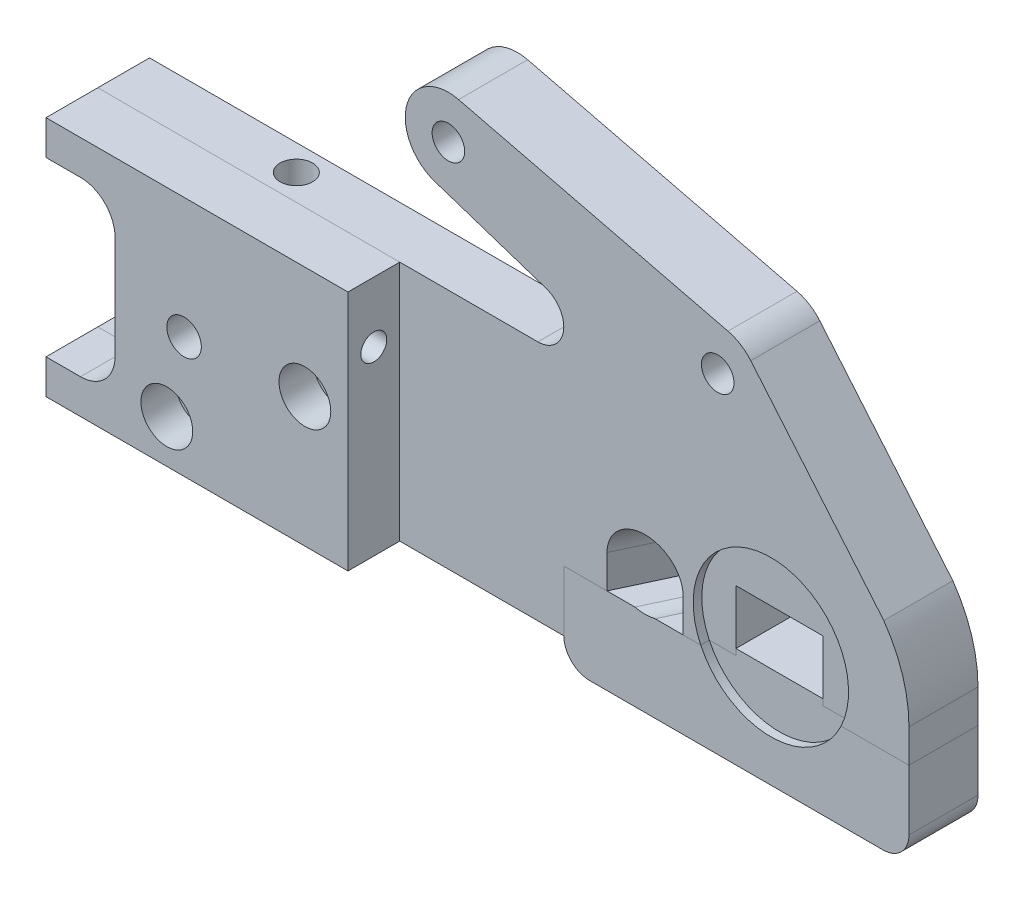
ISO-10303-21;
HEADER;
FILE_DESCRIPTION(('STEP AP214'),'2;1');
FILE_NAME('part.step','',(''),(''),'','','');
FILE_SCHEMA(('AUTOMOTIVE_DESIGN { 1 0 10303 214 1 1 1 1 }'));
ENDSEC;
DATA;
#1=APPLICATION_CONTEXT('core data for automotive mechanical design processes');
#2=APPLICATION_PROTOCOL_DEFINITION('international standard','automotive_design',2000,#1);
#3=PRODUCT_CONTEXT('',#1,'mechanical');
#4=PRODUCT('Part','Part','',(#3));
#5=PRODUCT_RELATED_PRODUCT_CATEGORY('part','',(#4));
#6=PRODUCT_DEFINITION_FORMATION('','',#4);
#7=PRODUCT_DEFINITION_CONTEXT('part definition',#1,'design');
#8=PRODUCT_DEFINITION('design','',#6,#7);
#9=PRODUCT_DEFINITION_SHAPE('','',#8);
#10=(LENGTH_UNIT() NAMED_UNIT(*) SI_UNIT(.MILLI.,.METRE.));
#11=(NAMED_UNIT(*) PLANE_ANGLE_UNIT() SI_UNIT($,.RADIAN.));
#12=(NAMED_UNIT(*) SI_UNIT($,.STERADIAN.) SOLID_ANGLE_UNIT());
#13=UNCERTAINTY_MEASURE_WITH_UNIT(LENGTH_MEASURE(1.E-05),#10,'distance_accuracy_value','');
#14=(GEOMETRIC_REPRESENTATION_CONTEXT(3) GLOBAL_UNCERTAINTY_ASSIGNED_CONTEXT((#13)) GLOBAL_UNIT_ASSIGNED_CONTEXT((#10,
#11,#12)) REPRESENTATION_CONTEXT('',''));
#15=CARTESIAN_POINT('',(0.,0.,0.));
#16=DIRECTION('',(0.,0.,1.));
#17=DIRECTION('',(1.,0.,0.));
#18=AXIS2_PLACEMENT_3D('',#15,#16,#17);
#19=CARTESIAN_POINT('',(0.,0.,15.875));
#20=DIRECTION('',(0.,0.,1.));
#21=DIRECTION('',(1.,0.,0.));
#22=AXIS2_PLACEMENT_3D('',#19,#20,#21);
#23=PLANE('',#22);
#24=CARTESIAN_POINT('',(19.05,7.9248,15.875));
#25=DIRECTION('',(0.,0.,1.));
#26=DIRECTION('',(1.,0.,0.));
#27=AXIS2_PLACEMENT_3D('',#24,#25,#26);
#28=CIRCLE('',#27,4.7625);
#29=CARTESIAN_POINT('',(23.8125,7.9248,15.875));
#30=VERTEX_POINT('',#29);
#31=EDGE_CURVE('E326',#30,#30,#28,.F.);
#32=ORIENTED_EDGE('',*,*,#31,.T.);
#33=EDGE_LOOP('',(#32));
#34=FACE_BOUND('',#33,.T.);
#35=CARTESIAN_POINT('',(22.225,22.225,15.875));
#36=DIRECTION('',(0.,0.,1.));
#37=DIRECTION('',(1.,0.,0.));
#38=AXIS2_PLACEMENT_3D('',#35,#36,#37);
#39=CIRCLE('',#38,3.175);
#40=CARTESIAN_POINT('',(25.4,22.225,15.875));
#41=VERTEX_POINT('',#40);
#42=EDGE_CURVE('E174',#41,#41,#39,.T.);
#43=ORIENTED_EDGE('',*,*,#42,.F.);
#44=EDGE_LOOP('',(#43));
#45=FACE_BOUND('',#44,.T.);
#46=DIRECTION('',(-1.,0.,0.));
#47=VECTOR('',#46,1.);
#48=CARTESIAN_POINT('',(52.3748,44.45,15.875));
#49=LINE('',#48,#47);
#50=CARTESIAN_POINT('',(52.3748,44.45,15.875));
#51=VERTEX_POINT('',#50);
#52=CARTESIAN_POINT('',(-3.175,44.45,15.875));
#53=VERTEX_POINT('',#52);
#54=EDGE_CURVE('E131',#51,#53,#49,.T.);
#55=ORIENTED_EDGE('',*,*,#54,.T.);
#56=DIRECTION('',(0.,-1.,0.));
#57=VECTOR('',#56,1.);
#58=CARTESIAN_POINT('',(-3.175,44.45,15.875));
#59=LINE('',#58,#57);
#60=CARTESIAN_POINT('',(-3.175,38.1,15.875));
#61=VERTEX_POINT('',#60);
#62=EDGE_CURVE('E135',#53,#61,#59,.T.);
#63=ORIENTED_EDGE('',*,*,#62,.T.);
#64=DIRECTION('',(1.,0.,0.));
#65=VECTOR('',#64,1.);
#66=CARTESIAN_POINT('',(-3.175,38.1,15.875));
#67=LINE('',#66,#65);
#68=CARTESIAN_POINT('',(3.175,38.1,15.875));
#69=VERTEX_POINT('',#68);
#70=EDGE_CURVE('E156',#61,#69,#67,.T.);
#71=ORIENTED_EDGE('',*,*,#70,.T.);
#72=CARTESIAN_POINT('',(3.175,31.75,15.875));
#73=DIRECTION('',(0.,0.,1.));
#74=DIRECTION('',(1.,0.,0.));
#75=AXIS2_PLACEMENT_3D('',#72,#73,#74);
#76=CIRCLE('',#75,6.35);
#77=CARTESIAN_POINT('',(9.525,31.75,15.875));
#78=VERTEX_POINT('',#77);
#79=EDGE_CURVE('E12',#69,#78,#76,.F.);
#80=ORIENTED_EDGE('',*,*,#79,.T.);
#81=DIRECTION('',(0.,-1.,0.));
#82=VECTOR('',#81,1.);
#83=CARTESIAN_POINT('',(9.525,38.1,15.875));
#84=LINE('',#83,#82);
#85=CARTESIAN_POINT('',(9.52500000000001,12.7,15.875));
#86=VERTEX_POINT('',#85);
#87=EDGE_CURVE('E158',#78,#86,#84,.T.);
#88=ORIENTED_EDGE('',*,*,#87,.T.);
#89=CARTESIAN_POINT('',(3.17500000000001,12.7,15.875));
#90=DIRECTION('',(0.,0.,1.));
#91=DIRECTION('',(1.,0.,0.));
#92=AXIS2_PLACEMENT_3D('',#89,#90,#91);
#93=CIRCLE('',#92,6.35);
#94=CARTESIAN_POINT('',(3.17500000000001,6.35,15.875));
#95=VERTEX_POINT('',#94);
#96=EDGE_CURVE('E221',#86,#95,#93,.F.);
#97=ORIENTED_EDGE('',*,*,#96,.T.);
#98=DIRECTION('',(-1.,0.,0.));
#99=VECTOR('',#98,1.);
#100=CARTESIAN_POINT('',(9.52500000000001,6.35,15.875));
#101=LINE('',#100,#99);
#102=CARTESIAN_POINT('',(-3.17499999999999,6.35,15.875));
#103=VERTEX_POINT('',#102);
#104=EDGE_CURVE('E164',#95,#103,#101,.T.);
#105=ORIENTED_EDGE('',*,*,#104,.T.);
#106=DIRECTION('',(0.,-1.,0.));
#107=VECTOR('',#106,1.);
#108=CARTESIAN_POINT('',(-3.17499999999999,6.35,15.875));
#109=LINE('',#108,#107);
#110=CARTESIAN_POINT('',(-3.17499999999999,0.,15.875));
#111=VERTEX_POINT('',#110);
#112=EDGE_CURVE('E166',#103,#111,#109,.T.);
#113=ORIENTED_EDGE('',*,*,#112,.T.);
#114=DIRECTION('',(1.,0.,0.));
#115=VECTOR('',#114,1.);
#116=CARTESIAN_POINT('',(-3.17499999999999,0.,15.875));
#117=LINE('',#116,#115);
#118=CARTESIAN_POINT('',(52.3748,0.,15.875));
#119=VERTEX_POINT('',#118);
#120=EDGE_CURVE('E168',#111,#119,#117,.T.);
#121=ORIENTED_EDGE('',*,*,#120,.T.);
#122=DIRECTION('',(0.,1.,0.));
#123=VECTOR('',#122,1.);
#124=CARTESIAN_POINT('',(52.3748,44.45,15.875));
#125=LINE('',#124,#123);
#126=EDGE_CURVE('E138',#119,#51,#125,.T.);
#127=ORIENTED_EDGE('',*,*,#126,.T.);
#128=EDGE_LOOP('',(#55,#63,#71,#80,#88,#97,#105,#113,#121,#127));
#129=FACE_BOUND('',#128,.T.);
#130=CARTESIAN_POINT('',(44.45,23.8252,15.875));
#131=DIRECTION('',(0.,0.,1.));
#132=DIRECTION('',(1.,0.,0.));
#133=AXIS2_PLACEMENT_3D('',#130,#131,#132);
#134=CIRCLE('',#133,4.7625);
#135=CARTESIAN_POINT('',(49.2125,23.8252,15.875));
#136=VERTEX_POINT('',#135);
#137=EDGE_CURVE('E51',#136,#136,#134,.F.);
#138=ORIENTED_EDGE('',*,*,#137,.T.);
#139=EDGE_LOOP('',(#138));
#140=FACE_BOUND('',#139,.T.);
#141=ADVANCED_FACE('F46',(#34,#45,#129,#140),#23,.T.);
#142=CARTESIAN_POINT('',(44.45,23.8252,22.86));
#143=DIRECTION('',(0.,0.,-1.));
#144=DIRECTION('',(-1.,0.,0.));
#145=AXIS2_PLACEMENT_3D('',#142,#143,#144);
#146=CYLINDRICAL_SURFACE('',#145,3.175);
#147=CARTESIAN_POINT('',(44.45,23.8252,6.35));
#148=DIRECTION('',(0.,0.,1.));
#149=DIRECTION('',(1.,0.,0.));
#150=AXIS2_PLACEMENT_3D('',#147,#148,#149);
#151=CIRCLE('',#150,3.175);
#152=CARTESIAN_POINT('',(47.625,23.8252,6.35));
#153=VERTEX_POINT('',#152);
#154=EDGE_CURVE('E329',#153,#153,#151,.F.);
#155=ORIENTED_EDGE('',*,*,#154,.T.);
#156=EDGE_LOOP('',(#155));
#157=FACE_BOUND('',#156,.T.);
#158=CARTESIAN_POINT('',(44.45,23.8252,9.525));
#159=DIRECTION('',(0.,0.,1.));
#160=DIRECTION('',(1.,0.,0.));
#161=AXIS2_PLACEMENT_3D('',#158,#159,#160);
#162=CIRCLE('',#161,3.175);
#163=CARTESIAN_POINT('',(47.625,23.8252,9.525));
#164=VERTEX_POINT('',#163);
#165=EDGE_CURVE('E318',#164,#164,#162,.T.);
#166=ORIENTED_EDGE('',*,*,#165,.T.);
#167=EDGE_LOOP('',(#166));
#168=FACE_BOUND('',#167,.T.);
#169=ADVANCED_FACE('F237',(#157,#168),#146,.F.);
#170=CARTESIAN_POINT('',(19.05,7.9248,22.86));
#171=DIRECTION('',(0.,0.,-1.));
#172=DIRECTION('',(-1.,0.,0.));
#173=AXIS2_PLACEMENT_3D('',#170,#171,#172);
#174=CYLINDRICAL_SURFACE('',#173,3.175);
#175=CARTESIAN_POINT('',(19.05,7.9248,6.35));
#176=DIRECTION('',(0.,0.,1.));
#177=DIRECTION('',(1.,0.,0.));
#178=AXIS2_PLACEMENT_3D('',#175,#176,#177);
#179=CIRCLE('',#178,3.175);
#180=CARTESIAN_POINT('',(22.225,7.9248,6.35));
#181=VERTEX_POINT('',#180);
#182=EDGE_CURVE('E208',#181,#181,#179,.F.);
#183=ORIENTED_EDGE('',*,*,#182,.T.);
#184=EDGE_LOOP('',(#183));
#185=FACE_BOUND('',#184,.T.);
#186=CARTESIAN_POINT('',(19.05,7.9248,9.525));
#187=DIRECTION('',(0.,0.,1.));
#188=DIRECTION('',(1.,0.,0.));
#189=AXIS2_PLACEMENT_3D('',#186,#187,#188);
#190=CIRCLE('',#189,3.175);
#191=CARTESIAN_POINT('',(22.225,7.9248,9.525));
#192=VERTEX_POINT('',#191);
#193=EDGE_CURVE('E315',#192,#192,#190,.T.);
#194=ORIENTED_EDGE('',*,*,#193,.T.);
#195=EDGE_LOOP('',(#194));
#196=FACE_BOUND('',#195,.T.);
#197=ADVANCED_FACE('F249',(#185,#196),#174,.F.);
#198=CARTESIAN_POINT('',(0.,0.,6.35));
#199=DIRECTION('',(0.,0.,1.));
#200=DIRECTION('',(1.,0.,0.));
#201=AXIS2_PLACEMENT_3D('',#198,#199,#200);
#202=PLANE('',#201);
#203=ORIENTED_EDGE('',*,*,#154,.F.);
#204=EDGE_LOOP('',(#203));
#205=FACE_BOUND('',#204,.T.);
#206=CARTESIAN_POINT('',(22.225,22.225,6.35));
#207=DIRECTION('',(0.,0.,1.));
#208=DIRECTION('',(1.,0.,0.));
#209=AXIS2_PLACEMENT_3D('',#206,#207,#208);
#210=CIRCLE('',#209,3.175);
#211=CARTESIAN_POINT('',(25.4,22.225,6.35));
#212=VERTEX_POINT('',#211);
#213=EDGE_CURVE('E201',#212,#212,#210,.T.);
#214=ORIENTED_EDGE('',*,*,#213,.T.);
#215=EDGE_LOOP('',(#214));
#216=FACE_BOUND('',#215,.T.);
#217=DIRECTION('',(-1.,0.,0.));
#218=VECTOR('',#217,1.);
#219=CARTESIAN_POINT('',(0.,44.45,6.35));
#220=LINE('',#219,#218);
#221=CARTESIAN_POINT('',(52.3748,44.45,6.35));
#222=VERTEX_POINT('',#221);
#223=CARTESIAN_POINT('',(-3.175,44.45,6.35));
#224=VERTEX_POINT('',#223);
#225=EDGE_CURVE('E147',#222,#224,#220,.T.);
#226=ORIENTED_EDGE('',*,*,#225,.F.);
#227=DIRECTION('',(0.,1.,0.));
#228=VECTOR('',#227,1.);
#229=CARTESIAN_POINT('',(52.3748,44.45,6.35));
#230=LINE('',#229,#228);
#231=CARTESIAN_POINT('',(52.3748,0.,6.35));
#232=VERTEX_POINT('',#231);
#233=EDGE_CURVE('E142',#232,#222,#230,.T.);
#234=ORIENTED_EDGE('',*,*,#233,.F.);
#235=DIRECTION('',(1.,0.,0.));
#236=VECTOR('',#235,1.);
#237=CARTESIAN_POINT('',(0.,0.,6.35));
#238=LINE('',#237,#236);
#239=CARTESIAN_POINT('',(-3.17499999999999,0.,6.35));
#240=VERTEX_POINT('',#239);
#241=EDGE_CURVE('E186',#240,#232,#238,.T.);
#242=ORIENTED_EDGE('',*,*,#241,.F.);
#243=DIRECTION('',(0.,-1.,0.));
#244=VECTOR('',#243,1.);
#245=CARTESIAN_POINT('',(-3.17499999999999,6.35,6.35));
#246=LINE('',#245,#244);
#247=CARTESIAN_POINT('',(-3.17499999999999,6.35,6.35));
#248=VERTEX_POINT('',#247);
#249=EDGE_CURVE('E183',#248,#240,#246,.T.);
#250=ORIENTED_EDGE('',*,*,#249,.F.);
#251=DIRECTION('',(-1.,0.,0.));
#252=VECTOR('',#251,1.);
#253=CARTESIAN_POINT('',(0.,6.35,6.35));
#254=LINE('',#253,#252);
#255=CARTESIAN_POINT('',(3.17500000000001,6.35,6.35));
#256=VERTEX_POINT('',#255);
#257=EDGE_CURVE('E181',#256,#248,#254,.T.);
#258=ORIENTED_EDGE('',*,*,#257,.F.);
#259=CARTESIAN_POINT('',(3.17500000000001,12.7,6.35));
#260=DIRECTION('',(0.,0.,1.));
#261=DIRECTION('',(1.,0.,0.));
#262=AXIS2_PLACEMENT_3D('',#259,#260,#261);
#263=CIRCLE('',#262,6.35);
#264=CARTESIAN_POINT('',(9.52500000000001,12.7,6.35));
#265=VERTEX_POINT('',#264);
#266=EDGE_CURVE('E219',#256,#265,#263,.T.);
#267=ORIENTED_EDGE('',*,*,#266,.T.);
#268=DIRECTION('',(0.,-1.,0.));
#269=VECTOR('',#268,1.);
#270=CARTESIAN_POINT('',(9.525,38.1,6.35));
#271=LINE('',#270,#269);
#272=CARTESIAN_POINT('',(9.525,31.75,6.35));
#273=VERTEX_POINT('',#272);
#274=EDGE_CURVE('E178',#273,#265,#271,.T.);
#275=ORIENTED_EDGE('',*,*,#274,.F.);
#276=CARTESIAN_POINT('',(3.175,31.75,6.35));
#277=DIRECTION('',(0.,0.,1.));
#278=DIRECTION('',(1.,0.,0.));
#279=AXIS2_PLACEMENT_3D('',#276,#277,#278);
#280=CIRCLE('',#279,6.35);
#281=CARTESIAN_POINT('',(3.175,38.1,6.35));
#282=VERTEX_POINT('',#281);
#283=EDGE_CURVE('E56',#273,#282,#280,.T.);
#284=ORIENTED_EDGE('',*,*,#283,.T.);
#285=DIRECTION('',(1.,0.,0.));
#286=VECTOR('',#285,1.);
#287=CARTESIAN_POINT('',(9.525,38.1,6.35));
#288=LINE('',#287,#286);
#289=CARTESIAN_POINT('',(-3.175,38.1,6.35));
#290=VERTEX_POINT('',#289);
#291=EDGE_CURVE('E176',#290,#282,#288,.T.);
#292=ORIENTED_EDGE('',*,*,#291,.F.);
#293=DIRECTION('',(0.,-1.,0.));
#294=VECTOR('',#293,1.);
#295=CARTESIAN_POINT('',(-3.175,44.45,6.35));
#296=LINE('',#295,#294);
#297=EDGE_CURVE('E173',#224,#290,#296,.T.);
#298=ORIENTED_EDGE('',*,*,#297,.F.);
#299=EDGE_LOOP('',(#226,#234,#242,#250,#258,#267,#275,#284,#292,#298));
#300=FACE_BOUND('',#299,.T.);
#301=ORIENTED_EDGE('',*,*,#182,.F.);
#302=EDGE_LOOP('',(#301));
#303=FACE_BOUND('',#302,.T.);
#304=ADVANCED_FACE('F246',(#205,#216,#300,#303),#202,.F.);
#305=CARTESIAN_POINT('',(0.,44.45,15.875));
#306=DIRECTION('',(0.,-1.,0.));
#307=DIRECTION('',(0.,0.,-1.));
#308=AXIS2_PLACEMENT_3D('',#305,#306,#307);
#309=PLANE('',#308);
#310=ORIENTED_EDGE('',*,*,#225,.T.);
#311=DIRECTION('',(0.,0.,-1.));
#312=VECTOR('',#311,1.);
#313=CARTESIAN_POINT('',(-3.175,44.45,15.875));
#314=LINE('',#313,#312);
#315=EDGE_CURVE('E145',#53,#224,#314,.T.);
#316=ORIENTED_EDGE('',*,*,#315,.F.);
#317=ORIENTED_EDGE('',*,*,#54,.F.);
#318=DIRECTION('',(0.,0.,-1.));
#319=VECTOR('',#318,1.);
#320=CARTESIAN_POINT('',(52.3748,44.45,15.875));
#321=LINE('',#320,#319);
#322=EDGE_CURVE('E171',#51,#222,#321,.T.);
#323=ORIENTED_EDGE('',*,*,#322,.T.);
#324=EDGE_LOOP('',(#310,#316,#317,#323));
#325=FACE_BOUND('',#324,.T.);
#326=ADVANCED_FACE('F146',(#325),#309,.F.);
#327=CARTESIAN_POINT('',(-3.175,44.45,15.875));
#328=DIRECTION('',(1.,0.,0.));
#329=DIRECTION('',(0.,1.,0.));
#330=AXIS2_PLACEMENT_3D('',#327,#328,#329);
#331=PLANE('',#330);
#332=ORIENTED_EDGE('',*,*,#297,.T.);
#333=DIRECTION('',(0.,0.,-1.));
#334=VECTOR('',#333,1.);
#335=CARTESIAN_POINT('',(-3.175,38.1,15.875));
#336=LINE('',#335,#334);
#337=EDGE_CURVE('E152',#61,#290,#336,.T.);
#338=ORIENTED_EDGE('',*,*,#337,.F.);
#339=ORIENTED_EDGE('',*,*,#62,.F.);
#340=ORIENTED_EDGE('',*,*,#315,.T.);
#341=EDGE_LOOP('',(#332,#338,#339,#340));
#342=FACE_BOUND('',#341,.T.);
#343=ADVANCED_FACE('F154',(#342),#331,.F.);
#344=CARTESIAN_POINT('',(9.525,38.1,15.875));
#345=DIRECTION('',(0.,1.,0.));
#346=DIRECTION('',(0.,0.,1.));
#347=AXIS2_PLACEMENT_3D('',#344,#345,#346);
#348=PLANE('',#347);
#349=ORIENTED_EDGE('',*,*,#291,.T.);
#350=DIRECTION('',(0.,0.,-1.));
#351=VECTOR('',#350,1.);
#352=CARTESIAN_POINT('',(3.175,38.1,15.875));
#353=LINE('',#352,#351);
#354=EDGE_CURVE('E64',#282,#69,#353,.F.);
#355=ORIENTED_EDGE('',*,*,#354,.T.);
#356=ORIENTED_EDGE('',*,*,#70,.F.);
#357=ORIENTED_EDGE('',*,*,#337,.T.);
#358=EDGE_LOOP('',(#349,#355,#356,#357));
#359=FACE_BOUND('',#358,.T.);
#360=ADVANCED_FACE('F269',(#359),#348,.F.);
#361=CARTESIAN_POINT('',(9.525,38.1,15.875));
#362=DIRECTION('',(1.,0.,0.));
#363=DIRECTION('',(0.,1.,0.));
#364=AXIS2_PLACEMENT_3D('',#361,#362,#363);
#365=PLANE('',#364);
#366=ORIENTED_EDGE('',*,*,#274,.T.);
#367=DIRECTION('',(0.,0.,-1.));
#368=VECTOR('',#367,1.);
#369=CARTESIAN_POINT('',(9.52500000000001,12.7,15.875));
#370=LINE('',#369,#368);
#371=EDGE_CURVE('E216',#265,#86,#370,.F.);
#372=ORIENTED_EDGE('',*,*,#371,.T.);
#373=ORIENTED_EDGE('',*,*,#87,.F.);
#374=DIRECTION('',(0.,0.,-1.));
#375=VECTOR('',#374,1.);
#376=CARTESIAN_POINT('',(9.525,31.75,6.35));
#377=LINE('',#376,#375);
#378=CARTESIAN_POINT('',(9.525,31.75,12.9198138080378));
#379=VERTEX_POINT('',#378);
#380=EDGE_CURVE('E213',#78,#379,#377,.T.);
#381=ORIENTED_EDGE('',*,*,#380,.T.);
#382=CARTESIAN_POINT('',(9.525,33.3248,11.1252));
#383=DIRECTION('',(1.,0.,0.));
#384=DIRECTION('',(0.,1.,0.));
#385=AXIS2_PLACEMENT_3D('',#382,#383,#384);
#386=CIRCLE('',#385,2.3876);
#387=CARTESIAN_POINT('',(9.525,31.75,9.33058619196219));
#388=VERTEX_POINT('',#387);
#389=EDGE_CURVE('E204',#379,#388,#386,.T.);
#390=ORIENTED_EDGE('',*,*,#389,.T.);
#391=DIRECTION('',(0.,0.,-1.));
#392=VECTOR('',#391,1.);
#393=CARTESIAN_POINT('',(9.525,31.75,6.35));
#394=LINE('',#393,#392);
#395=EDGE_CURVE('E211',#388,#273,#394,.T.);
#396=ORIENTED_EDGE('',*,*,#395,.T.);
#397=EDGE_LOOP('',(#366,#372,#373,#381,#390,#396));
#398=FACE_BOUND('',#397,.T.);
#399=ADVANCED_FACE('F265',(#398),#365,.F.);
#400=CARTESIAN_POINT('',(0.,6.35,15.875));
#401=DIRECTION('',(0.,-1.,0.));
#402=DIRECTION('',(0.,0.,-1.));
#403=AXIS2_PLACEMENT_3D('',#400,#401,#402);
#404=PLANE('',#403);
#405=ORIENTED_EDGE('',*,*,#104,.F.);
#406=DIRECTION('',(0.,0.,-1.));
#407=VECTOR('',#406,1.);
#408=CARTESIAN_POINT('',(3.17500000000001,6.35,6.35));
#409=LINE('',#408,#407);
#410=EDGE_CURVE('E151',#95,#256,#409,.T.);
#411=ORIENTED_EDGE('',*,*,#410,.T.);
#412=ORIENTED_EDGE('',*,*,#257,.T.);
#413=DIRECTION('',(0.,0.,-1.));
#414=VECTOR('',#413,1.);
#415=CARTESIAN_POINT('',(-3.17499999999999,6.35,15.875));
#416=LINE('',#415,#414);
#417=EDGE_CURVE('E197',#103,#248,#416,.T.);
#418=ORIENTED_EDGE('',*,*,#417,.F.);
#419=EDGE_LOOP('',(#405,#411,#412,#418));
#420=FACE_BOUND('',#419,.T.);
#421=ADVANCED_FACE('F261',(#420),#404,.F.);
#422=CARTESIAN_POINT('',(-3.17499999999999,6.35,15.875));
#423=DIRECTION('',(1.,0.,0.));
#424=DIRECTION('',(0.,1.,0.));
#425=AXIS2_PLACEMENT_3D('',#422,#423,#424);
#426=PLANE('',#425);
#427=ORIENTED_EDGE('',*,*,#249,.T.);
#428=DIRECTION('',(0.,0.,-1.));
#429=VECTOR('',#428,1.);
#430=CARTESIAN_POINT('',(-3.17499999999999,0.,15.875));
#431=LINE('',#430,#429);
#432=EDGE_CURVE('E194',#111,#240,#431,.T.);
#433=ORIENTED_EDGE('',*,*,#432,.F.);
#434=ORIENTED_EDGE('',*,*,#112,.F.);
#435=ORIENTED_EDGE('',*,*,#417,.T.);
#436=EDGE_LOOP('',(#427,#433,#434,#435));
#437=FACE_BOUND('',#436,.T.);
#438=ADVANCED_FACE('F257',(#437),#426,.F.);
#439=CARTESIAN_POINT('',(0.,0.,15.875));
#440=DIRECTION('',(0.,1.,0.));
#441=DIRECTION('',(0.,0.,1.));
#442=AXIS2_PLACEMENT_3D('',#439,#440,#441);
#443=PLANE('',#442);
#444=ORIENTED_EDGE('',*,*,#241,.T.);
#445=DIRECTION('',(0.,0.,-1.));
#446=VECTOR('',#445,1.);
#447=CARTESIAN_POINT('',(52.3748,0.,15.875));
#448=LINE('',#447,#446);
#449=EDGE_CURVE('E191',#119,#232,#448,.T.);
#450=ORIENTED_EDGE('',*,*,#449,.F.);
#451=ORIENTED_EDGE('',*,*,#120,.F.);
#452=ORIENTED_EDGE('',*,*,#432,.T.);
#453=EDGE_LOOP('',(#444,#450,#451,#452));
#454=FACE_BOUND('',#453,.T.);
#455=ADVANCED_FACE('F253',(#454),#443,.F.);
#456=CARTESIAN_POINT('',(52.3748,44.45,15.875));
#457=DIRECTION('',(-1.,0.,0.));
#458=DIRECTION('',(0.,-1.,0.));
#459=AXIS2_PLACEMENT_3D('',#456,#457,#458);
#460=PLANE('',#459);
#461=CARTESIAN_POINT('',(52.3748,33.3248,11.1252));
#462=DIRECTION('',(-1.,0.,0.));
#463=DIRECTION('',(0.,-1.,0.));
#464=AXIS2_PLACEMENT_3D('',#461,#462,#463);
#465=CIRCLE('',#464,2.3876);
#466=CARTESIAN_POINT('',(52.3748,30.9372,11.1252));
#467=VERTEX_POINT('',#466);
#468=EDGE_CURVE('E205',#467,#467,#465,.T.);
#469=ORIENTED_EDGE('',*,*,#468,.T.);
#470=EDGE_LOOP('',(#469));
#471=FACE_BOUND('',#470,.T.);
#472=ORIENTED_EDGE('',*,*,#233,.T.);
#473=ORIENTED_EDGE('',*,*,#322,.F.);
#474=ORIENTED_EDGE('',*,*,#126,.F.);
#475=ORIENTED_EDGE('',*,*,#449,.T.);
#476=EDGE_LOOP('',(#472,#473,#474,#475));
#477=FACE_BOUND('',#476,.T.);
#478=ADVANCED_FACE('F241',(#471,#477),#460,.F.);
#479=CARTESIAN_POINT('',(22.225,22.225,-25.4));
#480=DIRECTION('',(0.,0.,1.));
#481=DIRECTION('',(1.,0.,0.));
#482=AXIS2_PLACEMENT_3D('',#479,#480,#481);
#483=CYLINDRICAL_SURFACE('',#482,3.175);
#484=ORIENTED_EDGE('',*,*,#42,.T.);
#485=EDGE_LOOP('',(#484));
#486=FACE_BOUND('',#485,.T.);
#487=ORIENTED_EDGE('',*,*,#213,.F.);
#488=EDGE_LOOP('',(#487));
#489=FACE_BOUND('',#488,.T.);
#490=ADVANCED_FACE('F235',(#486,#489),#483,.F.);
#491=CARTESIAN_POINT('',(-20.32,33.3248,11.1252));
#492=DIRECTION('',(1.,0.,0.));
#493=DIRECTION('',(0.,0.,-1.));
#494=AXIS2_PLACEMENT_3D('',#491,#492,#493);
#495=CYLINDRICAL_SURFACE('',#494,2.3876);
#496=ORIENTED_EDGE('',*,*,#468,.F.);
#497=EDGE_LOOP('',(#496));
#498=FACE_BOUND('',#497,.T.);
#499=ORIENTED_EDGE('',*,*,#389,.F.);
#500=CARTESIAN_POINT('',(9.525,31.75,12.9198138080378));
#501=CARTESIAN_POINT('',(9.52500319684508,31.7983381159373,12.9622408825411));
#502=CARTESIAN_POINT('',(9.52444814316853,31.8484010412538,13.002704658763));
#503=CARTESIAN_POINT('',(9.52200780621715,31.9516095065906,13.0794540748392));
#504=CARTESIAN_POINT('',(9.52012239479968,32.0047553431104,13.115739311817));
#505=CARTESIAN_POINT('',(9.51480989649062,32.1137046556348,13.1838415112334));
#506=CARTESIAN_POINT('',(9.51138418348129,32.1695057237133,13.2156624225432));
#507=CARTESIAN_POINT('',(9.50281892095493,32.2833634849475,13.2746560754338));
#508=CARTESIAN_POINT('',(9.49767948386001,32.3414200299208,13.3018291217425));
#509=CARTESIAN_POINT('',(9.47943854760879,32.5184861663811,13.37616507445));
#510=CARTESIAN_POINT('',(9.46351640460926,32.6403451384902,13.416115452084));
#511=CARTESIAN_POINT('',(9.42354728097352,32.8874699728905,13.4758504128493));
#512=CARTESIAN_POINT('',(9.3995043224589,33.0127341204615,13.4956449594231));
#513=CARTESIAN_POINT('',(9.34362513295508,33.262215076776,13.5152353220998));
#514=CARTESIAN_POINT('',(9.31183995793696,33.386433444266,13.5151587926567));
#515=CARTESIAN_POINT('',(9.24122783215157,33.6313977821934,13.4962222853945));
#516=CARTESIAN_POINT('',(9.20239701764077,33.7521418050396,13.4773519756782));
#517=CARTESIAN_POINT('',(9.11658325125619,33.9944527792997,13.4205408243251));
#518=CARTESIAN_POINT('',(9.06925406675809,34.1156463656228,13.3815384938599));
#519=CARTESIAN_POINT('',(8.97023045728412,34.3488225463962,13.2857366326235));
#520=CARTESIAN_POINT('',(8.91853491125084,34.4608027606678,13.2289325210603));
#521=CARTESIAN_POINT('',(8.80736375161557,34.6853544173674,13.0920840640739));
#522=CARTESIAN_POINT('',(8.74765060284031,34.7966854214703,13.0101931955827));
#523=CARTESIAN_POINT('',(8.62915649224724,35.0040705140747,12.8280684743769));
#524=CARTESIAN_POINT('',(8.57037695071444,35.1001030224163,12.7278091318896));
#525=CARTESIAN_POINT('',(8.45496116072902,35.2793727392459,12.5043055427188));
#526=CARTESIAN_POINT('',(8.3986213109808,35.361613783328,12.3800994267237));
#527=CARTESIAN_POINT('',(8.29811763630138,35.5028273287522,12.114771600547));
#528=CARTESIAN_POINT('',(8.25391957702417,35.5618654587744,11.9736990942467));
#529=CARTESIAN_POINT('',(8.19542257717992,35.6383681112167,11.7246515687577));
#530=CARTESIAN_POINT('',(8.17609858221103,35.6630544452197,11.620057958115));
#531=CARTESIAN_POINT('',(8.1484464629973,35.6981446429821,11.4071104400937));
#532=CARTESIAN_POINT('',(8.14010656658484,35.7085637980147,11.2987606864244));
#533=CARTESIAN_POINT('',(8.13538540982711,35.714479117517,11.0811685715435));
#534=CARTESIAN_POINT('',(8.13902841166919,35.7099450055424,10.9719248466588));
#535=CARTESIAN_POINT('',(8.157882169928,35.6861913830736,10.7560506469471));
#536=CARTESIAN_POINT('',(8.17309936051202,35.6669637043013,10.6494216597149));
#537=CARTESIAN_POINT('',(8.2130854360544,35.6153878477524,10.4433294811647));
#538=CARTESIAN_POINT('',(8.23768802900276,35.5832676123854,10.3437754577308));
#539=CARTESIAN_POINT('',(8.29431876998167,35.5073013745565,10.1515377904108));
#540=CARTESIAN_POINT('',(8.3263495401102,35.4634512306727,10.0588565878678));
#541=CARTESIAN_POINT('',(8.40122458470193,35.3574806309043,9.8671534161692));
#542=CARTESIAN_POINT('',(8.44497893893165,35.293560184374,9.76948574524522));
#543=CARTESIAN_POINT('',(8.53658597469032,35.1533691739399,9.58560342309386));
#544=CARTESIAN_POINT('',(8.58444173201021,35.0770893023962,9.49939749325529));
#545=CARTESIAN_POINT('',(8.69125442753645,34.8974378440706,9.32348226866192));
#546=CARTESIAN_POINT('',(8.75054993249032,34.7916862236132,9.23639340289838));
#547=CARTESIAN_POINT('',(8.86772691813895,34.5662943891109,9.08116926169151));
#548=CARTESIAN_POINT('',(8.9256075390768,34.4466459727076,9.01304526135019));
#549=CARTESIAN_POINT('',(9.0402224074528,34.1878026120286,8.89420131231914));
#550=CARTESIAN_POINT('',(9.09666490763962,34.047856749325,8.84481662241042));
#551=CARTESIAN_POINT('',(9.20102441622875,33.7582691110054,8.7725516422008));
#552=CARTESIAN_POINT('',(9.24894829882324,33.6086352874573,8.74964989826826));
#553=CARTESIAN_POINT('',(9.33005521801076,33.31797521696,8.73357301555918));
#554=CARTESIAN_POINT('',(9.3641619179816,33.1773435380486,8.73796907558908));
#555=CARTESIAN_POINT('',(9.42218678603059,32.8969973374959,8.77200773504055));
#556=CARTESIAN_POINT('',(9.44610861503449,32.7572825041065,8.80164125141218));
#557=CARTESIAN_POINT('',(9.48208931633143,32.4974540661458,8.88180421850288));
#558=CARTESIAN_POINT('',(9.49507094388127,32.376750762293,8.93003851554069));
#559=CARTESIAN_POINT('',(9.51380532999,32.1444502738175,9.04573249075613));
#560=CARTESIAN_POINT('',(9.51956890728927,32.0328396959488,9.11316320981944));
#561=CARTESIAN_POINT('',(9.52337751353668,31.8968314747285,9.211307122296));
#562=CARTESIAN_POINT('',(9.523998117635,31.8666467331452,9.23420470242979));
#563=CARTESIAN_POINT('',(9.52480853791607,31.8074496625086,9.28137088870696));
#564=CARTESIAN_POINT('',(9.52499911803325,31.7784353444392,9.30563698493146));
#565=CARTESIAN_POINT('',(9.525,31.75,9.33058619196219));
#566=B_SPLINE_CURVE_WITH_KNOTS('',3,(#500,#501,#502,#503,#504,#505,#506,#507,#508,#509,#510,
#511,#512,#513,#514,#515,#516,#517,#518,#519,#520,#521,#522,#523,#524,#525,#526,#527,#528,#529,
#530,#531,#532,#533,#534,#535,#536,#537,#538,#539,#540,#541,#542,#543,#544,#545,#546,#547,#548,
#549,#550,#551,#552,#553,#554,#555,#556,#557,#558,#559,#560,#561,#562,#563,#564,#565),
.UNSPECIFIED.,.F.,.F.,(4,2,2,2,2,2,2,2,2,2,2,2,2,2,2,2,2,2,2,2,2,2,2,2,2,2,2,2,2,2,2,2,4),(0.,
0.192895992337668,0.385810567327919,0.578553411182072,0.771283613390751,1.15690851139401,
1.54234269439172,1.92530085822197,2.30846966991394,2.71429128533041,3.120217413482,
3.56995179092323,4.02031505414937,4.49548539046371,4.96930188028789,5.29550124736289,
5.621350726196,5.9478603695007,6.2745516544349,6.59570491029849,6.91697170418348,
7.28958854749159,7.66248731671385,8.10841760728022,8.55461245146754,9.02837360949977,
9.50175070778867,9.93365089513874,10.3653957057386,10.7554326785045,11.1448843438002,
11.2585311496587,11.3719759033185),.UNSPECIFIED.);
#567=EDGE_CURVE('E223',#379,#388,#566,.T.);
#568=ORIENTED_EDGE('',*,*,#567,.T.);
#569=EDGE_LOOP('',(#499,#568));
#570=FACE_BOUND('',#569,.T.);
#571=ADVANCED_FACE('F229',(#498,#570),#495,.F.);
#572=CARTESIAN_POINT('',(3.17500000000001,12.7,15.875));
#573=DIRECTION('',(0.,0.,1.));
#574=DIRECTION('',(1.,0.,0.));
#575=AXIS2_PLACEMENT_3D('',#572,#573,#574);
#576=CYLINDRICAL_SURFACE('',#575,6.35);
#577=ORIENTED_EDGE('',*,*,#96,.F.);
#578=ORIENTED_EDGE('',*,*,#371,.F.);
#579=ORIENTED_EDGE('',*,*,#266,.F.);
#580=ORIENTED_EDGE('',*,*,#410,.F.);
#581=EDGE_LOOP('',(#577,#578,#579,#580));
#582=FACE_BOUND('',#581,.T.);
#583=ADVANCED_FACE('F234',(#582),#576,.F.);
#584=CARTESIAN_POINT('',(3.175,31.75,15.875));
#585=DIRECTION('',(0.,0.,1.));
#586=DIRECTION('',(1.,0.,0.));
#587=AXIS2_PLACEMENT_3D('',#584,#585,#586);
#588=CYLINDRICAL_SURFACE('',#587,6.35);
#589=ORIENTED_EDGE('',*,*,#79,.F.);
#590=ORIENTED_EDGE('',*,*,#354,.F.);
#591=ORIENTED_EDGE('',*,*,#283,.F.);
#592=ORIENTED_EDGE('',*,*,#395,.F.);
#593=ORIENTED_EDGE('',*,*,#567,.F.);
#594=ORIENTED_EDGE('',*,*,#380,.F.);
#595=EDGE_LOOP('',(#589,#590,#591,#592,#593,#594));
#596=FACE_BOUND('',#595,.T.);
#597=ADVANCED_FACE('F48',(#596),#588,.F.);
#598=CARTESIAN_POINT('',(19.05,7.9248,19.685));
#599=DIRECTION('',(0.,0.,-1.));
#600=DIRECTION('',(-1.,0.,0.));
#601=AXIS2_PLACEMENT_3D('',#598,#599,#600);
#602=CYLINDRICAL_SURFACE('',#601,4.7625);
#603=ORIENTED_EDGE('',*,*,#31,.F.);
#604=EDGE_LOOP('',(#603));
#605=FACE_BOUND('',#604,.T.);
#606=CARTESIAN_POINT('',(19.05,7.9248,9.525));
#607=DIRECTION('',(0.,0.,1.));
#608=DIRECTION('',(1.,0.,0.));
#609=AXIS2_PLACEMENT_3D('',#606,#607,#608);
#610=CIRCLE('',#609,4.7625);
#611=CARTESIAN_POINT('',(23.8125,7.9248,9.525));
#612=VERTEX_POINT('',#611);
#613=EDGE_CURVE('E306',#612,#612,#610,.T.);
#614=ORIENTED_EDGE('',*,*,#613,.F.);
#615=EDGE_LOOP('',(#614));
#616=FACE_BOUND('',#615,.T.);
#617=ADVANCED_FACE('F281',(#605,#616),#602,.F.);
#618=CARTESIAN_POINT('',(19.05,7.9248,9.525));
#619=DIRECTION('',(0.,0.,1.));
#620=DIRECTION('',(1.,0.,0.));
#621=AXIS2_PLACEMENT_3D('',#618,#619,#620);
#622=PLANE('',#621);
#623=ORIENTED_EDGE('',*,*,#193,.F.);
#624=EDGE_LOOP('',(#623));
#625=FACE_BOUND('',#624,.T.);
#626=ORIENTED_EDGE('',*,*,#613,.T.);
#627=EDGE_LOOP('',(#626));
#628=FACE_BOUND('',#627,.T.);
#629=ADVANCED_FACE('F348',(#625,#628),#622,.T.);
#630=CARTESIAN_POINT('',(44.45,23.8252,19.685));
#631=DIRECTION('',(0.,0.,-1.));
#632=DIRECTION('',(-1.,0.,0.));
#633=AXIS2_PLACEMENT_3D('',#630,#631,#632);
#634=CYLINDRICAL_SURFACE('',#633,4.7625);
#635=ORIENTED_EDGE('',*,*,#137,.F.);
#636=EDGE_LOOP('',(#635));
#637=FACE_BOUND('',#636,.T.);
#638=CARTESIAN_POINT('',(44.45,23.8252,9.525));
#639=DIRECTION('',(0.,0.,1.));
#640=DIRECTION('',(1.,0.,0.));
#641=AXIS2_PLACEMENT_3D('',#638,#639,#640);
#642=CIRCLE('',#641,4.7625);
#643=CARTESIAN_POINT('',(49.2125,23.8252,9.525));
#644=VERTEX_POINT('',#643);
#645=EDGE_CURVE('E316',#644,#644,#642,.T.);
#646=ORIENTED_EDGE('',*,*,#645,.F.);
#647=EDGE_LOOP('',(#646));
#648=FACE_BOUND('',#647,.T.);
#649=ADVANCED_FACE('F352',(#637,#648),#634,.F.);
#650=CARTESIAN_POINT('',(44.45,23.8252,9.525));
#651=DIRECTION('',(0.,0.,1.));
#652=DIRECTION('',(1.,0.,0.));
#653=AXIS2_PLACEMENT_3D('',#650,#651,#652);
#654=PLANE('',#653);
#655=ORIENTED_EDGE('',*,*,#165,.F.);
#656=EDGE_LOOP('',(#655));
#657=FACE_BOUND('',#656,.T.);
#658=ORIENTED_EDGE('',*,*,#645,.T.);
#659=EDGE_LOOP('',(#658));
#660=FACE_BOUND('',#659,.T.);
#661=ADVANCED_FACE('F356',(#657,#660),#654,.T.);
#662=CLOSED_SHELL('',(#141,#169,#197,#304,#326,#343,#360,#399,#421,#438,#455,#478,#490,#571,
#583,#597,#617,#629,#649,#661));
#663=MANIFOLD_SOLID_BREP('B2',#662);
#664=CARTESIAN_POINT('',(82.55,11.1252,6.35));
#665=DIRECTION('',(0.,-1.,0.));
#666=DIRECTION('',(0.,0.,-1.));
#667=AXIS2_PLACEMENT_3D('',#664,#665,#666);
#668=PLANE('',#667);
#669=DIRECTION('',(-1.,0.,0.));
#670=VECTOR('',#669,1.);
#671=CARTESIAN_POINT('',(82.55,11.1252,-6.35));
#672=LINE('',#671,#670);
#673=CARTESIAN_POINT('',(101.569447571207,11.1252,-6.35));
#674=VERTEX_POINT('',#673);
#675=CARTESIAN_POINT('',(82.55,11.1252,-6.35));
#676=VERTEX_POINT('',#675);
#677=EDGE_CURVE('E708',#674,#676,#672,.T.);
#678=ORIENTED_EDGE('',*,*,#677,.T.);
#679=DIRECTION('',(0.,0.,-1.));
#680=VECTOR('',#679,1.);
#681=CARTESIAN_POINT('',(82.55,11.1252,6.35));
#682=LINE('',#681,#680);
#683=CARTESIAN_POINT('',(82.55,11.1252,6.35));
#684=VERTEX_POINT('',#683);
#685=EDGE_CURVE('E694',#684,#676,#682,.T.);
#686=ORIENTED_EDGE('',*,*,#685,.F.);
#687=DIRECTION('',(-1.,0.,0.));
#688=VECTOR('',#687,1.);
#689=CARTESIAN_POINT('',(82.55,11.1252,6.35));
#690=LINE('',#689,#688);
#691=CARTESIAN_POINT('',(95.6473403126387,11.1252,6.35));
#692=VERTEX_POINT('',#691);
#693=EDGE_CURVE('E634',#692,#684,#690,.T.);
#694=ORIENTED_EDGE('',*,*,#693,.F.);
#695=DIRECTION('',(0.4226182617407,0.,-0.90630778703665));
#696=VECTOR('',#695,1.);
#697=CARTESIAN_POINT('',(90.7372071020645,11.1252,16.8798146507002));
#698=LINE('',#697,#696);
#699=EDGE_CURVE('E642',#692,#674,#698,.T.);
#700=ORIENTED_EDGE('',*,*,#699,.T.);
#701=EDGE_LOOP('',(#678,#686,#694,#700));
#702=FACE_BOUND('',#701,.T.);
#703=CARTESIAN_POINT('',(88.9,11.1252,0.));
#704=DIRECTION('',(0.,-1.,0.));
#705=DIRECTION('',(0.,0.,-1.));
#706=AXIS2_PLACEMENT_3D('',#703,#704,#705);
#707=CIRCLE('',#706,3.175);
#708=CARTESIAN_POINT('',(88.9,11.1252,-3.175));
#709=VERTEX_POINT('',#708);
#710=EDGE_CURVE('E682',#709,#709,#707,.T.);
#711=ORIENTED_EDGE('',*,*,#710,.T.);
#712=EDGE_LOOP('',(#711));
#713=FACE_BOUND('',#712,.T.);
#714=ADVANCED_FACE('F507',(#702,#713),#668,.F.);
#715=CARTESIAN_POINT('',(112.649,11.1252,-6.35));
#716=VERTEX_POINT('',#715);
#717=CARTESIAN_POINT('',(105.295508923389,11.1252,-6.35));
#718=VERTEX_POINT('',#717);
#719=EDGE_CURVE('E647',#716,#718,#672,.T.);
#720=ORIENTED_EDGE('',*,*,#719,.T.);
#721=DIRECTION('',(0.4226182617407,0.,-0.90630778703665));
#722=VECTOR('',#721,1.);
#723=CARTESIAN_POINT('',(93.7977708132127,11.1252,18.3069789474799));
#724=LINE('',#723,#722);
#725=CARTESIAN_POINT('',(99.3734016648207,11.1252,6.35));
#726=VERTEX_POINT('',#725);
#727=EDGE_CURVE('E639',#726,#718,#724,.T.);
#728=ORIENTED_EDGE('',*,*,#727,.F.);
#729=CARTESIAN_POINT('',(107.740270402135,11.1252,6.35));
#730=VERTEX_POINT('',#729);
#731=EDGE_CURVE('E623',#730,#726,#690,.T.);
#732=ORIENTED_EDGE('',*,*,#731,.F.);
#733=DIRECTION('',(0.,0.,-1.));
#734=VECTOR('',#733,1.);
#735=CARTESIAN_POINT('',(107.740270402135,11.1252,9.8552));
#736=LINE('',#735,#734);
#737=CARTESIAN_POINT('',(107.740270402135,11.1252,4.7752));
#738=VERTEX_POINT('',#737);
#739=EDGE_CURVE('E653',#738,#730,#736,.F.);
#740=ORIENTED_EDGE('',*,*,#739,.F.);
#741=DIRECTION('',(-1.,0.,0.));
#742=VECTOR('',#741,1.);
#743=CARTESIAN_POINT('',(82.55,11.1252,4.7752));
#744=LINE('',#743,#742);
#745=CARTESIAN_POINT('',(112.649,11.1252,4.7752));
#746=VERTEX_POINT('',#745);
#747=EDGE_CURVE('E731',#746,#738,#744,.T.);
#748=ORIENTED_EDGE('',*,*,#747,.F.);
#749=DIRECTION('',(0.,0.,-1.));
#750=VECTOR('',#749,1.);
#751=CARTESIAN_POINT('',(112.649,11.1252,6.35));
#752=LINE('',#751,#750);
#753=EDGE_CURVE('E715',#746,#716,#752,.T.);
#754=ORIENTED_EDGE('',*,*,#753,.T.);
#755=EDGE_LOOP('',(#720,#728,#732,#740,#748,#754));
#756=FACE_BOUND('',#755,.T.);
#757=ADVANCED_FACE('F645',(#756),#668,.F.);
#758=CARTESIAN_POINT('',(0.,0.,6.35));
#759=DIRECTION('',(0.,0.,-1.));
#760=DIRECTION('',(-1.,0.,0.));
#761=AXIS2_PLACEMENT_3D('',#758,#759,#760);
#762=PLANE('',#761);
#763=DIRECTION('',(0.,-1.,0.));
#764=VECTOR('',#763,1.);
#765=CARTESIAN_POINT('',(82.55,-4.7498,6.35));
#766=LINE('',#765,#764);
#767=CARTESIAN_POINT('',(82.55,0.0254000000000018,6.35));
#768=VERTEX_POINT('',#767);
#769=EDGE_CURVE('E633',#684,#768,#766,.T.);
#770=ORIENTED_EDGE('',*,*,#769,.T.);
#771=CARTESIAN_POINT('',(87.3252,0.0254000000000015,6.35));
#772=DIRECTION('',(0.,0.,-1.));
#773=DIRECTION('',(-1.,0.,0.));
#774=AXIS2_PLACEMENT_3D('',#771,#772,#773);
#775=CIRCLE('',#774,4.7752);
#776=CARTESIAN_POINT('',(87.3252,-4.7498,6.35));
#777=VERTEX_POINT('',#776);
#778=EDGE_CURVE('E44',#768,#777,#775,.F.);
#779=ORIENTED_EDGE('',*,*,#778,.T.);
#780=DIRECTION('',(1.,0.,0.));
#781=VECTOR('',#780,1.);
#782=CARTESIAN_POINT('',(146.05,-4.74979999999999,6.35));
#783=LINE('',#782,#781);
#784=CARTESIAN_POINT('',(141.2748,-4.74979999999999,6.35));
#785=VERTEX_POINT('',#784);
#786=EDGE_CURVE('E692',#777,#785,#783,.T.);
#787=ORIENTED_EDGE('',*,*,#786,.T.);
#788=CARTESIAN_POINT('',(141.2748,0.0254000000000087,6.35));
#789=DIRECTION('',(0.,0.,-1.));
#790=DIRECTION('',(-1.,0.,0.));
#791=AXIS2_PLACEMENT_3D('',#788,#789,#790);
#792=CIRCLE('',#791,4.7752);
#793=CARTESIAN_POINT('',(146.05,0.0254000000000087,6.35));
#794=VERTEX_POINT('',#793);
#795=EDGE_CURVE('E750',#785,#794,#792,.F.);
#796=ORIENTED_EDGE('',*,*,#795,.T.);
#797=DIRECTION('',(0.,1.,0.));
#798=VECTOR('',#797,1.);
#799=CARTESIAN_POINT('',(146.05,11.1252,6.35));
#800=LINE('',#799,#798);
#801=CARTESIAN_POINT('',(146.05,11.1252,6.35));
#802=VERTEX_POINT('',#801);
#803=EDGE_CURVE('E686',#794,#802,#800,.T.);
#804=ORIENTED_EDGE('',*,*,#803,.T.);
#805=DIRECTION('',(-1.,0.,0.));
#806=VECTOR('',#805,1.);
#807=CARTESIAN_POINT('',(128.651,11.1252,6.35));
#808=LINE('',#807,#806);
#809=CARTESIAN_POINT('',(133.559729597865,11.1252,6.35));
#810=VERTEX_POINT('',#809);
#811=EDGE_CURVE('E688',#802,#810,#808,.T.);
#812=ORIENTED_EDGE('',*,*,#811,.T.);
#813=CARTESIAN_POINT('',(120.65,17.2466,6.35));
#814=DIRECTION('',(0.,0.,-1.));
#815=DIRECTION('',(-1.,0.,0.));
#816=AXIS2_PLACEMENT_3D('',#813,#814,#815);
#817=CIRCLE('',#816,14.2875);
#818=EDGE_CURVE('E629',#730,#810,#817,.F.);
#819=ORIENTED_EDGE('',*,*,#818,.F.);
#820=ORIENTED_EDGE('',*,*,#731,.T.);
#821=CARTESIAN_POINT('',(97.5103709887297,17.2466,6.35));
#822=DIRECTION('',(0.,0.,-1.));
#823=DIRECTION('',(1.,0.,0.));
#824=AXIS2_PLACEMENT_3D('',#821,#822,#823);
#825=ELLIPSE('',#824,7.00644978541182,6.35);
#826=EDGE_CURVE('E626',#692,#726,#825,.F.);
#827=ORIENTED_EDGE('',*,*,#826,.F.);
#828=ORIENTED_EDGE('',*,*,#693,.T.);
#829=EDGE_LOOP('',(#770,#779,#787,#796,#804,#812,#819,#820,#827,#828));
#830=FACE_BOUND('',#829,.T.);
#831=ADVANCED_FACE('F625',(#830),#762,.F.);
#832=CARTESIAN_POINT('',(0.,0.,-6.35));
#833=DIRECTION('',(0.,0.,-1.));
#834=DIRECTION('',(-1.,0.,0.));
#835=AXIS2_PLACEMENT_3D('',#832,#833,#834);
#836=PLANE('',#835);
#837=DIRECTION('',(1.,0.,0.));
#838=VECTOR('',#837,1.);
#839=CARTESIAN_POINT('',(146.05,-4.74979999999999,-6.35));
#840=LINE('',#839,#838);
#841=CARTESIAN_POINT('',(87.3252,-4.7498,-6.35));
#842=VERTEX_POINT('',#841);
#843=CARTESIAN_POINT('',(141.2748,-4.74979999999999,-6.35));
#844=VERTEX_POINT('',#843);
#845=EDGE_CURVE('E689',#842,#844,#840,.T.);
#846=ORIENTED_EDGE('',*,*,#845,.F.);
#847=CARTESIAN_POINT('',(87.3252,0.0254000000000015,-6.35));
#848=DIRECTION('',(0.,0.,-1.));
#849=DIRECTION('',(-1.,0.,0.));
#850=AXIS2_PLACEMENT_3D('',#847,#848,#849);
#851=CIRCLE('',#850,4.7752);
#852=CARTESIAN_POINT('',(82.55,0.0254000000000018,-6.35));
#853=VERTEX_POINT('',#852);
#854=EDGE_CURVE('E530',#842,#853,#851,.T.);
#855=ORIENTED_EDGE('',*,*,#854,.T.);
#856=DIRECTION('',(0.,-1.,0.));
#857=VECTOR('',#856,1.);
#858=CARTESIAN_POINT('',(82.55,-4.7498,-6.35));
#859=LINE('',#858,#857);
#860=EDGE_CURVE('E710',#676,#853,#859,.T.);
#861=ORIENTED_EDGE('',*,*,#860,.F.);
#862=ORIENTED_EDGE('',*,*,#677,.F.);
#863=CARTESIAN_POINT('',(103.432478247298,17.2466,-6.35));
#864=DIRECTION('',(0.,0.,-1.));
#865=DIRECTION('',(1.,0.,0.));
#866=AXIS2_PLACEMENT_3D('',#863,#864,#865);
#867=ELLIPSE('',#866,7.00644978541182,6.35);
#868=EDGE_CURVE('E787',#674,#718,#867,.F.);
#869=ORIENTED_EDGE('',*,*,#868,.T.);
#870=ORIENTED_EDGE('',*,*,#719,.F.);
#871=DIRECTION('',(0.,-1.,0.));
#872=VECTOR('',#871,1.);
#873=CARTESIAN_POINT('',(112.649,11.1252,-6.35));
#874=LINE('',#873,#872);
#875=CARTESIAN_POINT('',(112.649,12.2428,-6.35));
#876=VERTEX_POINT('',#875);
#877=EDGE_CURVE('E705',#876,#716,#874,.T.);
#878=ORIENTED_EDGE('',*,*,#877,.F.);
#879=DIRECTION('',(-1.,0.,0.));
#880=VECTOR('',#879,1.);
#881=CARTESIAN_POINT('',(120.65,12.2428,-6.35));
#882=LINE('',#881,#880);
#883=CARTESIAN_POINT('',(128.651,12.2428,-6.35));
#884=VERTEX_POINT('',#883);
#885=EDGE_CURVE('E702',#884,#876,#882,.T.);
#886=ORIENTED_EDGE('',*,*,#885,.F.);
#887=DIRECTION('',(0.,1.,0.));
#888=VECTOR('',#887,1.);
#889=CARTESIAN_POINT('',(128.651,12.2428,-6.35));
#890=LINE('',#889,#888);
#891=CARTESIAN_POINT('',(128.651,11.1252,-6.35));
#892=VERTEX_POINT('',#891);
#893=EDGE_CURVE('E699',#892,#884,#890,.T.);
#894=ORIENTED_EDGE('',*,*,#893,.F.);
#895=DIRECTION('',(-1.,0.,0.));
#896=VECTOR('',#895,1.);
#897=CARTESIAN_POINT('',(128.651,11.1252,-6.35));
#898=LINE('',#897,#896);
#899=CARTESIAN_POINT('',(146.05,11.1252,-6.35));
#900=VERTEX_POINT('',#899);
#901=EDGE_CURVE('E696',#900,#892,#898,.T.);
#902=ORIENTED_EDGE('',*,*,#901,.F.);
#903=DIRECTION('',(0.,1.,0.));
#904=VECTOR('',#903,1.);
#905=CARTESIAN_POINT('',(146.05,11.1252,-6.35));
#906=LINE('',#905,#904);
#907=CARTESIAN_POINT('',(146.05,0.0254000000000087,-6.35));
#908=VERTEX_POINT('',#907);
#909=EDGE_CURVE('E685',#908,#900,#906,.T.);
#910=ORIENTED_EDGE('',*,*,#909,.F.);
#911=CARTESIAN_POINT('',(141.2748,0.0254000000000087,-6.35));
#912=DIRECTION('',(0.,0.,-1.));
#913=DIRECTION('',(-1.,0.,0.));
#914=AXIS2_PLACEMENT_3D('',#911,#912,#913);
#915=CIRCLE('',#914,4.7752);
#916=EDGE_CURVE('E736',#908,#844,#915,.T.);
#917=ORIENTED_EDGE('',*,*,#916,.T.);
#918=EDGE_LOOP('',(#846,#855,#861,#862,#869,#870,#878,#886,#894,#902,#910,#917));
#919=FACE_BOUND('',#918,.T.);
#920=ADVANCED_FACE('F802',(#919),#836,.T.);
#921=CARTESIAN_POINT('',(128.651,11.1252,6.35));
#922=DIRECTION('',(0.,-1.,0.));
#923=DIRECTION('',(1.,0.,0.));
#924=AXIS2_PLACEMENT_3D('',#921,#922,#923);
#925=PLANE('',#924);
#926=CARTESIAN_POINT('',(138.1125,11.1252,0.));
#927=DIRECTION('',(0.,-1.,0.));
#928=DIRECTION('',(1.,0.,0.));
#929=AXIS2_PLACEMENT_3D('',#926,#927,#928);
#930=CIRCLE('',#929,3.175);
#931=CARTESIAN_POINT('',(141.2875,11.1252,0.));
#932=VERTEX_POINT('',#931);
#933=EDGE_CURVE('E679',#932,#932,#930,.T.);
#934=ORIENTED_EDGE('',*,*,#933,.T.);
#935=EDGE_LOOP('',(#934));
#936=FACE_BOUND('',#935,.T.);
#937=DIRECTION('',(0.,0.,-1.));
#938=VECTOR('',#937,1.);
#939=CARTESIAN_POINT('',(133.559729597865,11.1252,9.8552));
#940=LINE('',#939,#938);
#941=CARTESIAN_POINT('',(133.559729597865,11.1252,4.7752));
#942=VERTEX_POINT('',#941);
#943=EDGE_CURVE('E655',#810,#942,#940,.T.);
#944=ORIENTED_EDGE('',*,*,#943,.F.);
#945=ORIENTED_EDGE('',*,*,#811,.F.);
#946=DIRECTION('',(0.,0.,-1.));
#947=VECTOR('',#946,1.);
#948=CARTESIAN_POINT('',(146.05,11.1252,6.35));
#949=LINE('',#948,#947);
#950=EDGE_CURVE('E723',#802,#900,#949,.T.);
#951=ORIENTED_EDGE('',*,*,#950,.T.);
#952=ORIENTED_EDGE('',*,*,#901,.T.);
#953=DIRECTION('',(0.,0.,-1.));
#954=VECTOR('',#953,1.);
#955=CARTESIAN_POINT('',(128.651,11.1252,6.35));
#956=LINE('',#955,#954);
#957=CARTESIAN_POINT('',(128.651,11.1252,4.7752));
#958=VERTEX_POINT('',#957);
#959=EDGE_CURVE('E721',#958,#892,#956,.T.);
#960=ORIENTED_EDGE('',*,*,#959,.F.);
#961=DIRECTION('',(-1.,0.,0.));
#962=VECTOR('',#961,1.);
#963=CARTESIAN_POINT('',(128.651,11.1252,4.7752));
#964=LINE('',#963,#962);
#965=EDGE_CURVE('E663',#942,#958,#964,.T.);
#966=ORIENTED_EDGE('',*,*,#965,.F.);
#967=EDGE_LOOP('',(#944,#945,#951,#952,#960,#966));
#968=FACE_BOUND('',#967,.T.);
#969=ADVANCED_FACE('F809',(#936,#968),#925,.F.);
#970=CARTESIAN_POINT('',(128.651,12.2428,6.35));
#971=DIRECTION('',(-1.,0.,0.));
#972=DIRECTION('',(0.,0.,1.));
#973=AXIS2_PLACEMENT_3D('',#970,#971,#972);
#974=PLANE('',#973);
#975=DIRECTION('',(0.,1.,0.));
#976=VECTOR('',#975,1.);
#977=CARTESIAN_POINT('',(128.651,12.2428,4.7752));
#978=LINE('',#977,#976);
#979=CARTESIAN_POINT('',(128.651,12.2428,4.7752));
#980=VERTEX_POINT('',#979);
#981=EDGE_CURVE('E661',#958,#980,#978,.T.);
#982=ORIENTED_EDGE('',*,*,#981,.F.);
#983=ORIENTED_EDGE('',*,*,#959,.T.);
#984=ORIENTED_EDGE('',*,*,#893,.T.);
#985=DIRECTION('',(0.,0.,-1.));
#986=VECTOR('',#985,1.);
#987=CARTESIAN_POINT('',(128.651,12.2428,6.35));
#988=LINE('',#987,#986);
#989=EDGE_CURVE('E719',#980,#884,#988,.T.);
#990=ORIENTED_EDGE('',*,*,#989,.F.);
#991=EDGE_LOOP('',(#982,#983,#984,#990));
#992=FACE_BOUND('',#991,.T.);
#993=ADVANCED_FACE('F826',(#992),#974,.F.);
#994=CARTESIAN_POINT('',(120.65,12.2428,6.35));
#995=DIRECTION('',(0.,-1.,0.));
#996=DIRECTION('',(0.,0.,-1.));
#997=AXIS2_PLACEMENT_3D('',#994,#995,#996);
#998=PLANE('',#997);
#999=DIRECTION('',(-1.,0.,0.));
#1000=VECTOR('',#999,1.);
#1001=CARTESIAN_POINT('',(120.65,12.2428,4.7752));
#1002=LINE('',#1001,#1000);
#1003=CARTESIAN_POINT('',(112.649,12.2428,4.7752));
#1004=VERTEX_POINT('',#1003);
#1005=EDGE_CURVE('E659',#980,#1004,#1002,.T.);
#1006=ORIENTED_EDGE('',*,*,#1005,.F.);
#1007=ORIENTED_EDGE('',*,*,#989,.T.);
#1008=ORIENTED_EDGE('',*,*,#885,.T.);
#1009=DIRECTION('',(0.,0.,-1.));
#1010=VECTOR('',#1009,1.);
#1011=CARTESIAN_POINT('',(112.649,12.2428,6.35));
#1012=LINE('',#1011,#1010);
#1013=EDGE_CURVE('E717',#1004,#876,#1012,.T.);
#1014=ORIENTED_EDGE('',*,*,#1013,.F.);
#1015=EDGE_LOOP('',(#1006,#1007,#1008,#1014));
#1016=FACE_BOUND('',#1015,.T.);
#1017=ADVANCED_FACE('F828',(#1016),#998,.F.);
#1018=CARTESIAN_POINT('',(112.649,11.1252,6.35));
#1019=DIRECTION('',(1.,0.,0.));
#1020=DIRECTION('',(0.,0.,-1.));
#1021=AXIS2_PLACEMENT_3D('',#1018,#1019,#1020);
#1022=PLANE('',#1021);
#1023=DIRECTION('',(0.,-1.,0.));
#1024=VECTOR('',#1023,1.);
#1025=CARTESIAN_POINT('',(112.649,11.1252,4.7752));
#1026=LINE('',#1025,#1024);
#1027=EDGE_CURVE('E657',#1004,#746,#1026,.T.);
#1028=ORIENTED_EDGE('',*,*,#1027,.F.);
#1029=ORIENTED_EDGE('',*,*,#1013,.T.);
#1030=ORIENTED_EDGE('',*,*,#877,.T.);
#1031=ORIENTED_EDGE('',*,*,#753,.F.);
#1032=EDGE_LOOP('',(#1028,#1029,#1030,#1031));
#1033=FACE_BOUND('',#1032,.T.);
#1034=ADVANCED_FACE('F820',(#1033),#1022,.F.);
#1035=CARTESIAN_POINT('',(138.1125,25.4254,0.));
#1036=DIRECTION('',(0.,-1.,0.));
#1037=DIRECTION('',(1.,0.,0.));
#1038=AXIS2_PLACEMENT_3D('',#1035,#1036,#1037);
#1039=CYLINDRICAL_SURFACE('',#1038,3.175);
#1040=ORIENTED_EDGE('',*,*,#933,.F.);
#1041=EDGE_LOOP('',(#1040));
#1042=FACE_BOUND('',#1041,.T.);
#1043=CARTESIAN_POINT('',(138.1125,1.60020000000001,0.));
#1044=DIRECTION('',(0.,-1.,0.));
#1045=DIRECTION('',(1.,0.,0.));
#1046=AXIS2_PLACEMENT_3D('',#1043,#1044,#1045);
#1047=CIRCLE('',#1046,3.175);
#1048=CARTESIAN_POINT('',(141.2875,1.60020000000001,0.));
#1049=VERTEX_POINT('',#1048);
#1050=EDGE_CURVE('E669',#1049,#1049,#1047,.F.);
#1051=ORIENTED_EDGE('',*,*,#1050,.F.);
#1052=EDGE_LOOP('',(#1051));
#1053=FACE_BOUND('',#1052,.T.);
#1054=ADVANCED_FACE('F835',(#1042,#1053),#1039,.F.);
#1055=CARTESIAN_POINT('',(88.9,25.4254,0.));
#1056=DIRECTION('',(0.,-1.,0.));
#1057=DIRECTION('',(1.,0.,0.));
#1058=AXIS2_PLACEMENT_3D('',#1055,#1056,#1057);
#1059=CYLINDRICAL_SURFACE('',#1058,3.175);
#1060=ORIENTED_EDGE('',*,*,#710,.F.);
#1061=EDGE_LOOP('',(#1060));
#1062=FACE_BOUND('',#1061,.T.);
#1063=CARTESIAN_POINT('',(88.9,1.6002,0.));
#1064=DIRECTION('',(0.,-1.,0.));
#1065=DIRECTION('',(1.,0.,0.));
#1066=AXIS2_PLACEMENT_3D('',#1063,#1064,#1065);
#1067=CIRCLE('',#1066,3.175);
#1068=CARTESIAN_POINT('',(92.075,1.6002,0.));
#1069=VERTEX_POINT('',#1068);
#1070=EDGE_CURVE('E675',#1069,#1069,#1067,.F.);
#1071=ORIENTED_EDGE('',*,*,#1070,.F.);
#1072=EDGE_LOOP('',(#1071));
#1073=FACE_BOUND('',#1072,.T.);
#1074=ADVANCED_FACE('F774',(#1062,#1073),#1059,.F.);
#1075=CARTESIAN_POINT('',(146.05,11.1252,6.35));
#1076=DIRECTION('',(-1.,0.,0.));
#1077=DIRECTION('',(0.,0.,1.));
#1078=AXIS2_PLACEMENT_3D('',#1075,#1076,#1077);
#1079=PLANE('',#1078);
#1080=ORIENTED_EDGE('',*,*,#803,.F.);
#1081=DIRECTION('',(0.,0.,-1.));
#1082=VECTOR('',#1081,1.);
#1083=CARTESIAN_POINT('',(146.05,0.0254000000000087,6.35));
#1084=LINE('',#1083,#1082);
#1085=EDGE_CURVE('E733',#794,#908,#1084,.T.);
#1086=ORIENTED_EDGE('',*,*,#1085,.T.);
#1087=ORIENTED_EDGE('',*,*,#909,.T.);
#1088=ORIENTED_EDGE('',*,*,#950,.F.);
#1089=EDGE_LOOP('',(#1080,#1086,#1087,#1088));
#1090=FACE_BOUND('',#1089,.T.);
#1091=ADVANCED_FACE('F798',(#1090),#1079,.F.);
#1092=CARTESIAN_POINT('',(82.55,-4.7498,6.35));
#1093=DIRECTION('',(1.,0.,0.));
#1094=DIRECTION('',(0.,0.,-1.));
#1095=AXIS2_PLACEMENT_3D('',#1092,#1093,#1094);
#1096=PLANE('',#1095);
#1097=ORIENTED_EDGE('',*,*,#860,.T.);
#1098=DIRECTION('',(0.,0.,-1.));
#1099=VECTOR('',#1098,1.);
#1100=CARTESIAN_POINT('',(82.55,0.0254000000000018,6.35));
#1101=LINE('',#1100,#1099);
#1102=EDGE_CURVE('E516',#853,#768,#1101,.F.);
#1103=ORIENTED_EDGE('',*,*,#1102,.T.);
#1104=ORIENTED_EDGE('',*,*,#769,.F.);
#1105=ORIENTED_EDGE('',*,*,#685,.T.);
#1106=EDGE_LOOP('',(#1097,#1103,#1104,#1105));
#1107=FACE_BOUND('',#1106,.T.);
#1108=ADVANCED_FACE('F846',(#1107),#1096,.F.);
#1109=CARTESIAN_POINT('',(146.05,-4.74979999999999,6.35));
#1110=DIRECTION('',(0.,1.,0.));
#1111=DIRECTION('',(-1.,0.,0.));
#1112=AXIS2_PLACEMENT_3D('',#1109,#1110,#1111);
#1113=PLANE('',#1112);
#1114=ORIENTED_EDGE('',*,*,#786,.F.);
#1115=DIRECTION('',(0.,0.,-1.));
#1116=VECTOR('',#1115,1.);
#1117=CARTESIAN_POINT('',(87.3252,-4.7498,6.35));
#1118=LINE('',#1117,#1116);
#1119=CARTESIAN_POINT('',(87.3252,-4.7498,4.49459800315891));
#1120=VERTEX_POINT('',#1119);
#1121=EDGE_CURVE('E783',#777,#1120,#1118,.T.);
#1122=ORIENTED_EDGE('',*,*,#1121,.T.);
#1123=CARTESIAN_POINT('',(88.9,-4.7498,0.));
#1124=DIRECTION('',(0.,-1.,0.));
#1125=DIRECTION('',(1.,0.,0.));
#1126=AXIS2_PLACEMENT_3D('',#1123,#1124,#1125);
#1127=CIRCLE('',#1126,4.7625);
#1128=CARTESIAN_POINT('',(87.3252,-4.7498,-4.49459800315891));
#1129=VERTEX_POINT('',#1128);
#1130=EDGE_CURVE('E676',#1129,#1120,#1127,.T.);
#1131=ORIENTED_EDGE('',*,*,#1130,.F.);
#1132=DIRECTION('',(0.,0.,-1.));
#1133=VECTOR('',#1132,1.);
#1134=CARTESIAN_POINT('',(87.3252,-4.7498,6.35));
#1135=LINE('',#1134,#1133);
#1136=EDGE_CURVE('E786',#1129,#842,#1135,.T.);
#1137=ORIENTED_EDGE('',*,*,#1136,.T.);
#1138=ORIENTED_EDGE('',*,*,#845,.T.);
#1139=DIRECTION('',(0.,0.,-1.));
#1140=VECTOR('',#1139,1.);
#1141=CARTESIAN_POINT('',(141.2748,-4.74979999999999,6.35));
#1142=LINE('',#1141,#1140);
#1143=CARTESIAN_POINT('',(141.2748,-4.74979999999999,-3.56107637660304));
#1144=VERTEX_POINT('',#1143);
#1145=EDGE_CURVE('E742',#844,#1144,#1142,.F.);
#1146=ORIENTED_EDGE('',*,*,#1145,.T.);
#1147=CARTESIAN_POINT('',(138.1125,-4.74979999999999,0.));
#1148=DIRECTION('',(0.,-1.,0.));
#1149=DIRECTION('',(1.,0.,0.));
#1150=AXIS2_PLACEMENT_3D('',#1147,#1148,#1149);
#1151=CIRCLE('',#1150,4.76250000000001);
#1152=CARTESIAN_POINT('',(141.2748,-4.74979999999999,3.56107637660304));
#1153=VERTEX_POINT('',#1152);
#1154=EDGE_CURVE('E665',#1153,#1144,#1151,.T.);
#1155=ORIENTED_EDGE('',*,*,#1154,.F.);
#1156=DIRECTION('',(0.,0.,-1.));
#1157=VECTOR('',#1156,1.);
#1158=CARTESIAN_POINT('',(141.2748,-4.74979999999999,6.35));
#1159=LINE('',#1158,#1157);
#1160=EDGE_CURVE('E739',#1153,#785,#1159,.F.);
#1161=ORIENTED_EDGE('',*,*,#1160,.T.);
#1162=EDGE_LOOP('',(#1114,#1122,#1131,#1137,#1138,#1146,#1155,#1161));
#1163=FACE_BOUND('',#1162,.T.);
#1164=ADVANCED_FACE('F768',(#1163),#1113,.F.);
#1165=CARTESIAN_POINT('',(88.9,1.6002,0.));
#1166=DIRECTION('',(0.,-1.,0.));
#1167=DIRECTION('',(1.,0.,0.));
#1168=AXIS2_PLACEMENT_3D('',#1165,#1166,#1167);
#1169=PLANE('',#1168);
#1170=CARTESIAN_POINT('',(88.9,1.6002,0.));
#1171=DIRECTION('',(0.,-1.,0.));
#1172=DIRECTION('',(1.,0.,0.));
#1173=AXIS2_PLACEMENT_3D('',#1170,#1171,#1172);
#1174=CIRCLE('',#1173,4.7625);
#1175=CARTESIAN_POINT('',(93.6625,1.6002,0.));
#1176=VERTEX_POINT('',#1175);
#1177=EDGE_CURVE('E672',#1176,#1176,#1174,.T.);
#1178=ORIENTED_EDGE('',*,*,#1177,.T.);
#1179=EDGE_LOOP('',(#1178));
#1180=FACE_BOUND('',#1179,.T.);
#1181=ORIENTED_EDGE('',*,*,#1070,.T.);
#1182=EDGE_LOOP('',(#1181));
#1183=FACE_BOUND('',#1182,.T.);
#1184=ADVANCED_FACE('F764',(#1180,#1183),#1169,.T.);
#1185=CARTESIAN_POINT('',(88.9,1.6002,0.));
#1186=DIRECTION('',(0.,-1.,0.));
#1187=DIRECTION('',(1.,0.,0.));
#1188=AXIS2_PLACEMENT_3D('',#1185,#1186,#1187);
#1189=CYLINDRICAL_SURFACE('',#1188,4.7625);
#1190=ORIENTED_EDGE('',*,*,#1177,.F.);
#1191=EDGE_LOOP('',(#1190));
#1192=FACE_BOUND('',#1191,.T.);
#1193=ORIENTED_EDGE('',*,*,#1130,.T.);
#1194=CARTESIAN_POINT('',(87.3252,-4.7498,4.49459800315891));
#1195=CARTESIAN_POINT('',(87.2116294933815,-4.74982313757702,4.45483554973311));
#1196=CARTESIAN_POINT('',(87.0996474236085,-4.74574991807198,4.41073893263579));
#1197=CARTESIAN_POINT('',(86.8798966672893,-4.7302592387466,4.3144969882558));
#1198=CARTESIAN_POINT('',(86.7721223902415,-4.71885190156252,4.26236282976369));
#1199=CARTESIAN_POINT('',(86.5624697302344,-4.6896710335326,4.15106443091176));
#1200=CARTESIAN_POINT('',(86.4605464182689,-4.67195671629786,4.09196889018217));
#1201=CARTESIAN_POINT('',(86.2621209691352,-4.63106534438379,3.96695898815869));
#1202=CARTESIAN_POINT('',(86.1656205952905,-4.60788652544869,3.90104242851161));
#1203=CARTESIAN_POINT('',(85.8859898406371,-4.53182817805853,3.6946664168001));
#1204=CARTESIAN_POINT('',(85.7114366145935,-4.47222547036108,3.54488622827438));
#1205=CARTESIAN_POINT('',(85.3871523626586,-4.34234420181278,3.22391844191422));
#1206=CARTESIAN_POINT('',(85.2375018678,-4.27203236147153,3.05266441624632));
#1207=CARTESIAN_POINT('',(84.94441221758,-4.1177402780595,2.66498348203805));
#1208=CARTESIAN_POINT('',(84.8051058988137,-4.03326819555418,2.44561535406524));
#1209=CARTESIAN_POINT('',(84.5630449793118,-3.87256327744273,1.98490893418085));
#1210=CARTESIAN_POINT('',(84.4602514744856,-3.79632173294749,1.7435943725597));
#1211=CARTESIAN_POINT('',(84.3118890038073,-3.67993838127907,1.29392216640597));
#1212=CARTESIAN_POINT('',(84.2588566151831,-3.63558393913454,1.08918712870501));
#1213=CARTESIAN_POINT('',(84.1999213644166,-3.58511385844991,0.775873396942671));
#1214=CARTESIAN_POINT('',(84.1837147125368,-3.5709704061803,0.670453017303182));
#1215=CARTESIAN_POINT('',(84.1583852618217,-3.54868919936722,0.458153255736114));
#1216=CARTESIAN_POINT('',(84.1492595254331,-3.54054895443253,0.351274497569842));
#1217=CARTESIAN_POINT('',(84.1382288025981,-3.53069395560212,0.136318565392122));
#1218=CARTESIAN_POINT('',(84.1363595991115,-3.52901104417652,0.0282380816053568));
#1219=CARTESIAN_POINT('',(84.1399752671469,-3.53225151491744,-0.187697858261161));
#1220=CARTESIAN_POINT('',(84.1454600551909,-3.53717482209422,-0.295553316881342));
#1221=CARTESIAN_POINT('',(84.1636886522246,-3.55336064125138,-0.510279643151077));
#1222=CARTESIAN_POINT('',(84.1764403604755,-3.56463005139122,-0.617149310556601));
#1223=CARTESIAN_POINT('',(84.2089935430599,-3.59292204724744,-0.829076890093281));
#1224=CARTESIAN_POINT('',(84.228798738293,-3.60994766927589,-0.934133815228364));
#1225=CARTESIAN_POINT('',(84.2794823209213,-3.65256529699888,-1.16109270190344));
#1226=CARTESIAN_POINT('',(84.3117341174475,-3.67916101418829,-1.28249941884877));
#1227=CARTESIAN_POINT('',(84.3852661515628,-3.73778106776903,-1.52125180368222));
#1228=CARTESIAN_POINT('',(84.4265524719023,-3.76980905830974,-1.63859467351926));
#1229=CARTESIAN_POINT('',(84.517758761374,-3.83776486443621,-1.86888326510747));
#1230=CARTESIAN_POINT('',(84.5676898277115,-3.87369767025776,-1.98182310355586));
#1231=CARTESIAN_POINT('',(84.6757689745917,-3.94793061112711,-2.20281878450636));
#1232=CARTESIAN_POINT('',(84.733915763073,-3.98623037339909,-2.31087539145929));
#1233=CARTESIAN_POINT('',(84.9228999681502,-4.10422329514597,-2.63184080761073));
#1234=CARTESIAN_POINT('',(85.0664247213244,-4.18552521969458,-2.83687380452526));
#1235=CARTESIAN_POINT('',(85.3850930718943,-4.34152580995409,-3.2232775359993));
#1236=CARTESIAN_POINT('',(85.5602140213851,-4.41622914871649,-3.4046650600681));
#1237=CARTESIAN_POINT('',(85.9158549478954,-4.54043898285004,-3.71816223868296));
#1238=CARTESIAN_POINT('',(86.0926708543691,-4.59196335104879,-3.85361420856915));
#1239=CARTESIAN_POINT('',(86.3728730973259,-4.65485419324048,-4.03826141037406));
#1240=CARTESIAN_POINT('',(86.4686831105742,-4.67340892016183,-4.09668052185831));
#1241=CARTESIAN_POINT('',(86.6648760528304,-4.70496570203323,-4.20693043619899));
#1242=CARTESIAN_POINT('',(86.7652563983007,-4.71797085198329,-4.2587648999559));
#1243=CARTESIAN_POINT('',(86.9419861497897,-4.73498533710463,-4.34216033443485));
#1244=CARTESIAN_POINT('',(87.0174109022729,-4.74048150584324,-4.37539179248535));
#1245=CARTESIAN_POINT('',(87.1700450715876,-4.74789157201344,-4.43795891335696));
#1246=CARTESIAN_POINT('',(87.247254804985,-4.7498048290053,-4.46729387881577));
#1247=CARTESIAN_POINT('',(87.3252,-4.7498,-4.49459800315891));
#1248=B_SPLINE_CURVE_WITH_KNOTS('',3,(#1194,#1195,#1196,#1197,#1198,#1199,#1200,#1201,#1202,
#1203,#1204,#1205,#1206,#1207,#1208,#1209,#1210,#1211,#1212,#1213,#1214,#1215,#1216,#1217,#1218,
#1219,#1220,#1221,#1222,#1223,#1224,#1225,#1226,#1227,#1228,#1229,#1230,#1231,#1232,#1233,#1234,
#1235,#1236,#1237,#1238,#1239,#1240,#1241,#1242,#1243,#1244,#1245,#1246,#1247),.UNSPECIFIED.,
.F.,.F.,(4,2,2,2,2,2,2,2,2,2,2,2,2,2,2,2,2,2,2,2,2,2,2,2,2,2,4),(0.,0.360734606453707,
0.720972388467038,1.07791356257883,1.43497013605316,2.14469337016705,2.85666890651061,
3.67310576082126,4.48867008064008,5.13414541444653,5.45656991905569,5.77886059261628,
6.10273852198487,6.42661277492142,6.75083975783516,7.07523803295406,7.45988487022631,
7.84479148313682,8.23019591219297,8.61553979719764,9.40179577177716,10.1874903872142,
10.8703885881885,11.2112629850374,11.5519470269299,11.7995816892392,12.0472606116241),.UNSPECIFIED.);
#1249=EDGE_CURVE('E777',#1120,#1129,#1248,.T.);
#1250=ORIENTED_EDGE('',*,*,#1249,.T.);
#1251=EDGE_LOOP('',(#1193,#1250));
#1252=FACE_BOUND('',#1251,.T.);
#1253=ADVANCED_FACE('F767',(#1192,#1252),#1189,.F.);
#1254=CARTESIAN_POINT('',(138.1125,1.60020000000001,0.));
#1255=DIRECTION('',(0.,-1.,0.));
#1256=DIRECTION('',(1.,0.,0.));
#1257=AXIS2_PLACEMENT_3D('',#1254,#1255,#1256);
#1258=PLANE('',#1257);
#1259=CARTESIAN_POINT('',(138.1125,1.60020000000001,0.));
#1260=DIRECTION('',(0.,-1.,0.));
#1261=DIRECTION('',(1.,0.,0.));
#1262=AXIS2_PLACEMENT_3D('',#1259,#1260,#1261);
#1263=CIRCLE('',#1262,4.76250000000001);
#1264=CARTESIAN_POINT('',(142.875,1.60020000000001,0.));
#1265=VERTEX_POINT('',#1264);
#1266=EDGE_CURVE('E666',#1265,#1265,#1263,.T.);
#1267=ORIENTED_EDGE('',*,*,#1266,.T.);
#1268=EDGE_LOOP('',(#1267));
#1269=FACE_BOUND('',#1268,.T.);
#1270=ORIENTED_EDGE('',*,*,#1050,.T.);
#1271=EDGE_LOOP('',(#1270));
#1272=FACE_BOUND('',#1271,.T.);
#1273=ADVANCED_FACE('F761',(#1269,#1272),#1258,.T.);
#1274=CARTESIAN_POINT('',(138.1125,1.60020000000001,0.));
#1275=DIRECTION('',(0.,-1.,0.));
#1276=DIRECTION('',(1.,0.,0.));
#1277=AXIS2_PLACEMENT_3D('',#1274,#1275,#1276);
#1278=CYLINDRICAL_SURFACE('',#1277,4.76250000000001);
#1279=ORIENTED_EDGE('',*,*,#1266,.F.);
#1280=EDGE_LOOP('',(#1279));
#1281=FACE_BOUND('',#1280,.T.);
#1282=ORIENTED_EDGE('',*,*,#1154,.T.);
#1283=CARTESIAN_POINT('',(141.2748,-4.74979999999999,-3.56107637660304));
#1284=CARTESIAN_POINT('',(141.373380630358,-4.74979959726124,-3.47355943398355));
#1285=CARTESIAN_POINT('',(141.468257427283,-4.74674790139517,-3.381964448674));
#1286=CARTESIAN_POINT('',(141.649911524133,-4.73591262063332,-3.19145527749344));
#1287=CARTESIAN_POINT('',(141.736695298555,-4.72813285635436,-3.09254705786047));
#1288=CARTESIAN_POINT('',(141.901555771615,-4.70921654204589,-2.88819984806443));
#1289=CARTESIAN_POINT('',(141.979640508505,-4.6980831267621,-2.78276702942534));
#1290=CARTESIAN_POINT('',(142.126770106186,-4.6737747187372,-2.56597036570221));
#1291=CARTESIAN_POINT('',(142.195813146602,-4.66059931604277,-2.45460533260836));
#1292=CARTESIAN_POINT('',(142.324323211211,-4.63349911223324,-2.22688351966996));
#1293=CARTESIAN_POINT('',(142.383810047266,-4.61957594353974,-2.11053771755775));
#1294=CARTESIAN_POINT('',(142.493042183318,-4.59213112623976,-1.87331443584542));
#1295=CARTESIAN_POINT('',(142.542787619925,-4.57860947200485,-1.75243701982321));
#1296=CARTESIAN_POINT('',(142.632218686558,-4.5530401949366,-1.50685924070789));
#1297=CARTESIAN_POINT('',(142.671904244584,-4.5409925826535,-1.38215885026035));
#1298=CARTESIAN_POINT('',(142.740903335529,-4.51930957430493,-1.12977603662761));
#1299=CARTESIAN_POINT('',(142.770221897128,-4.50967300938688,-1.00209509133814));
#1300=CARTESIAN_POINT('',(142.818768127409,-4.49337969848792,-0.741843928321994));
#1301=CARTESIAN_POINT('',(142.837770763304,-4.48678983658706,-0.609227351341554));
#1302=CARTESIAN_POINT('',(142.864539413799,-4.47742867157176,-0.342726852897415));
#1303=CARTESIAN_POINT('',(142.872305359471,-4.47465739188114,-0.208842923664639));
#1304=CARTESIAN_POINT('',(142.876517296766,-4.47315997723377,0.0590864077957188));
#1305=CARTESIAN_POINT('',(142.87296661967,-4.47443265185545,0.193131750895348));
#1306=CARTESIAN_POINT('',(142.854590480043,-4.4809168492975,0.460346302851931));
#1307=CARTESIAN_POINT('',(142.839765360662,-4.48612825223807,0.593515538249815));
#1308=CARTESIAN_POINT('',(142.800090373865,-4.49968956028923,0.850841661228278));
#1309=CARTESIAN_POINT('',(142.775821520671,-4.50785592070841,0.975098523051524));
#1310=CARTESIAN_POINT('',(142.717519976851,-4.52674589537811,1.2211416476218));
#1311=CARTESIAN_POINT('',(142.683484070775,-4.53747035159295,1.34292708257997));
#1312=CARTESIAN_POINT('',(142.605860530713,-4.56071536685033,1.58338150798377));
#1313=CARTESIAN_POINT('',(142.562262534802,-4.57323786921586,1.70204696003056));
#1314=CARTESIAN_POINT('',(142.465814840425,-4.59915518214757,1.93545956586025));
#1315=CARTESIAN_POINT('',(142.412964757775,-4.61255002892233,2.05020655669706));
#1316=CARTESIAN_POINT('',(142.295542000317,-4.63983597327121,2.28058726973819));
#1317=CARTESIAN_POINT('',(142.230526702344,-4.65371982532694,2.39599656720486));
#1318=CARTESIAN_POINT('',(142.091052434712,-4.68005422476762,2.62107740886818));
#1319=CARTESIAN_POINT('',(142.016597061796,-4.69250531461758,2.73075111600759));
#1320=CARTESIAN_POINT('',(141.858867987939,-4.71461317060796,2.94340165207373));
#1321=CARTESIAN_POINT('',(141.775618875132,-4.72427746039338,3.04639591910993));
#1322=CARTESIAN_POINT('',(141.600694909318,-4.7394737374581,3.24521247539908));
#1323=CARTESIAN_POINT('',(141.509025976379,-4.74500860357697,3.34103971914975));
#1324=CARTESIAN_POINT('',(141.368124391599,-4.74910416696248,3.47653498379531));
#1325=CARTESIAN_POINT('',(141.321876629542,-4.74980070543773,3.51927612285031));
#1326=CARTESIAN_POINT('',(141.2748,-4.74979999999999,3.56107637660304));
#1327=B_SPLINE_CURVE_WITH_KNOTS('',3,(#1283,#1284,#1285,#1286,#1287,#1288,#1289,#1290,#1291,
#1292,#1293,#1294,#1295,#1296,#1297,#1298,#1299,#1300,#1301,#1302,#1303,#1304,#1305,#1306,#1307,
#1308,#1309,#1310,#1311,#1312,#1313,#1314,#1315,#1316,#1317,#1318,#1319,#1320,#1321,#1322,#1323,
#1324,#1325,#1326),.UNSPECIFIED.,.F.,.F.,(4,2,2,2,2,2,2,2,2,2,2,2,2,2,2,2,2,2,2,2,2,4),(0.,
0.39523204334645,0.790145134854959,1.18469023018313,1.57931463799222,1.97311004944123,
2.3668999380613,2.76069264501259,3.15429407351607,3.55616789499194,3.9580441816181,
4.35980217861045,4.76154794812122,5.1417222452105,5.52202184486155,5.9027356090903,
6.28346518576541,6.68256763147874,7.08151847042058,7.47938193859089,7.87696777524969,
8.065838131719),.UNSPECIFIED.);
#1328=EDGE_CURVE('E744',#1144,#1153,#1327,.T.);
#1329=ORIENTED_EDGE('',*,*,#1328,.T.);
#1330=EDGE_LOOP('',(#1282,#1329));
#1331=FACE_BOUND('',#1330,.T.);
#1332=ADVANCED_FACE('F755',(#1281,#1331),#1278,.F.);
#1333=CARTESIAN_POINT('',(120.65,17.2466,4.7752));
#1334=DIRECTION('',(0.,0.,1.));
#1335=DIRECTION('',(1.,0.,0.));
#1336=AXIS2_PLACEMENT_3D('',#1333,#1334,#1335);
#1337=PLANE('',#1336);
#1338=ORIENTED_EDGE('',*,*,#965,.T.);
#1339=ORIENTED_EDGE('',*,*,#981,.T.);
#1340=ORIENTED_EDGE('',*,*,#1005,.T.);
#1341=ORIENTED_EDGE('',*,*,#1027,.T.);
#1342=ORIENTED_EDGE('',*,*,#747,.T.);
#1343=CARTESIAN_POINT('',(120.65,17.2466,4.7752));
#1344=DIRECTION('',(0.,0.,1.));
#1345=DIRECTION('',(1.,0.,0.));
#1346=AXIS2_PLACEMENT_3D('',#1343,#1344,#1345);
#1347=CIRCLE('',#1346,14.2875);
#1348=EDGE_CURVE('E643',#738,#942,#1347,.T.);
#1349=ORIENTED_EDGE('',*,*,#1348,.T.);
#1350=EDGE_LOOP('',(#1338,#1339,#1340,#1341,#1342,#1349));
#1351=FACE_BOUND('',#1350,.T.);
#1352=ADVANCED_FACE('F760',(#1351),#1337,.T.);
#1353=CARTESIAN_POINT('',(120.65,17.2466,9.8552));
#1354=DIRECTION('',(0.,0.,-1.));
#1355=DIRECTION('',(-1.,0.,0.));
#1356=AXIS2_PLACEMENT_3D('',#1353,#1354,#1355);
#1357=CYLINDRICAL_SURFACE('',#1356,14.2875);
#1358=ORIENTED_EDGE('',*,*,#943,.T.);
#1359=ORIENTED_EDGE('',*,*,#1348,.F.);
#1360=ORIENTED_EDGE('',*,*,#739,.T.);
#1361=ORIENTED_EDGE('',*,*,#818,.T.);
#1362=EDGE_LOOP('',(#1358,#1359,#1360,#1361));
#1363=FACE_BOUND('',#1362,.T.);
#1364=ADVANCED_FACE('F813',(#1363),#1357,.F.);
#1365=CARTESIAN_POINT('',(141.2748,0.0254000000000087,6.35));
#1366=DIRECTION('',(0.,0.,-1.));
#1367=DIRECTION('',(-1.,0.,0.));
#1368=AXIS2_PLACEMENT_3D('',#1365,#1366,#1367);
#1369=CYLINDRICAL_SURFACE('',#1368,4.7752);
#1370=ORIENTED_EDGE('',*,*,#1328,.F.);
#1371=ORIENTED_EDGE('',*,*,#1145,.F.);
#1372=ORIENTED_EDGE('',*,*,#916,.F.);
#1373=ORIENTED_EDGE('',*,*,#1085,.F.);
#1374=ORIENTED_EDGE('',*,*,#795,.F.);
#1375=ORIENTED_EDGE('',*,*,#1160,.F.);
#1376=EDGE_LOOP('',(#1370,#1371,#1372,#1373,#1374,#1375));
#1377=FACE_BOUND('',#1376,.T.);
#1378=ADVANCED_FACE('F752',(#1377),#1369,.T.);
#1379=CARTESIAN_POINT('',(92.2674889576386,17.2466,17.5933967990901));
#1380=DIRECTION('',(0.4226182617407,0.,-0.90630778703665));
#1381=DIRECTION('',(-0.90630778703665,0.,-0.4226182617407));
#1382=AXIS2_PLACEMENT_3D('',#1379,#1380,#1381);
#1383=CYLINDRICAL_SURFACE('',#1382,6.35);
#1384=ORIENTED_EDGE('',*,*,#826,.T.);
#1385=ORIENTED_EDGE('',*,*,#727,.T.);
#1386=ORIENTED_EDGE('',*,*,#868,.F.);
#1387=ORIENTED_EDGE('',*,*,#699,.F.);
#1388=EDGE_LOOP('',(#1384,#1385,#1386,#1387));
#1389=FACE_BOUND('',#1388,.T.);
#1390=ADVANCED_FACE('F638',(#1389),#1383,.F.);
#1391=CARTESIAN_POINT('',(87.3252,0.0254000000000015,6.35));
#1392=DIRECTION('',(0.,0.,-1.));
#1393=DIRECTION('',(-1.,0.,0.));
#1394=AXIS2_PLACEMENT_3D('',#1391,#1392,#1393);
#1395=CYLINDRICAL_SURFACE('',#1394,4.7752);
#1396=ORIENTED_EDGE('',*,*,#778,.F.);
#1397=ORIENTED_EDGE('',*,*,#1102,.F.);
#1398=ORIENTED_EDGE('',*,*,#854,.F.);
#1399=ORIENTED_EDGE('',*,*,#1136,.F.);
#1400=ORIENTED_EDGE('',*,*,#1249,.F.);
#1401=ORIENTED_EDGE('',*,*,#1121,.F.);
#1402=EDGE_LOOP('',(#1396,#1397,#1398,#1399,#1400,#1401));
#1403=FACE_BOUND('',#1402,.T.);
#1404=ADVANCED_FACE('F509',(#1403),#1395,.T.);
#1405=CLOSED_SHELL('',(#714,#757,#831,#920,#969,#993,#1017,#1034,#1054,#1074,#1091,#1108,#1164,
#1184,#1253,#1273,#1332,#1352,#1364,#1378,#1390,#1404));
#1406=MANIFOLD_SOLID_BREP('B6',#1405);
#1407=CARTESIAN_POINT('',(120.65,17.2466,6.35));
#1408=DIRECTION('',(0.,0.,1.));
#1409=DIRECTION('',(1.,0.,0.));
#1410=AXIS2_PLACEMENT_3D('',#1407,#1408,#1409);
#1411=PLANE('',#1410);
#1412=CARTESIAN_POINT('',(44.45,23.8252,6.35));
#1413=DIRECTION('',(0.,0.,1.));
#1414=DIRECTION('',(1.,0.,0.));
#1415=AXIS2_PLACEMENT_3D('',#1412,#1413,#1414);
#1416=CIRCLE('',#1415,3.175);
#1417=CARTESIAN_POINT('',(47.625,23.8252,6.35));
#1418=VERTEX_POINT('',#1417);
#1419=EDGE_CURVE('E1444',#1418,#1418,#1416,.F.);
#1420=ORIENTED_EDGE('',*,*,#1419,.T.);
#1421=EDGE_LOOP('',(#1420));
#1422=FACE_BOUND('',#1421,.T.);
#1423=CARTESIAN_POINT('',(22.225,22.225,6.35));
#1424=DIRECTION('',(0.,0.,1.));
#1425=DIRECTION('',(1.,0.,0.));
#1426=AXIS2_PLACEMENT_3D('',#1423,#1424,#1425);
#1427=CIRCLE('',#1426,3.175);
#1428=CARTESIAN_POINT('',(25.4,22.225,6.35));
#1429=VERTEX_POINT('',#1428);
#1430=EDGE_CURVE('E1654',#1429,#1429,#1427,.T.);
#1431=ORIENTED_EDGE('',*,*,#1430,.F.);
#1432=EDGE_LOOP('',(#1431));
#1433=FACE_BOUND('',#1432,.T.);
#1434=CARTESIAN_POINT('',(61.3225103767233,68.0466,6.35));
#1435=DIRECTION('',(0.,0.,1.));
#1436=DIRECTION('',(1.,0.,0.));
#1437=AXIS2_PLACEMENT_3D('',#1434,#1435,#1436);
#1438=CIRCLE('',#1437,2.99720000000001);
#1439=CARTESIAN_POINT('',(64.3197103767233,68.0466,6.35));
#1440=VERTEX_POINT('',#1439);
#1441=EDGE_CURVE('E1305',#1440,#1440,#1438,.T.);
#1442=ORIENTED_EDGE('',*,*,#1441,.F.);
#1443=EDGE_LOOP('',(#1442));
#1444=FACE_BOUND('',#1443,.T.);
#1445=CARTESIAN_POINT('',(110.866040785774,55.9319392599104,6.35));
#1446=DIRECTION('',(0.,0.,1.));
#1447=DIRECTION('',(1.,0.,0.));
#1448=AXIS2_PLACEMENT_3D('',#1445,#1446,#1447);
#1449=CIRCLE('',#1448,2.99720000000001);
#1450=CARTESIAN_POINT('',(113.863240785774,55.9319392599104,6.35));
#1451=VERTEX_POINT('',#1450);
#1452=EDGE_CURVE('E1662',#1451,#1451,#1449,.T.);
#1453=ORIENTED_EDGE('',*,*,#1452,.F.);
#1454=EDGE_LOOP('',(#1453));
#1455=FACE_BOUND('',#1454,.T.);
#1456=DIRECTION('',(1.,0.,0.));
#1457=VECTOR('',#1456,1.);
#1458=CARTESIAN_POINT('',(82.55,11.1252,6.35));
#1459=LINE('',#1458,#1457);
#1460=CARTESIAN_POINT('',(82.55,11.1252,6.35));
#1461=VERTEX_POINT('',#1460);
#1462=CARTESIAN_POINT('',(90.5039212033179,11.1252,6.35));
#1463=VERTEX_POINT('',#1462);
#1464=EDGE_CURVE('E1263',#1461,#1463,#1459,.T.);
#1465=ORIENTED_EDGE('',*,*,#1464,.T.);
#1466=DIRECTION('',(0.,1.,0.));
#1467=VECTOR('',#1466,1.);
#1468=CARTESIAN_POINT('',(90.5039212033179,17.2466,6.35));
#1469=LINE('',#1468,#1467);
#1470=CARTESIAN_POINT('',(90.5039212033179,17.2466,6.35));
#1471=VERTEX_POINT('',#1470);
#1472=EDGE_CURVE('E1256',#1463,#1471,#1469,.T.);
#1473=ORIENTED_EDGE('',*,*,#1472,.T.);
#1474=CARTESIAN_POINT('',(97.5103709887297,17.2466,6.35));
#1475=DIRECTION('',(0.,0.,1.));
#1476=DIRECTION('',(1.,0.,0.));
#1477=AXIS2_PLACEMENT_3D('',#1474,#1475,#1476);
#1478=ELLIPSE('',#1477,7.00644978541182,6.34999999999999);
#1479=CARTESIAN_POINT('',(104.516820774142,17.2466,6.35));
#1480=VERTEX_POINT('',#1479);
#1481=EDGE_CURVE('E1255',#1471,#1480,#1478,.F.);
#1482=ORIENTED_EDGE('',*,*,#1481,.T.);
#1483=DIRECTION('',(0.,-1.,0.));
#1484=VECTOR('',#1483,1.);
#1485=CARTESIAN_POINT('',(104.516820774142,17.2466,6.35));
#1486=LINE('',#1485,#1484);
#1487=CARTESIAN_POINT('',(104.516820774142,11.1252,6.35));
#1488=VERTEX_POINT('',#1487);
#1489=EDGE_CURVE('E1237',#1480,#1488,#1486,.T.);
#1490=ORIENTED_EDGE('',*,*,#1489,.T.);
#1491=CARTESIAN_POINT('',(107.740270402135,11.1252,6.35));
#1492=VERTEX_POINT('',#1491);
#1493=EDGE_CURVE('E1252',#1488,#1492,#1459,.T.);
#1494=ORIENTED_EDGE('',*,*,#1493,.T.);
#1495=CARTESIAN_POINT('',(120.65,17.2466,6.35));
#1496=DIRECTION('',(0.,0.,1.));
#1497=DIRECTION('',(1.,0.,0.));
#1498=AXIS2_PLACEMENT_3D('',#1495,#1496,#1497);
#1499=CIRCLE('',#1498,14.2875);
#1500=CARTESIAN_POINT('',(133.559729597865,11.1252,6.35));
#1501=VERTEX_POINT('',#1500);
#1502=EDGE_CURVE('E1651',#1492,#1501,#1499,.F.);
#1503=ORIENTED_EDGE('',*,*,#1502,.T.);
#1504=DIRECTION('',(1.,0.,0.));
#1505=VECTOR('',#1504,1.);
#1506=CARTESIAN_POINT('',(128.651,11.1252,6.35));
#1507=LINE('',#1506,#1505);
#1508=CARTESIAN_POINT('',(146.05,11.1252,6.35));
#1509=VERTEX_POINT('',#1508);
#1510=EDGE_CURVE('E1266',#1501,#1509,#1507,.T.);
#1511=ORIENTED_EDGE('',*,*,#1510,.T.);
#1512=DIRECTION('',(0.,1.,0.));
#1513=VECTOR('',#1512,1.);
#1514=CARTESIAN_POINT('',(146.05,11.1252,6.35));
#1515=LINE('',#1514,#1513);
#1516=CARTESIAN_POINT('',(146.05,17.2466,6.35));
#1517=VERTEX_POINT('',#1516);
#1518=EDGE_CURVE('E1272',#1509,#1517,#1515,.T.);
#1519=ORIENTED_EDGE('',*,*,#1518,.T.);
#1520=CARTESIAN_POINT('',(120.65,17.2466,6.35));
#1521=DIRECTION('',(0.,0.,1.));
#1522=DIRECTION('',(1.,0.,0.));
#1523=AXIS2_PLACEMENT_3D('',#1520,#1521,#1522);
#1524=CIRCLE('',#1523,25.4);
#1525=CARTESIAN_POINT('',(141.418556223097,31.8694271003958,6.35));
#1526=VERTEX_POINT('',#1525);
#1527=EDGE_CURVE('E1274',#1517,#1526,#1524,.T.);
#1528=ORIENTED_EDGE('',*,*,#1527,.T.);
#1529=DIRECTION('',(-0.642787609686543,0.766044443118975,0.));
#1530=VECTOR('',#1529,1.);
#1531=CARTESIAN_POINT('',(130.86220214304,44.45,6.35));
#1532=LINE('',#1531,#1530);
#1533=CARTESIAN_POINT('',(116.946518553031,61.0340659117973,6.35));
#1534=VERTEX_POINT('',#1533);
#1535=EDGE_CURVE('E1276',#1526,#1534,#1532,.T.);
#1536=ORIENTED_EDGE('',*,*,#1535,.T.);
#1537=CARTESIAN_POINT('',(110.866040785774,55.9319392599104,6.35));
#1538=DIRECTION('',(0.,0.,1.));
#1539=DIRECTION('',(1.,0.,0.));
#1540=AXIS2_PLACEMENT_3D('',#1537,#1538,#1539);
#1541=CIRCLE('',#1540,7.93749999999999);
#1542=CARTESIAN_POINT('',(112.751415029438,63.6422745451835,6.35));
#1543=VERTEX_POINT('',#1542);
#1544=EDGE_CURVE('E1278',#1534,#1543,#1541,.T.);
#1545=ORIENTED_EDGE('',*,*,#1544,.T.);
#1546=DIRECTION('',(-0.97138082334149,0.237527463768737,0.));
#1547=VECTOR('',#1546,1.);
#1548=CARTESIAN_POINT('',(63.2078846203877,75.7569352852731,6.35));
#1549=LINE('',#1548,#1547);
#1550=CARTESIAN_POINT('',(63.2078846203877,75.7569352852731,6.35));
#1551=VERTEX_POINT('',#1550);
#1552=EDGE_CURVE('E1280',#1543,#1551,#1549,.T.);
#1553=ORIENTED_EDGE('',*,*,#1552,.T.);
#1554=CARTESIAN_POINT('',(61.3225103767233,68.0466,6.35));
#1555=DIRECTION('',(0.,0.,1.));
#1556=DIRECTION('',(1.,0.,0.));
#1557=AXIS2_PLACEMENT_3D('',#1554,#1555,#1556);
#1558=CIRCLE('',#1557,7.93749999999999);
#1559=CARTESIAN_POINT('',(58.8261068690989,60.5118886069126,6.35));
#1560=VERTEX_POINT('',#1559);
#1561=EDGE_CURVE('E1282',#1551,#1560,#1558,.T.);
#1562=ORIENTED_EDGE('',*,*,#1561,.T.);
#1563=DIRECTION('',(0.949254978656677,-0.314507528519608,0.));
#1564=VECTOR('',#1563,1.);
#1565=CARTESIAN_POINT('',(79.2853421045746,53.7333268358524,6.35));
#1566=LINE('',#1565,#1564);
#1567=CARTESIAN_POINT('',(79.2853421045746,53.7333268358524,6.35));
#1568=VERTEX_POINT('',#1567);
#1569=EDGE_CURVE('E1284',#1560,#1568,#1566,.T.);
#1570=ORIENTED_EDGE('',*,*,#1569,.T.);
#1571=CARTESIAN_POINT('',(77.7875,49.2125,6.35));
#1572=DIRECTION('',(0.,0.,-1.));
#1573=DIRECTION('',(1.,0.,0.));
#1574=AXIS2_PLACEMENT_3D('',#1571,#1572,#1573);
#1575=CIRCLE('',#1574,4.7625);
#1576=CARTESIAN_POINT('',(82.55,49.2125,6.35));
#1577=VERTEX_POINT('',#1576);
#1578=EDGE_CURVE('E1286',#1568,#1577,#1575,.T.);
#1579=ORIENTED_EDGE('',*,*,#1578,.T.);
#1580=CARTESIAN_POINT('',(77.7875,49.2125,6.35));
#1581=DIRECTION('',(0.,0.,1.));
#1582=DIRECTION('',(1.,0.,0.));
#1583=AXIS2_PLACEMENT_3D('',#1580,#1581,#1582);
#1584=CIRCLE('',#1583,4.7625);
#1585=CARTESIAN_POINT('',(77.7875,44.45,6.35));
#1586=VERTEX_POINT('',#1585);
#1587=EDGE_CURVE('E1417',#1577,#1586,#1584,.F.);
#1588=ORIENTED_EDGE('',*,*,#1587,.T.);
#1589=DIRECTION('',(-1.,0.,0.));
#1590=VECTOR('',#1589,1.);
#1591=CARTESIAN_POINT('',(82.55,44.45,6.35));
#1592=LINE('',#1591,#1590);
#1593=CARTESIAN_POINT('',(-3.175,44.45,6.35));
#1594=VERTEX_POINT('',#1593);
#1595=EDGE_CURVE('E1288',#1586,#1594,#1592,.T.);
#1596=ORIENTED_EDGE('',*,*,#1595,.T.);
#1597=DIRECTION('',(0.,-1.,0.));
#1598=VECTOR('',#1597,1.);
#1599=CARTESIAN_POINT('',(-3.175,44.45,6.35));
#1600=LINE('',#1599,#1598);
#1601=CARTESIAN_POINT('',(-3.175,38.1,6.35));
#1602=VERTEX_POINT('',#1601);
#1603=EDGE_CURVE('E1290',#1594,#1602,#1600,.T.);
#1604=ORIENTED_EDGE('',*,*,#1603,.T.);
#1605=DIRECTION('',(1.,0.,0.));
#1606=VECTOR('',#1605,1.);
#1607=CARTESIAN_POINT('',(-3.175,38.1,6.35));
#1608=LINE('',#1607,#1606);
#1609=CARTESIAN_POINT('',(3.175,38.1,6.35));
#1610=VERTEX_POINT('',#1609);
#1611=EDGE_CURVE('E1292',#1602,#1610,#1608,.T.);
#1612=ORIENTED_EDGE('',*,*,#1611,.T.);
#1613=CARTESIAN_POINT('',(3.175,31.75,6.35));
#1614=DIRECTION('',(0.,0.,1.));
#1615=DIRECTION('',(1.,0.,0.));
#1616=AXIS2_PLACEMENT_3D('',#1613,#1614,#1615);
#1617=CIRCLE('',#1616,6.35);
#1618=CARTESIAN_POINT('',(9.525,31.75,6.35));
#1619=VERTEX_POINT('',#1618);
#1620=EDGE_CURVE('E1439',#1610,#1619,#1617,.F.);
#1621=ORIENTED_EDGE('',*,*,#1620,.T.);
#1622=DIRECTION('',(0.,-1.,0.));
#1623=VECTOR('',#1622,1.);
#1624=CARTESIAN_POINT('',(9.525,38.1,6.35));
#1625=LINE('',#1624,#1623);
#1626=CARTESIAN_POINT('',(9.52500000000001,12.7,6.35));
#1627=VERTEX_POINT('',#1626);
#1628=EDGE_CURVE('E1294',#1619,#1627,#1625,.T.);
#1629=ORIENTED_EDGE('',*,*,#1628,.T.);
#1630=CARTESIAN_POINT('',(3.17500000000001,12.7,6.35));
#1631=DIRECTION('',(0.,0.,1.));
#1632=DIRECTION('',(1.,0.,0.));
#1633=AXIS2_PLACEMENT_3D('',#1630,#1631,#1632);
#1634=CIRCLE('',#1633,6.35);
#1635=CARTESIAN_POINT('',(3.17500000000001,6.35,6.35));
#1636=VERTEX_POINT('',#1635);
#1637=EDGE_CURVE('E1436',#1627,#1636,#1634,.F.);
#1638=ORIENTED_EDGE('',*,*,#1637,.T.);
#1639=DIRECTION('',(-1.,0.,0.));
#1640=VECTOR('',#1639,1.);
#1641=CARTESIAN_POINT('',(9.52500000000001,6.35,6.35));
#1642=LINE('',#1641,#1640);
#1643=CARTESIAN_POINT('',(-3.17499999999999,6.35,6.35));
#1644=VERTEX_POINT('',#1643);
#1645=EDGE_CURVE('E1297',#1636,#1644,#1642,.T.);
#1646=ORIENTED_EDGE('',*,*,#1645,.T.);
#1647=DIRECTION('',(0.,-1.,0.));
#1648=VECTOR('',#1647,1.);
#1649=CARTESIAN_POINT('',(-3.17499999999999,6.35,6.35));
#1650=LINE('',#1649,#1648);
#1651=CARTESIAN_POINT('',(-3.17499999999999,0.,6.35));
#1652=VERTEX_POINT('',#1651);
#1653=EDGE_CURVE('E1299',#1644,#1652,#1650,.T.);
#1654=ORIENTED_EDGE('',*,*,#1653,.T.);
#1655=DIRECTION('',(1.,0.,0.));
#1656=VECTOR('',#1655,1.);
#1657=CARTESIAN_POINT('',(-3.17499999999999,0.,6.35));
#1658=LINE('',#1657,#1656);
#1659=CARTESIAN_POINT('',(82.55,0.,6.35));
#1660=VERTEX_POINT('',#1659);
#1661=EDGE_CURVE('E1267',#1652,#1660,#1658,.T.);
#1662=ORIENTED_EDGE('',*,*,#1661,.T.);
#1663=DIRECTION('',(0.,1.,0.));
#1664=VECTOR('',#1663,1.);
#1665=CARTESIAN_POINT('',(82.55,0.,6.35));
#1666=LINE('',#1665,#1664);
#1667=EDGE_CURVE('E1264',#1660,#1461,#1666,.T.);
#1668=ORIENTED_EDGE('',*,*,#1667,.T.);
#1669=EDGE_LOOP('',(#1465,#1473,#1482,#1490,#1494,#1503,#1511,#1519,#1528,#1536,#1545,#1553,
#1562,#1570,#1579,#1588,#1596,#1604,#1612,#1621,#1629,#1638,#1646,#1654,#1662,#1668));
#1670=FACE_BOUND('',#1669,.T.);
#1671=CARTESIAN_POINT('',(19.05,7.9248,6.35));
#1672=DIRECTION('',(0.,0.,1.));
#1673=DIRECTION('',(1.,0.,0.));
#1674=AXIS2_PLACEMENT_3D('',#1671,#1672,#1673);
#1675=CIRCLE('',#1674,3.175);
#1676=CARTESIAN_POINT('',(22.225,7.9248,6.35));
#1677=VERTEX_POINT('',#1676);
#1678=EDGE_CURVE('E1447',#1677,#1677,#1675,.F.);
#1679=ORIENTED_EDGE('',*,*,#1678,.T.);
#1680=EDGE_LOOP('',(#1679));
#1681=FACE_BOUND('',#1680,.T.);
#1682=ADVANCED_FACE('F1025',(#1422,#1433,#1444,#1455,#1670,#1681),#1411,.T.);
#1683=CARTESIAN_POINT('',(0.,0.,-3.175));
#1684=DIRECTION('',(0.,0.,1.));
#1685=DIRECTION('',(1.,0.,0.));
#1686=AXIS2_PLACEMENT_3D('',#1683,#1684,#1685);
#1687=PLANE('',#1686);
#1688=CARTESIAN_POINT('',(44.45,23.8252,-3.175));
#1689=DIRECTION('',(0.,0.,1.));
#1690=DIRECTION('',(1.,0.,0.));
#1691=AXIS2_PLACEMENT_3D('',#1688,#1689,#1690);
#1692=CIRCLE('',#1691,3.175);
#1693=CARTESIAN_POINT('',(47.625,23.8252,-3.175));
#1694=VERTEX_POINT('',#1693);
#1695=EDGE_CURVE('E1441',#1694,#1694,#1692,.F.);
#1696=ORIENTED_EDGE('',*,*,#1695,.F.);
#1697=EDGE_LOOP('',(#1696));
#1698=FACE_BOUND('',#1697,.T.);
#1699=DIRECTION('',(1.,0.,0.));
#1700=VECTOR('',#1699,1.);
#1701=CARTESIAN_POINT('',(76.2,44.45,-3.175));
#1702=LINE('',#1701,#1700);
#1703=CARTESIAN_POINT('',(-3.175,44.45,-3.175));
#1704=VERTEX_POINT('',#1703);
#1705=CARTESIAN_POINT('',(76.2,44.45,-3.175));
#1706=VERTEX_POINT('',#1705);
#1707=EDGE_CURVE('E1620',#1704,#1706,#1702,.T.);
#1708=ORIENTED_EDGE('',*,*,#1707,.T.);
#1709=DIRECTION('',(0.,-1.,0.));
#1710=VECTOR('',#1709,1.);
#1711=CARTESIAN_POINT('',(76.2,44.45,-3.175));
#1712=LINE('',#1711,#1710);
#1713=CARTESIAN_POINT('',(76.2,0.,-3.175));
#1714=VERTEX_POINT('',#1713);
#1715=EDGE_CURVE('E1623',#1706,#1714,#1712,.T.);
#1716=ORIENTED_EDGE('',*,*,#1715,.T.);
#1717=DIRECTION('',(-1.,0.,0.));
#1718=VECTOR('',#1717,1.);
#1719=CARTESIAN_POINT('',(0.,0.,-3.175));
#1720=LINE('',#1719,#1718);
#1721=CARTESIAN_POINT('',(-3.17499999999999,0.,-3.175));
#1722=VERTEX_POINT('',#1721);
#1723=EDGE_CURVE('E1626',#1714,#1722,#1720,.T.);
#1724=ORIENTED_EDGE('',*,*,#1723,.T.);
#1725=DIRECTION('',(0.,1.,0.));
#1726=VECTOR('',#1725,1.);
#1727=CARTESIAN_POINT('',(-3.17499999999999,6.35,-3.175));
#1728=LINE('',#1727,#1726);
#1729=CARTESIAN_POINT('',(-3.17499999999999,6.35,-3.175));
#1730=VERTEX_POINT('',#1729);
#1731=EDGE_CURVE('E1628',#1722,#1730,#1728,.T.);
#1732=ORIENTED_EDGE('',*,*,#1731,.T.);
#1733=DIRECTION('',(1.,0.,0.));
#1734=VECTOR('',#1733,1.);
#1735=CARTESIAN_POINT('',(0.,6.35,-3.175));
#1736=LINE('',#1735,#1734);
#1737=CARTESIAN_POINT('',(3.17500000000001,6.35,-3.175));
#1738=VERTEX_POINT('',#1737);
#1739=EDGE_CURVE('E1595',#1730,#1738,#1736,.T.);
#1740=ORIENTED_EDGE('',*,*,#1739,.T.);
#1741=CARTESIAN_POINT('',(3.17500000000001,12.7,-3.175));
#1742=DIRECTION('',(0.,0.,1.));
#1743=DIRECTION('',(1.,0.,0.));
#1744=AXIS2_PLACEMENT_3D('',#1741,#1742,#1743);
#1745=CIRCLE('',#1744,6.35);
#1746=CARTESIAN_POINT('',(9.52500000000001,12.7,-3.175));
#1747=VERTEX_POINT('',#1746);
#1748=EDGE_CURVE('E1434',#1738,#1747,#1745,.T.);
#1749=ORIENTED_EDGE('',*,*,#1748,.T.);
#1750=DIRECTION('',(0.,1.,0.));
#1751=VECTOR('',#1750,1.);
#1752=CARTESIAN_POINT('',(9.525,38.1,-3.175));
#1753=LINE('',#1752,#1751);
#1754=CARTESIAN_POINT('',(9.525,31.75,-3.175));
#1755=VERTEX_POINT('',#1754);
#1756=EDGE_CURVE('E1588',#1747,#1755,#1753,.T.);
#1757=ORIENTED_EDGE('',*,*,#1756,.T.);
#1758=CARTESIAN_POINT('',(3.175,31.75,-3.175));
#1759=DIRECTION('',(0.,0.,1.));
#1760=DIRECTION('',(1.,0.,0.));
#1761=AXIS2_PLACEMENT_3D('',#1758,#1759,#1760);
#1762=CIRCLE('',#1761,6.35);
#1763=CARTESIAN_POINT('',(3.175,38.1,-3.175));
#1764=VERTEX_POINT('',#1763);
#1765=EDGE_CURVE('E1048',#1755,#1764,#1762,.T.);
#1766=ORIENTED_EDGE('',*,*,#1765,.T.);
#1767=DIRECTION('',(-1.,0.,0.));
#1768=VECTOR('',#1767,1.);
#1769=CARTESIAN_POINT('',(9.525,38.1,-3.175));
#1770=LINE('',#1769,#1768);
#1771=CARTESIAN_POINT('',(-3.175,38.1,-3.175));
#1772=VERTEX_POINT('',#1771);
#1773=EDGE_CURVE('E1632',#1764,#1772,#1770,.T.);
#1774=ORIENTED_EDGE('',*,*,#1773,.T.);
#1775=DIRECTION('',(0.,1.,0.));
#1776=VECTOR('',#1775,1.);
#1777=CARTESIAN_POINT('',(-3.175,44.45,-3.175));
#1778=LINE('',#1777,#1776);
#1779=EDGE_CURVE('E1634',#1772,#1704,#1778,.T.);
#1780=ORIENTED_EDGE('',*,*,#1779,.T.);
#1781=EDGE_LOOP('',(#1708,#1716,#1724,#1732,#1740,#1749,#1757,#1766,#1774,#1780));
#1782=FACE_BOUND('',#1781,.T.);
#1783=CARTESIAN_POINT('',(22.225,22.225,-3.175));
#1784=DIRECTION('',(0.,0.,1.));
#1785=DIRECTION('',(1.,0.,0.));
#1786=AXIS2_PLACEMENT_3D('',#1783,#1784,#1785);
#1787=CIRCLE('',#1786,3.175);
#1788=CARTESIAN_POINT('',(25.4,22.225,-3.175));
#1789=VERTEX_POINT('',#1788);
#1790=EDGE_CURVE('E1408',#1789,#1789,#1787,.F.);
#1791=ORIENTED_EDGE('',*,*,#1790,.F.);
#1792=EDGE_LOOP('',(#1791));
#1793=FACE_BOUND('',#1792,.T.);
#1794=CARTESIAN_POINT('',(19.05,7.9248,-3.175));
#1795=DIRECTION('',(0.,0.,1.));
#1796=DIRECTION('',(1.,0.,0.));
#1797=AXIS2_PLACEMENT_3D('',#1794,#1795,#1796);
#1798=CIRCLE('',#1797,3.175);
#1799=CARTESIAN_POINT('',(22.225,7.9248,-3.175));
#1800=VERTEX_POINT('',#1799);
#1801=EDGE_CURVE('E1445',#1800,#1800,#1798,.F.);
#1802=ORIENTED_EDGE('',*,*,#1801,.F.);
#1803=EDGE_LOOP('',(#1802));
#1804=FACE_BOUND('',#1803,.T.);
#1805=ADVANCED_FACE('F1464',(#1698,#1782,#1793,#1804),#1687,.F.);
#1806=CARTESIAN_POINT('',(82.55,11.1252,6.35));
#1807=DIRECTION('',(0.,1.,0.));
#1808=DIRECTION('',(0.,0.,1.));
#1809=AXIS2_PLACEMENT_3D('',#1806,#1807,#1808);
#1810=PLANE('',#1809);
#1811=CARTESIAN_POINT('',(88.9,11.1252,0.));
#1812=DIRECTION('',(0.,1.,0.));
#1813=DIRECTION('',(0.,0.,1.));
#1814=AXIS2_PLACEMENT_3D('',#1811,#1812,#1813);
#1815=CIRCLE('',#1814,3.175);
#1816=CARTESIAN_POINT('',(88.9,11.1252,3.175));
#1817=VERTEX_POINT('',#1816);
#1818=EDGE_CURVE('E1399',#1817,#1817,#1815,.T.);
#1819=ORIENTED_EDGE('',*,*,#1818,.T.);
#1820=EDGE_LOOP('',(#1819));
#1821=FACE_BOUND('',#1820,.T.);
#1822=DIRECTION('',(0.4226182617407,0.,-0.90630778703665));
#1823=VECTOR('',#1822,1.);
#1824=CARTESIAN_POINT('',(86.5124345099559,11.1252,14.9097708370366));
#1825=LINE('',#1824,#1823);
#1826=CARTESIAN_POINT('',(96.4260284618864,11.1252,-6.35));
#1827=VERTEX_POINT('',#1826);
#1828=EDGE_CURVE('E1244',#1463,#1827,#1825,.T.);
#1829=ORIENTED_EDGE('',*,*,#1828,.F.);
#1830=ORIENTED_EDGE('',*,*,#1464,.F.);
#1831=DIRECTION('',(0.,0.,-1.));
#1832=VECTOR('',#1831,1.);
#1833=CARTESIAN_POINT('',(82.55,11.1252,6.35));
#1834=LINE('',#1833,#1832);
#1835=CARTESIAN_POINT('',(82.55,11.1252,-6.35));
#1836=VERTEX_POINT('',#1835);
#1837=EDGE_CURVE('E1389',#1461,#1836,#1834,.T.);
#1838=ORIENTED_EDGE('',*,*,#1837,.T.);
#1839=DIRECTION('',(1.,0.,0.));
#1840=VECTOR('',#1839,1.);
#1841=CARTESIAN_POINT('',(82.55,11.1252,-6.35));
#1842=LINE('',#1841,#1840);
#1843=EDGE_CURVE('E1308',#1836,#1827,#1842,.T.);
#1844=ORIENTED_EDGE('',*,*,#1843,.T.);
#1845=EDGE_LOOP('',(#1829,#1830,#1838,#1844));
#1846=FACE_BOUND('',#1845,.T.);
#1847=ADVANCED_FACE('F1470',(#1821,#1846),#1810,.F.);
#1848=DIRECTION('',(0.4226182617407,0.,-0.90630778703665));
#1849=VECTOR('',#1848,1.);
#1850=CARTESIAN_POINT('',(98.0225434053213,11.1252,20.2770227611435));
#1851=LINE('',#1850,#1849);
#1852=CARTESIAN_POINT('',(110.43892803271,11.1252,-6.35));
#1853=VERTEX_POINT('',#1852);
#1854=EDGE_CURVE('E1234',#1488,#1853,#1851,.T.);
#1855=ORIENTED_EDGE('',*,*,#1854,.T.);
#1856=CARTESIAN_POINT('',(112.649,11.1252,-6.35));
#1857=VERTEX_POINT('',#1856);
#1858=EDGE_CURVE('E1307',#1853,#1857,#1842,.T.);
#1859=ORIENTED_EDGE('',*,*,#1858,.T.);
#1860=DIRECTION('',(0.,0.,-1.));
#1861=VECTOR('',#1860,1.);
#1862=CARTESIAN_POINT('',(112.649,11.1252,6.35));
#1863=LINE('',#1862,#1861);
#1864=CARTESIAN_POINT('',(112.649,11.1252,4.7752));
#1865=VERTEX_POINT('',#1864);
#1866=EDGE_CURVE('E1386',#1865,#1857,#1863,.T.);
#1867=ORIENTED_EDGE('',*,*,#1866,.F.);
#1868=DIRECTION('',(1.,0.,0.));
#1869=VECTOR('',#1868,1.);
#1870=CARTESIAN_POINT('',(82.55,11.1252,4.7752));
#1871=LINE('',#1870,#1869);
#1872=CARTESIAN_POINT('',(107.740270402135,11.1252,4.7752));
#1873=VERTEX_POINT('',#1872);
#1874=EDGE_CURVE('E1649',#1873,#1865,#1871,.T.);
#1875=ORIENTED_EDGE('',*,*,#1874,.F.);
#1876=DIRECTION('',(0.,0.,-1.));
#1877=VECTOR('',#1876,1.);
#1878=CARTESIAN_POINT('',(107.740270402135,11.1252,9.8552));
#1879=LINE('',#1878,#1877);
#1880=EDGE_CURVE('E1262',#1492,#1873,#1879,.T.);
#1881=ORIENTED_EDGE('',*,*,#1880,.F.);
#1882=ORIENTED_EDGE('',*,*,#1493,.F.);
#1883=EDGE_LOOP('',(#1855,#1859,#1867,#1875,#1881,#1882));
#1884=FACE_BOUND('',#1883,.T.);
#1885=ADVANCED_FACE('F1260',(#1884),#1810,.F.);
#1886=CARTESIAN_POINT('',(120.65,17.2466,-6.35));
#1887=DIRECTION('',(0.,0.,1.));
#1888=DIRECTION('',(1.,0.,0.));
#1889=AXIS2_PLACEMENT_3D('',#1886,#1887,#1888);
#1890=PLANE('',#1889);
#1891=CARTESIAN_POINT('',(110.866040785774,55.9319392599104,-6.35));
#1892=DIRECTION('',(0.,0.,1.));
#1893=DIRECTION('',(1.,0.,0.));
#1894=AXIS2_PLACEMENT_3D('',#1891,#1892,#1893);
#1895=CIRCLE('',#1894,2.99720000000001);
#1896=CARTESIAN_POINT('',(113.863240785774,55.9319392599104,-6.35));
#1897=VERTEX_POINT('',#1896);
#1898=EDGE_CURVE('E1403',#1897,#1897,#1895,.T.);
#1899=ORIENTED_EDGE('',*,*,#1898,.T.);
#1900=EDGE_LOOP('',(#1899));
#1901=FACE_BOUND('',#1900,.T.);
#1902=CARTESIAN_POINT('',(61.3225103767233,68.0466,-6.35));
#1903=DIRECTION('',(0.,0.,1.));
#1904=DIRECTION('',(1.,0.,0.));
#1905=AXIS2_PLACEMENT_3D('',#1902,#1903,#1904);
#1906=CIRCLE('',#1905,2.99720000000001);
#1907=CARTESIAN_POINT('',(64.3197103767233,68.0466,-6.35));
#1908=VERTEX_POINT('',#1907);
#1909=EDGE_CURVE('E1665',#1908,#1908,#1906,.T.);
#1910=ORIENTED_EDGE('',*,*,#1909,.T.);
#1911=EDGE_LOOP('',(#1910));
#1912=FACE_BOUND('',#1911,.T.);
#1913=DIRECTION('',(0.,1.,0.));
#1914=VECTOR('',#1913,1.);
#1915=CARTESIAN_POINT('',(96.4260284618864,17.2466,-6.35));
#1916=LINE('',#1915,#1914);
#1917=CARTESIAN_POINT('',(96.4260284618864,17.2466,-6.35));
#1918=VERTEX_POINT('',#1917);
#1919=EDGE_CURVE('E1423',#1827,#1918,#1916,.T.);
#1920=ORIENTED_EDGE('',*,*,#1919,.F.);
#1921=ORIENTED_EDGE('',*,*,#1843,.F.);
#1922=DIRECTION('',(0.,1.,0.));
#1923=VECTOR('',#1922,1.);
#1924=CARTESIAN_POINT('',(82.55,0.,-6.35));
#1925=LINE('',#1924,#1923);
#1926=CARTESIAN_POINT('',(82.55,0.,-6.35));
#1927=VERTEX_POINT('',#1926);
#1928=EDGE_CURVE('E1304',#1927,#1836,#1925,.T.);
#1929=ORIENTED_EDGE('',*,*,#1928,.F.);
#1930=DIRECTION('',(1.,0.,0.));
#1931=VECTOR('',#1930,1.);
#1932=CARTESIAN_POINT('',(0.,0.,-6.35));
#1933=LINE('',#1932,#1931);
#1934=CARTESIAN_POINT('',(76.2,0.,-6.35));
#1935=VERTEX_POINT('',#1934);
#1936=EDGE_CURVE('E1302',#1935,#1927,#1933,.T.);
#1937=ORIENTED_EDGE('',*,*,#1936,.F.);
#1938=DIRECTION('',(0.,-1.,0.));
#1939=VECTOR('',#1938,1.);
#1940=CARTESIAN_POINT('',(76.2,44.45,-6.35));
#1941=LINE('',#1940,#1939);
#1942=CARTESIAN_POINT('',(76.2,44.45,-6.35));
#1943=VERTEX_POINT('',#1942);
#1944=EDGE_CURVE('E1619',#1943,#1935,#1941,.T.);
#1945=ORIENTED_EDGE('',*,*,#1944,.F.);
#1946=DIRECTION('',(-1.,0.,0.));
#1947=VECTOR('',#1946,1.);
#1948=CARTESIAN_POINT('',(0.,44.45,-6.35));
#1949=LINE('',#1948,#1947);
#1950=CARTESIAN_POINT('',(77.7875,44.45,-6.35));
#1951=VERTEX_POINT('',#1950);
#1952=EDGE_CURVE('E1340',#1951,#1943,#1949,.T.);
#1953=ORIENTED_EDGE('',*,*,#1952,.F.);
#1954=CARTESIAN_POINT('',(77.7875,49.2125,-6.35));
#1955=DIRECTION('',(0.,0.,1.));
#1956=DIRECTION('',(1.,0.,0.));
#1957=AXIS2_PLACEMENT_3D('',#1954,#1955,#1956);
#1958=CIRCLE('',#1957,4.7625);
#1959=CARTESIAN_POINT('',(82.55,49.2125,-6.35));
#1960=VERTEX_POINT('',#1959);
#1961=EDGE_CURVE('E1415',#1951,#1960,#1958,.T.);
#1962=ORIENTED_EDGE('',*,*,#1961,.T.);
#1963=CARTESIAN_POINT('',(77.7875,49.2125,-6.35));
#1964=DIRECTION('',(0.,0.,-1.));
#1965=DIRECTION('',(1.,0.,0.));
#1966=AXIS2_PLACEMENT_3D('',#1963,#1964,#1965);
#1967=CIRCLE('',#1966,4.7625);
#1968=CARTESIAN_POINT('',(79.2853421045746,53.7333268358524,-6.35));
#1969=VERTEX_POINT('',#1968);
#1970=EDGE_CURVE('E1337',#1969,#1960,#1967,.T.);
#1971=ORIENTED_EDGE('',*,*,#1970,.F.);
#1972=DIRECTION('',(0.949254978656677,-0.314507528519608,0.));
#1973=VECTOR('',#1972,1.);
#1974=CARTESIAN_POINT('',(79.2853421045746,53.7333268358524,-6.35));
#1975=LINE('',#1974,#1973);
#1976=CARTESIAN_POINT('',(58.8261068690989,60.5118886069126,-6.35));
#1977=VERTEX_POINT('',#1976);
#1978=EDGE_CURVE('E1335',#1977,#1969,#1975,.T.);
#1979=ORIENTED_EDGE('',*,*,#1978,.F.);
#1980=CARTESIAN_POINT('',(61.3225103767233,68.0466,-6.35));
#1981=DIRECTION('',(0.,0.,1.));
#1982=DIRECTION('',(1.,0.,0.));
#1983=AXIS2_PLACEMENT_3D('',#1980,#1981,#1982);
#1984=CIRCLE('',#1983,7.93749999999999);
#1985=CARTESIAN_POINT('',(63.2078846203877,75.7569352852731,-6.35));
#1986=VERTEX_POINT('',#1985);
#1987=EDGE_CURVE('E1333',#1986,#1977,#1984,.T.);
#1988=ORIENTED_EDGE('',*,*,#1987,.F.);
#1989=DIRECTION('',(-0.97138082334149,0.237527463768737,0.));
#1990=VECTOR('',#1989,1.);
#1991=CARTESIAN_POINT('',(63.2078846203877,75.7569352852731,-6.35));
#1992=LINE('',#1991,#1990);
#1993=CARTESIAN_POINT('',(112.751415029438,63.6422745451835,-6.35));
#1994=VERTEX_POINT('',#1993);
#1995=EDGE_CURVE('E1331',#1994,#1986,#1992,.T.);
#1996=ORIENTED_EDGE('',*,*,#1995,.F.);
#1997=CARTESIAN_POINT('',(110.866040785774,55.9319392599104,-6.35));
#1998=DIRECTION('',(0.,0.,1.));
#1999=DIRECTION('',(1.,0.,0.));
#2000=AXIS2_PLACEMENT_3D('',#1997,#1998,#1999);
#2001=CIRCLE('',#2000,7.93749999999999);
#2002=CARTESIAN_POINT('',(116.946518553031,61.0340659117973,-6.35));
#2003=VERTEX_POINT('',#2002);
#2004=EDGE_CURVE('E1329',#2003,#1994,#2001,.T.);
#2005=ORIENTED_EDGE('',*,*,#2004,.F.);
#2006=DIRECTION('',(-0.642787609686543,0.766044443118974,0.));
#2007=VECTOR('',#2006,1.);
#2008=CARTESIAN_POINT('',(116.946518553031,61.0340659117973,-6.35));
#2009=LINE('',#2008,#2007);
#2010=CARTESIAN_POINT('',(141.418556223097,31.8694271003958,-6.35));
#2011=VERTEX_POINT('',#2010);
#2012=EDGE_CURVE('E1327',#2011,#2003,#2009,.T.);
#2013=ORIENTED_EDGE('',*,*,#2012,.F.);
#2014=CARTESIAN_POINT('',(120.65,17.2466,-6.35));
#2015=DIRECTION('',(0.,0.,1.));
#2016=DIRECTION('',(1.,0.,0.));
#2017=AXIS2_PLACEMENT_3D('',#2014,#2015,#2016);
#2018=CIRCLE('',#2017,25.4);
#2019=CARTESIAN_POINT('',(146.05,17.2466,-6.35));
#2020=VERTEX_POINT('',#2019);
#2021=EDGE_CURVE('E1324',#2020,#2011,#2018,.T.);
#2022=ORIENTED_EDGE('',*,*,#2021,.F.);
#2023=DIRECTION('',(0.,1.,0.));
#2024=VECTOR('',#2023,1.);
#2025=CARTESIAN_POINT('',(146.05,11.1252,-6.35));
#2026=LINE('',#2025,#2024);
#2027=CARTESIAN_POINT('',(146.05,11.1252,-6.35));
#2028=VERTEX_POINT('',#2027);
#2029=EDGE_CURVE('E1322',#2028,#2020,#2026,.T.);
#2030=ORIENTED_EDGE('',*,*,#2029,.F.);
#2031=DIRECTION('',(1.,0.,0.));
#2032=VECTOR('',#2031,1.);
#2033=CARTESIAN_POINT('',(128.651,11.1252,-6.35));
#2034=LINE('',#2033,#2032);
#2035=CARTESIAN_POINT('',(128.651,11.1252,-6.35));
#2036=VERTEX_POINT('',#2035);
#2037=EDGE_CURVE('E1320',#2036,#2028,#2034,.T.);
#2038=ORIENTED_EDGE('',*,*,#2037,.F.);
#2039=DIRECTION('',(0.,-1.,0.));
#2040=VECTOR('',#2039,1.);
#2041=CARTESIAN_POINT('',(128.651,22.2504,-6.35));
#2042=LINE('',#2041,#2040);
#2043=CARTESIAN_POINT('',(128.651,22.2504,-6.35));
#2044=VERTEX_POINT('',#2043);
#2045=EDGE_CURVE('E1317',#2044,#2036,#2042,.T.);
#2046=ORIENTED_EDGE('',*,*,#2045,.F.);
#2047=DIRECTION('',(1.,0.,0.));
#2048=VECTOR('',#2047,1.);
#2049=CARTESIAN_POINT('',(112.649,22.2504,-6.35));
#2050=LINE('',#2049,#2048);
#2051=CARTESIAN_POINT('',(112.649,22.2504,-6.35));
#2052=VERTEX_POINT('',#2051);
#2053=EDGE_CURVE('E1314',#2052,#2044,#2050,.T.);
#2054=ORIENTED_EDGE('',*,*,#2053,.F.);
#2055=DIRECTION('',(0.,1.,0.));
#2056=VECTOR('',#2055,1.);
#2057=CARTESIAN_POINT('',(112.649,11.1252,-6.35));
#2058=LINE('',#2057,#2056);
#2059=EDGE_CURVE('E1311',#1857,#2052,#2058,.T.);
#2060=ORIENTED_EDGE('',*,*,#2059,.F.);
#2061=ORIENTED_EDGE('',*,*,#1858,.F.);
#2062=DIRECTION('',(0.,-1.,0.));
#2063=VECTOR('',#2062,1.);
#2064=CARTESIAN_POINT('',(110.43892803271,17.2466,-6.35));
#2065=LINE('',#2064,#2063);
#2066=CARTESIAN_POINT('',(110.43892803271,17.2466,-6.35));
#2067=VERTEX_POINT('',#2066);
#2068=EDGE_CURVE('E1240',#2067,#1853,#2065,.T.);
#2069=ORIENTED_EDGE('',*,*,#2068,.F.);
#2070=CARTESIAN_POINT('',(103.432478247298,17.2466,-6.35));
#2071=DIRECTION('',(0.,0.,1.));
#2072=DIRECTION('',(1.,0.,0.));
#2073=AXIS2_PLACEMENT_3D('',#2070,#2071,#2072);
#2074=ELLIPSE('',#2073,7.00644978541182,6.34999999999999);
#2075=EDGE_CURVE('E1420',#1918,#2067,#2074,.F.);
#2076=ORIENTED_EDGE('',*,*,#2075,.F.);
#2077=EDGE_LOOP('',(#1920,#1921,#1929,#1937,#1945,#1953,#1962,#1971,#1979,#1988,#1996,#2005,
#2013,#2022,#2030,#2038,#2046,#2054,#2060,#2061,#2069,#2076));
#2078=FACE_BOUND('',#2077,.T.);
#2079=ADVANCED_FACE('F1479',(#1901,#1912,#2078),#1890,.F.);
#2080=CARTESIAN_POINT('',(112.649,11.1252,6.35));
#2081=DIRECTION('',(-1.,0.,0.));
#2082=DIRECTION('',(0.,0.,1.));
#2083=AXIS2_PLACEMENT_3D('',#2080,#2081,#2082);
#2084=PLANE('',#2083);
#2085=DIRECTION('',(0.,1.,0.));
#2086=VECTOR('',#2085,1.);
#2087=CARTESIAN_POINT('',(112.649,11.1252,4.7752));
#2088=LINE('',#2087,#2086);
#2089=CARTESIAN_POINT('',(112.649,22.2504,4.7752));
#2090=VERTEX_POINT('',#2089);
#2091=EDGE_CURVE('E1647',#1865,#2090,#2088,.T.);
#2092=ORIENTED_EDGE('',*,*,#2091,.F.);
#2093=ORIENTED_EDGE('',*,*,#1866,.T.);
#2094=ORIENTED_EDGE('',*,*,#2059,.T.);
#2095=DIRECTION('',(0.,0.,-1.));
#2096=VECTOR('',#2095,1.);
#2097=CARTESIAN_POINT('',(112.649,22.2504,6.35));
#2098=LINE('',#2097,#2096);
#2099=EDGE_CURVE('E1384',#2090,#2052,#2098,.T.);
#2100=ORIENTED_EDGE('',*,*,#2099,.F.);
#2101=EDGE_LOOP('',(#2092,#2093,#2094,#2100));
#2102=FACE_BOUND('',#2101,.T.);
#2103=ADVANCED_FACE('F1482',(#2102),#2084,.F.);
#2104=CARTESIAN_POINT('',(112.649,22.2504,6.35));
#2105=DIRECTION('',(0.,1.,0.));
#2106=DIRECTION('',(-1.,0.,0.));
#2107=AXIS2_PLACEMENT_3D('',#2104,#2105,#2106);
#2108=PLANE('',#2107);
#2109=DIRECTION('',(1.,0.,0.));
#2110=VECTOR('',#2109,1.);
#2111=CARTESIAN_POINT('',(112.649,22.2504,4.7752));
#2112=LINE('',#2111,#2110);
#2113=CARTESIAN_POINT('',(128.651,22.2504,4.7752));
#2114=VERTEX_POINT('',#2113);
#2115=EDGE_CURVE('E1645',#2090,#2114,#2112,.T.);
#2116=ORIENTED_EDGE('',*,*,#2115,.F.);
#2117=ORIENTED_EDGE('',*,*,#2099,.T.);
#2118=ORIENTED_EDGE('',*,*,#2053,.T.);
#2119=DIRECTION('',(0.,0.,-1.));
#2120=VECTOR('',#2119,1.);
#2121=CARTESIAN_POINT('',(128.651,22.2504,6.35));
#2122=LINE('',#2121,#2120);
#2123=EDGE_CURVE('E1382',#2114,#2044,#2122,.T.);
#2124=ORIENTED_EDGE('',*,*,#2123,.F.);
#2125=EDGE_LOOP('',(#2116,#2117,#2118,#2124));
#2126=FACE_BOUND('',#2125,.T.);
#2127=ADVANCED_FACE('F1548',(#2126),#2108,.F.);
#2128=CARTESIAN_POINT('',(128.651,22.2504,6.35));
#2129=DIRECTION('',(1.,0.,0.));
#2130=DIRECTION('',(0.,0.,-1.));
#2131=AXIS2_PLACEMENT_3D('',#2128,#2129,#2130);
#2132=PLANE('',#2131);
#2133=DIRECTION('',(0.,-1.,0.));
#2134=VECTOR('',#2133,1.);
#2135=CARTESIAN_POINT('',(128.651,22.2504,4.7752));
#2136=LINE('',#2135,#2134);
#2137=CARTESIAN_POINT('',(128.651,11.1252,4.7752));
#2138=VERTEX_POINT('',#2137);
#2139=EDGE_CURVE('E1643',#2114,#2138,#2136,.T.);
#2140=ORIENTED_EDGE('',*,*,#2139,.F.);
#2141=ORIENTED_EDGE('',*,*,#2123,.T.);
#2142=ORIENTED_EDGE('',*,*,#2045,.T.);
#2143=DIRECTION('',(0.,0.,-1.));
#2144=VECTOR('',#2143,1.);
#2145=CARTESIAN_POINT('',(128.651,11.1252,6.35));
#2146=LINE('',#2145,#2144);
#2147=EDGE_CURVE('E1380',#2138,#2036,#2146,.T.);
#2148=ORIENTED_EDGE('',*,*,#2147,.F.);
#2149=EDGE_LOOP('',(#2140,#2141,#2142,#2148));
#2150=FACE_BOUND('',#2149,.T.);
#2151=ADVANCED_FACE('F1544',(#2150),#2132,.F.);
#2152=CARTESIAN_POINT('',(128.651,11.1252,6.35));
#2153=DIRECTION('',(0.,1.,0.));
#2154=DIRECTION('',(-1.,0.,0.));
#2155=AXIS2_PLACEMENT_3D('',#2152,#2153,#2154);
#2156=PLANE('',#2155);
#2157=CARTESIAN_POINT('',(138.1125,11.1252,0.));
#2158=DIRECTION('',(0.,1.,0.));
#2159=DIRECTION('',(-1.,0.,0.));
#2160=AXIS2_PLACEMENT_3D('',#2157,#2158,#2159);
#2161=CIRCLE('',#2160,3.175);
#2162=CARTESIAN_POINT('',(134.9375,11.1252,0.));
#2163=VERTEX_POINT('',#2162);
#2164=EDGE_CURVE('E1396',#2163,#2163,#2161,.T.);
#2165=ORIENTED_EDGE('',*,*,#2164,.T.);
#2166=EDGE_LOOP('',(#2165));
#2167=FACE_BOUND('',#2166,.T.);
#2168=DIRECTION('',(0.,0.,-1.));
#2169=VECTOR('',#2168,1.);
#2170=CARTESIAN_POINT('',(133.559729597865,11.1252,9.8552));
#2171=LINE('',#2170,#2169);
#2172=CARTESIAN_POINT('',(133.559729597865,11.1252,4.7752));
#2173=VERTEX_POINT('',#2172);
#2174=EDGE_CURVE('E1405',#2173,#1501,#2171,.F.);
#2175=ORIENTED_EDGE('',*,*,#2174,.F.);
#2176=DIRECTION('',(1.,0.,0.));
#2177=VECTOR('',#2176,1.);
#2178=CARTESIAN_POINT('',(128.651,11.1252,4.7752));
#2179=LINE('',#2178,#2177);
#2180=EDGE_CURVE('E1395',#2138,#2173,#2179,.T.);
#2181=ORIENTED_EDGE('',*,*,#2180,.F.);
#2182=ORIENTED_EDGE('',*,*,#2147,.T.);
#2183=ORIENTED_EDGE('',*,*,#2037,.T.);
#2184=DIRECTION('',(0.,0.,-1.));
#2185=VECTOR('',#2184,1.);
#2186=CARTESIAN_POINT('',(146.05,11.1252,6.35));
#2187=LINE('',#2186,#2185);
#2188=EDGE_CURVE('E1377',#1509,#2028,#2187,.T.);
#2189=ORIENTED_EDGE('',*,*,#2188,.F.);
#2190=ORIENTED_EDGE('',*,*,#1510,.F.);
#2191=EDGE_LOOP('',(#2175,#2181,#2182,#2183,#2189,#2190));
#2192=FACE_BOUND('',#2191,.T.);
#2193=ADVANCED_FACE('F1540',(#2167,#2192),#2156,.F.);
#2194=CARTESIAN_POINT('',(0.,0.,6.35));
#2195=DIRECTION('',(0.,1.,0.));
#2196=DIRECTION('',(0.,0.,1.));
#2197=AXIS2_PLACEMENT_3D('',#2194,#2195,#2196);
#2198=PLANE('',#2197);
#2199=ORIENTED_EDGE('',*,*,#1723,.F.);
#2200=DIRECTION('',(0.,0.,-1.));
#2201=VECTOR('',#2200,1.);
#2202=CARTESIAN_POINT('',(76.2,0.,-3.175));
#2203=LINE('',#2202,#2201);
#2204=EDGE_CURVE('E1412',#1714,#1935,#2203,.T.);
#2205=ORIENTED_EDGE('',*,*,#2204,.T.);
#2206=ORIENTED_EDGE('',*,*,#1936,.T.);
#2207=DIRECTION('',(0.,0.,-1.));
#2208=VECTOR('',#2207,1.);
#2209=CARTESIAN_POINT('',(82.55,0.,6.35));
#2210=LINE('',#2209,#2208);
#2211=EDGE_CURVE('E1392',#1660,#1927,#2210,.T.);
#2212=ORIENTED_EDGE('',*,*,#2211,.F.);
#2213=ORIENTED_EDGE('',*,*,#1661,.F.);
#2214=DIRECTION('',(0.,0.,-1.));
#2215=VECTOR('',#2214,1.);
#2216=CARTESIAN_POINT('',(-3.17499999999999,0.,6.35));
#2217=LINE('',#2216,#2215);
#2218=EDGE_CURVE('E1301',#1652,#1722,#2217,.T.);
#2219=ORIENTED_EDGE('',*,*,#2218,.T.);
#2220=EDGE_LOOP('',(#2199,#2205,#2206,#2212,#2213,#2219));
#2221=FACE_BOUND('',#2220,.T.);
#2222=ADVANCED_FACE('F1543',(#2221),#2198,.F.);
#2223=CARTESIAN_POINT('',(82.55,0.,6.35));
#2224=DIRECTION('',(-1.,0.,0.));
#2225=DIRECTION('',(0.,0.,1.));
#2226=AXIS2_PLACEMENT_3D('',#2223,#2224,#2225);
#2227=PLANE('',#2226);
#2228=ORIENTED_EDGE('',*,*,#1928,.T.);
#2229=ORIENTED_EDGE('',*,*,#1837,.F.);
#2230=ORIENTED_EDGE('',*,*,#1667,.F.);
#2231=ORIENTED_EDGE('',*,*,#2211,.T.);
#2232=EDGE_LOOP('',(#2228,#2229,#2230,#2231));
#2233=FACE_BOUND('',#2232,.T.);
#2234=ADVANCED_FACE('F1538',(#2233),#2227,.F.);
#2235=CARTESIAN_POINT('',(146.05,11.1252,6.35));
#2236=DIRECTION('',(-1.,0.,0.));
#2237=DIRECTION('',(0.,0.,1.));
#2238=AXIS2_PLACEMENT_3D('',#2235,#2236,#2237);
#2239=PLANE('',#2238);
#2240=ORIENTED_EDGE('',*,*,#2029,.T.);
#2241=DIRECTION('',(0.,0.,-1.));
#2242=VECTOR('',#2241,1.);
#2243=CARTESIAN_POINT('',(146.05,17.2466,6.35));
#2244=LINE('',#2243,#2242);
#2245=EDGE_CURVE('E1374',#1517,#2020,#2244,.T.);
#2246=ORIENTED_EDGE('',*,*,#2245,.F.);
#2247=ORIENTED_EDGE('',*,*,#1518,.F.);
#2248=ORIENTED_EDGE('',*,*,#2188,.T.);
#2249=EDGE_LOOP('',(#2240,#2246,#2247,#2248));
#2250=FACE_BOUND('',#2249,.T.);
#2251=ADVANCED_FACE('F1534',(#2250),#2239,.F.);
#2252=CARTESIAN_POINT('',(120.65,17.2466,6.35));
#2253=DIRECTION('',(0.,0.,-1.));
#2254=DIRECTION('',(-1.,0.,0.));
#2255=AXIS2_PLACEMENT_3D('',#2252,#2253,#2254);
#2256=CYLINDRICAL_SURFACE('',#2255,25.4);
#2257=ORIENTED_EDGE('',*,*,#2021,.T.);
#2258=DIRECTION('',(0.,0.,-1.));
#2259=VECTOR('',#2258,1.);
#2260=CARTESIAN_POINT('',(141.418556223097,31.8694271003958,6.35));
#2261=LINE('',#2260,#2259);
#2262=EDGE_CURVE('E1371',#1526,#2011,#2261,.T.);
#2263=ORIENTED_EDGE('',*,*,#2262,.F.);
#2264=ORIENTED_EDGE('',*,*,#1527,.F.);
#2265=ORIENTED_EDGE('',*,*,#2245,.T.);
#2266=EDGE_LOOP('',(#2257,#2263,#2264,#2265));
#2267=FACE_BOUND('',#2266,.T.);
#2268=ADVANCED_FACE('F1530',(#2267),#2256,.T.);
#2269=CARTESIAN_POINT('',(116.946518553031,61.0340659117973,6.35));
#2270=DIRECTION('',(-0.766044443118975,-0.642787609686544,0.));
#2271=DIRECTION('',(0.642787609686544,-0.766044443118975,0.));
#2272=AXIS2_PLACEMENT_3D('',#2269,#2270,#2271);
#2273=PLANE('',#2272);
#2274=ORIENTED_EDGE('',*,*,#2012,.T.);
#2275=DIRECTION('',(0.,0.,-1.));
#2276=VECTOR('',#2275,1.);
#2277=CARTESIAN_POINT('',(116.946518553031,61.0340659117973,6.35));
#2278=LINE('',#2277,#2276);
#2279=EDGE_CURVE('E1368',#1534,#2003,#2278,.T.);
#2280=ORIENTED_EDGE('',*,*,#2279,.F.);
#2281=ORIENTED_EDGE('',*,*,#1535,.F.);
#2282=ORIENTED_EDGE('',*,*,#2262,.T.);
#2283=EDGE_LOOP('',(#2274,#2280,#2281,#2282));
#2284=FACE_BOUND('',#2283,.T.);
#2285=ADVANCED_FACE('F1526',(#2284),#2273,.F.);
#2286=CARTESIAN_POINT('',(110.866040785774,55.9319392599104,6.35));
#2287=DIRECTION('',(0.,0.,-1.));
#2288=DIRECTION('',(-1.,0.,0.));
#2289=AXIS2_PLACEMENT_3D('',#2286,#2287,#2288);
#2290=CYLINDRICAL_SURFACE('',#2289,7.93749999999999);
#2291=ORIENTED_EDGE('',*,*,#2004,.T.);
#2292=DIRECTION('',(0.,0.,-1.));
#2293=VECTOR('',#2292,1.);
#2294=CARTESIAN_POINT('',(112.751415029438,63.6422745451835,6.35));
#2295=LINE('',#2294,#2293);
#2296=EDGE_CURVE('E1365',#1543,#1994,#2295,.T.);
#2297=ORIENTED_EDGE('',*,*,#2296,.F.);
#2298=ORIENTED_EDGE('',*,*,#1544,.F.);
#2299=ORIENTED_EDGE('',*,*,#2279,.T.);
#2300=EDGE_LOOP('',(#2291,#2297,#2298,#2299));
#2301=FACE_BOUND('',#2300,.T.);
#2302=ADVANCED_FACE('F1522',(#2301),#2290,.T.);
#2303=CARTESIAN_POINT('',(63.2078846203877,75.7569352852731,6.35));
#2304=DIRECTION('',(-0.237527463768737,-0.97138082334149,0.));
#2305=DIRECTION('',(0.97138082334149,-0.237527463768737,0.));
#2306=AXIS2_PLACEMENT_3D('',#2303,#2304,#2305);
#2307=PLANE('',#2306);
#2308=ORIENTED_EDGE('',*,*,#1995,.T.);
#2309=DIRECTION('',(0.,0.,-1.));
#2310=VECTOR('',#2309,1.);
#2311=CARTESIAN_POINT('',(63.2078846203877,75.7569352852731,6.35));
#2312=LINE('',#2311,#2310);
#2313=EDGE_CURVE('E1362',#1551,#1986,#2312,.T.);
#2314=ORIENTED_EDGE('',*,*,#2313,.F.);
#2315=ORIENTED_EDGE('',*,*,#1552,.F.);
#2316=ORIENTED_EDGE('',*,*,#2296,.T.);
#2317=EDGE_LOOP('',(#2308,#2314,#2315,#2316));
#2318=FACE_BOUND('',#2317,.T.);
#2319=ADVANCED_FACE('F1518',(#2318),#2307,.F.);
#2320=CARTESIAN_POINT('',(61.3225103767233,68.0466,6.35));
#2321=DIRECTION('',(0.,0.,-1.));
#2322=DIRECTION('',(-1.,0.,0.));
#2323=AXIS2_PLACEMENT_3D('',#2320,#2321,#2322);
#2324=CYLINDRICAL_SURFACE('',#2323,7.93749999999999);
#2325=ORIENTED_EDGE('',*,*,#1987,.T.);
#2326=DIRECTION('',(0.,0.,-1.));
#2327=VECTOR('',#2326,1.);
#2328=CARTESIAN_POINT('',(58.8261068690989,60.5118886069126,6.35));
#2329=LINE('',#2328,#2327);
#2330=EDGE_CURVE('E1359',#1560,#1977,#2329,.T.);
#2331=ORIENTED_EDGE('',*,*,#2330,.F.);
#2332=ORIENTED_EDGE('',*,*,#1561,.F.);
#2333=ORIENTED_EDGE('',*,*,#2313,.T.);
#2334=EDGE_LOOP('',(#2325,#2331,#2332,#2333));
#2335=FACE_BOUND('',#2334,.T.);
#2336=ADVANCED_FACE('F1514',(#2335),#2324,.T.);
#2337=CARTESIAN_POINT('',(79.2853421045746,53.7333268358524,6.35));
#2338=DIRECTION('',(0.314507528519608,0.949254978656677,0.));
#2339=DIRECTION('',(-0.949254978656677,0.314507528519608,0.));
#2340=AXIS2_PLACEMENT_3D('',#2337,#2338,#2339);
#2341=PLANE('',#2340);
#2342=ORIENTED_EDGE('',*,*,#1978,.T.);
#2343=DIRECTION('',(0.,0.,-1.));
#2344=VECTOR('',#2343,1.);
#2345=CARTESIAN_POINT('',(79.2853421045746,53.7333268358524,6.35));
#2346=LINE('',#2345,#2344);
#2347=EDGE_CURVE('E1356',#1568,#1969,#2346,.T.);
#2348=ORIENTED_EDGE('',*,*,#2347,.F.);
#2349=ORIENTED_EDGE('',*,*,#1569,.F.);
#2350=ORIENTED_EDGE('',*,*,#2330,.T.);
#2351=EDGE_LOOP('',(#2342,#2348,#2349,#2350));
#2352=FACE_BOUND('',#2351,.T.);
#2353=ADVANCED_FACE('F1510',(#2352),#2341,.F.);
#2354=CARTESIAN_POINT('',(77.7875,49.2125,6.35));
#2355=DIRECTION('',(0.,0.,-1.));
#2356=DIRECTION('',(-1.,0.,0.));
#2357=AXIS2_PLACEMENT_3D('',#2354,#2355,#2356);
#2358=CYLINDRICAL_SURFACE('',#2357,4.7625);
#2359=ORIENTED_EDGE('',*,*,#1970,.T.);
#2360=DIRECTION('',(0.,0.,-1.));
#2361=VECTOR('',#2360,1.);
#2362=CARTESIAN_POINT('',(82.55,49.2125,6.35));
#2363=LINE('',#2362,#2361);
#2364=EDGE_CURVE('E1353',#1577,#1960,#2363,.T.);
#2365=ORIENTED_EDGE('',*,*,#2364,.F.);
#2366=ORIENTED_EDGE('',*,*,#1578,.F.);
#2367=ORIENTED_EDGE('',*,*,#2347,.T.);
#2368=EDGE_LOOP('',(#2359,#2365,#2366,#2367));
#2369=FACE_BOUND('',#2368,.T.);
#2370=ADVANCED_FACE('F1506',(#2369),#2358,.F.);
#2371=CARTESIAN_POINT('',(0.,44.45,6.35));
#2372=DIRECTION('',(0.,-1.,0.));
#2373=DIRECTION('',(0.,0.,-1.));
#2374=AXIS2_PLACEMENT_3D('',#2371,#2372,#2373);
#2375=PLANE('',#2374);
#2376=CARTESIAN_POINT('',(28.575,44.45,1.5748));
#2377=DIRECTION('',(0.,1.,0.));
#2378=DIRECTION('',(-1.,0.,0.));
#2379=AXIS2_PLACEMENT_3D('',#2376,#2377,#2378);
#2380=CIRCLE('',#2379,2.99719999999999);
#2381=CARTESIAN_POINT('',(25.5778,44.45,1.5748));
#2382=VERTEX_POINT('',#2381);
#2383=EDGE_CURVE('E1613',#2382,#2382,#2380,.T.);
#2384=ORIENTED_EDGE('',*,*,#2383,.F.);
#2385=EDGE_LOOP('',(#2384));
#2386=FACE_BOUND('',#2385,.T.);
#2387=ORIENTED_EDGE('',*,*,#1595,.F.);
#2388=DIRECTION('',(0.,0.,-1.));
#2389=VECTOR('',#2388,1.);
#2390=CARTESIAN_POINT('',(77.7875,44.45,-6.35));
#2391=LINE('',#2390,#2389);
#2392=EDGE_CURVE('E1407',#1586,#1951,#2391,.T.);
#2393=ORIENTED_EDGE('',*,*,#2392,.T.);
#2394=ORIENTED_EDGE('',*,*,#1952,.T.);
#2395=DIRECTION('',(0.,0.,-1.));
#2396=VECTOR('',#2395,1.);
#2397=CARTESIAN_POINT('',(76.2,44.45,-3.175));
#2398=LINE('',#2397,#2396);
#2399=EDGE_CURVE('E1636',#1706,#1943,#2398,.T.);
#2400=ORIENTED_EDGE('',*,*,#2399,.F.);
#2401=ORIENTED_EDGE('',*,*,#1707,.F.);
#2402=DIRECTION('',(0.,0.,-1.));
#2403=VECTOR('',#2402,1.);
#2404=CARTESIAN_POINT('',(-3.175,44.45,6.35));
#2405=LINE('',#2404,#2403);
#2406=EDGE_CURVE('E1350',#1594,#1704,#2405,.T.);
#2407=ORIENTED_EDGE('',*,*,#2406,.F.);
#2408=EDGE_LOOP('',(#2387,#2393,#2394,#2400,#2401,#2407));
#2409=FACE_BOUND('',#2408,.T.);
#2410=ADVANCED_FACE('F1502',(#2386,#2409),#2375,.F.);
#2411=CARTESIAN_POINT('',(-3.175,44.45,6.35));
#2412=DIRECTION('',(1.,0.,0.));
#2413=DIRECTION('',(0.,1.,0.));
#2414=AXIS2_PLACEMENT_3D('',#2411,#2412,#2413);
#2415=PLANE('',#2414);
#2416=ORIENTED_EDGE('',*,*,#2406,.T.);
#2417=ORIENTED_EDGE('',*,*,#1779,.F.);
#2418=DIRECTION('',(0.,0.,-1.));
#2419=VECTOR('',#2418,1.);
#2420=CARTESIAN_POINT('',(-3.175,38.1,6.35));
#2421=LINE('',#2420,#2419);
#2422=EDGE_CURVE('E1347',#1602,#1772,#2421,.T.);
#2423=ORIENTED_EDGE('',*,*,#2422,.F.);
#2424=ORIENTED_EDGE('',*,*,#1603,.F.);
#2425=EDGE_LOOP('',(#2416,#2417,#2423,#2424));
#2426=FACE_BOUND('',#2425,.T.);
#2427=ADVANCED_FACE('F1499',(#2426),#2415,.F.);
#2428=CARTESIAN_POINT('',(9.525,38.1,6.35));
#2429=DIRECTION('',(0.,1.,0.));
#2430=DIRECTION('',(0.,0.,1.));
#2431=AXIS2_PLACEMENT_3D('',#2428,#2429,#2430);
#2432=PLANE('',#2431);
#2433=ORIENTED_EDGE('',*,*,#1773,.F.);
#2434=DIRECTION('',(0.,0.,-1.));
#2435=VECTOR('',#2434,1.);
#2436=CARTESIAN_POINT('',(3.175,38.1,6.35));
#2437=LINE('',#2436,#2435);
#2438=EDGE_CURVE('E1040',#1764,#1610,#2437,.F.);
#2439=ORIENTED_EDGE('',*,*,#2438,.T.);
#2440=ORIENTED_EDGE('',*,*,#1611,.F.);
#2441=ORIENTED_EDGE('',*,*,#2422,.T.);
#2442=EDGE_LOOP('',(#2433,#2439,#2440,#2441));
#2443=FACE_BOUND('',#2442,.T.);
#2444=ADVANCED_FACE('F1495',(#2443),#2432,.F.);
#2445=CARTESIAN_POINT('',(9.525,38.1,6.35));
#2446=DIRECTION('',(1.,0.,0.));
#2447=DIRECTION('',(0.,1.,0.));
#2448=AXIS2_PLACEMENT_3D('',#2445,#2446,#2447);
#2449=PLANE('',#2448);
#2450=ORIENTED_EDGE('',*,*,#1756,.F.);
#2451=DIRECTION('',(0.,0.,-1.));
#2452=VECTOR('',#2451,1.);
#2453=CARTESIAN_POINT('',(9.52500000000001,12.7,6.35));
#2454=LINE('',#2453,#2452);
#2455=EDGE_CURVE('E1431',#1747,#1627,#2454,.F.);
#2456=ORIENTED_EDGE('',*,*,#2455,.T.);
#2457=ORIENTED_EDGE('',*,*,#1628,.F.);
#2458=DIRECTION('',(0.,0.,-1.));
#2459=VECTOR('',#2458,1.);
#2460=CARTESIAN_POINT('',(9.525,31.75,-3.175));
#2461=LINE('',#2460,#2459);
#2462=EDGE_CURVE('E1428',#1619,#1755,#2461,.T.);
#2463=ORIENTED_EDGE('',*,*,#2462,.T.);
#2464=EDGE_LOOP('',(#2450,#2456,#2457,#2463));
#2465=FACE_BOUND('',#2464,.T.);
#2466=ADVANCED_FACE('F1491',(#2465),#2449,.F.);
#2467=CARTESIAN_POINT('',(0.,6.35,6.35));
#2468=DIRECTION('',(0.,-1.,0.));
#2469=DIRECTION('',(0.,0.,-1.));
#2470=AXIS2_PLACEMENT_3D('',#2467,#2468,#2469);
#2471=PLANE('',#2470);
#2472=ORIENTED_EDGE('',*,*,#1645,.F.);
#2473=DIRECTION('',(0.,0.,-1.));
#2474=VECTOR('',#2473,1.);
#2475=CARTESIAN_POINT('',(3.17500000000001,6.35,-3.175));
#2476=LINE('',#2475,#2474);
#2477=EDGE_CURVE('E1425',#1636,#1738,#2476,.T.);
#2478=ORIENTED_EDGE('',*,*,#2477,.T.);
#2479=ORIENTED_EDGE('',*,*,#1739,.F.);
#2480=DIRECTION('',(0.,0.,-1.));
#2481=VECTOR('',#2480,1.);
#2482=CARTESIAN_POINT('',(-3.17499999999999,6.35,6.35));
#2483=LINE('',#2482,#2481);
#2484=EDGE_CURVE('E1344',#1644,#1730,#2483,.T.);
#2485=ORIENTED_EDGE('',*,*,#2484,.F.);
#2486=EDGE_LOOP('',(#2472,#2478,#2479,#2485));
#2487=FACE_BOUND('',#2486,.T.);
#2488=ADVANCED_FACE('F1487',(#2487),#2471,.F.);
#2489=CARTESIAN_POINT('',(-3.17499999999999,6.35,6.35));
#2490=DIRECTION('',(1.,0.,0.));
#2491=DIRECTION('',(0.,1.,0.));
#2492=AXIS2_PLACEMENT_3D('',#2489,#2490,#2491);
#2493=PLANE('',#2492);
#2494=ORIENTED_EDGE('',*,*,#2484,.T.);
#2495=ORIENTED_EDGE('',*,*,#1731,.F.);
#2496=ORIENTED_EDGE('',*,*,#2218,.F.);
#2497=ORIENTED_EDGE('',*,*,#1653,.F.);
#2498=EDGE_LOOP('',(#2494,#2495,#2496,#2497));
#2499=FACE_BOUND('',#2498,.T.);
#2500=ADVANCED_FACE('F1484',(#2499),#2493,.F.);
#2501=CARTESIAN_POINT('',(61.3225103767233,68.0466,6.35));
#2502=DIRECTION('',(0.,0.,-1.));
#2503=DIRECTION('',(-1.,0.,0.));
#2504=AXIS2_PLACEMENT_3D('',#2501,#2502,#2503);
#2505=CYLINDRICAL_SURFACE('',#2504,2.99720000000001);
#2506=ORIENTED_EDGE('',*,*,#1441,.T.);
#2507=EDGE_LOOP('',(#2506));
#2508=FACE_BOUND('',#2507,.T.);
#2509=ORIENTED_EDGE('',*,*,#1909,.F.);
#2510=EDGE_LOOP('',(#2509));
#2511=FACE_BOUND('',#2510,.T.);
#2512=ADVANCED_FACE('F1477',(#2508,#2511),#2505,.F.);
#2513=CARTESIAN_POINT('',(110.866040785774,55.9319392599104,6.35));
#2514=DIRECTION('',(0.,0.,-1.));
#2515=DIRECTION('',(-1.,0.,0.));
#2516=AXIS2_PLACEMENT_3D('',#2513,#2514,#2515);
#2517=CYLINDRICAL_SURFACE('',#2516,2.99720000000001);
#2518=ORIENTED_EDGE('',*,*,#1452,.T.);
#2519=EDGE_LOOP('',(#2518));
#2520=FACE_BOUND('',#2519,.T.);
#2521=ORIENTED_EDGE('',*,*,#1898,.F.);
#2522=EDGE_LOOP('',(#2521));
#2523=FACE_BOUND('',#2522,.T.);
#2524=ADVANCED_FACE('F1676',(#2520,#2523),#2517,.F.);
#2525=CARTESIAN_POINT('',(138.1125,25.4254,0.));
#2526=DIRECTION('',(0.,-1.,0.));
#2527=DIRECTION('',(1.,0.,0.));
#2528=AXIS2_PLACEMENT_3D('',#2525,#2526,#2527);
#2529=CYLINDRICAL_SURFACE('',#2528,3.175);
#2530=CARTESIAN_POINT('',(138.1125,25.4254,0.));
#2531=DIRECTION('',(0.,-1.,0.));
#2532=DIRECTION('',(1.,0.,0.));
#2533=AXIS2_PLACEMENT_3D('',#2530,#2531,#2532);
#2534=CIRCLE('',#2533,3.175);
#2535=CARTESIAN_POINT('',(141.2875,25.4254,0.));
#2536=VERTEX_POINT('',#2535);
#2537=EDGE_CURVE('E1657',#2536,#2536,#2534,.T.);
#2538=ORIENTED_EDGE('',*,*,#2537,.F.);
#2539=EDGE_LOOP('',(#2538));
#2540=FACE_BOUND('',#2539,.T.);
#2541=ORIENTED_EDGE('',*,*,#2164,.F.);
#2542=EDGE_LOOP('',(#2541));
#2543=FACE_BOUND('',#2542,.T.);
#2544=ADVANCED_FACE('F1681',(#2540,#2543),#2529,.F.);
#2545=CARTESIAN_POINT('',(138.1125,25.4254,0.));
#2546=DIRECTION('',(0.,-1.,0.));
#2547=DIRECTION('',(1.,0.,0.));
#2548=AXIS2_PLACEMENT_3D('',#2545,#2546,#2547);
#2549=PLANE('',#2548);
#2550=ORIENTED_EDGE('',*,*,#2537,.T.);
#2551=EDGE_LOOP('',(#2550));
#2552=FACE_BOUND('',#2551,.T.);
#2553=ADVANCED_FACE('F1692',(#2552),#2549,.T.);
#2554=CARTESIAN_POINT('',(88.9,25.4254,0.));
#2555=DIRECTION('',(0.,-1.,0.));
#2556=DIRECTION('',(1.,0.,0.));
#2557=AXIS2_PLACEMENT_3D('',#2554,#2555,#2556);
#2558=CYLINDRICAL_SURFACE('',#2557,3.175);
#2559=CARTESIAN_POINT('',(88.9,25.4254,0.));
#2560=DIRECTION('',(0.,-1.,0.));
#2561=DIRECTION('',(1.,0.,0.));
#2562=AXIS2_PLACEMENT_3D('',#2559,#2560,#2561);
#2563=CIRCLE('',#2562,3.175);
#2564=CARTESIAN_POINT('',(92.075,25.4254,0.));
#2565=VERTEX_POINT('',#2564);
#2566=EDGE_CURVE('E1400',#2565,#2565,#2563,.T.);
#2567=ORIENTED_EDGE('',*,*,#2566,.F.);
#2568=EDGE_LOOP('',(#2567));
#2569=FACE_BOUND('',#2568,.T.);
#2570=ORIENTED_EDGE('',*,*,#1818,.F.);
#2571=EDGE_LOOP('',(#2570));
#2572=FACE_BOUND('',#2571,.T.);
#2573=ADVANCED_FACE('F1698',(#2569,#2572),#2558,.F.);
#2574=CARTESIAN_POINT('',(88.9,25.4254,0.));
#2575=DIRECTION('',(0.,-1.,0.));
#2576=DIRECTION('',(1.,0.,0.));
#2577=AXIS2_PLACEMENT_3D('',#2574,#2575,#2576);
#2578=PLANE('',#2577);
#2579=ORIENTED_EDGE('',*,*,#2566,.T.);
#2580=EDGE_LOOP('',(#2579));
#2581=FACE_BOUND('',#2580,.T.);
#2582=ADVANCED_FACE('F1702',(#2581),#2578,.T.);
#2583=CARTESIAN_POINT('',(22.225,22.225,-25.4));
#2584=DIRECTION('',(0.,0.,1.));
#2585=DIRECTION('',(1.,0.,0.));
#2586=AXIS2_PLACEMENT_3D('',#2583,#2584,#2585);
#2587=CYLINDRICAL_SURFACE('',#2586,3.175);
#2588=ORIENTED_EDGE('',*,*,#1790,.T.);
#2589=EDGE_LOOP('',(#2588));
#2590=FACE_BOUND('',#2589,.T.);
#2591=ORIENTED_EDGE('',*,*,#1430,.T.);
#2592=EDGE_LOOP('',(#2591));
#2593=FACE_BOUND('',#2592,.T.);
#2594=ADVANCED_FACE('F1706',(#2590,#2593),#2587,.F.);
#2595=CARTESIAN_POINT('',(120.65,17.2466,9.8552));
#2596=DIRECTION('',(0.,0.,-1.));
#2597=DIRECTION('',(-1.,0.,0.));
#2598=AXIS2_PLACEMENT_3D('',#2595,#2596,#2597);
#2599=CYLINDRICAL_SURFACE('',#2598,14.2875);
#2600=ORIENTED_EDGE('',*,*,#1880,.T.);
#2601=CARTESIAN_POINT('',(120.65,17.2466,4.7752));
#2602=DIRECTION('',(0.,0.,1.));
#2603=DIRECTION('',(1.,0.,0.));
#2604=AXIS2_PLACEMENT_3D('',#2601,#2602,#2603);
#2605=CIRCLE('',#2604,14.2875);
#2606=EDGE_CURVE('E1411',#2173,#1873,#2605,.T.);
#2607=ORIENTED_EDGE('',*,*,#2606,.F.);
#2608=ORIENTED_EDGE('',*,*,#2174,.T.);
#2609=ORIENTED_EDGE('',*,*,#1502,.F.);
#2610=EDGE_LOOP('',(#2600,#2607,#2608,#2609));
#2611=FACE_BOUND('',#2610,.T.);
#2612=ADVANCED_FACE('F1710',(#2611),#2599,.F.);
#2613=CARTESIAN_POINT('',(120.65,17.2466,4.7752));
#2614=DIRECTION('',(0.,0.,1.));
#2615=DIRECTION('',(1.,0.,0.));
#2616=AXIS2_PLACEMENT_3D('',#2613,#2614,#2615);
#2617=PLANE('',#2616);
#2618=ORIENTED_EDGE('',*,*,#1874,.T.);
#2619=ORIENTED_EDGE('',*,*,#2091,.T.);
#2620=ORIENTED_EDGE('',*,*,#2115,.T.);
#2621=ORIENTED_EDGE('',*,*,#2139,.T.);
#2622=ORIENTED_EDGE('',*,*,#2180,.T.);
#2623=ORIENTED_EDGE('',*,*,#2606,.T.);
#2624=EDGE_LOOP('',(#2618,#2619,#2620,#2621,#2622,#2623));
#2625=FACE_BOUND('',#2624,.T.);
#2626=ADVANCED_FACE('F1714',(#2625),#2617,.T.);
#2627=CARTESIAN_POINT('',(76.2,44.45,-3.175));
#2628=DIRECTION('',(1.,0.,0.));
#2629=DIRECTION('',(0.,0.,-1.));
#2630=AXIS2_PLACEMENT_3D('',#2627,#2628,#2629);
#2631=PLANE('',#2630);
#2632=ORIENTED_EDGE('',*,*,#1944,.T.);
#2633=ORIENTED_EDGE('',*,*,#2204,.F.);
#2634=ORIENTED_EDGE('',*,*,#1715,.F.);
#2635=ORIENTED_EDGE('',*,*,#2399,.T.);
#2636=EDGE_LOOP('',(#2632,#2633,#2634,#2635));
#2637=FACE_BOUND('',#2636,.T.);
#2638=ADVANCED_FACE('F1569',(#2637),#2631,.F.);
#2639=CARTESIAN_POINT('',(77.7875,49.2125,6.35));
#2640=DIRECTION('',(0.,0.,1.));
#2641=DIRECTION('',(1.,0.,0.));
#2642=AXIS2_PLACEMENT_3D('',#2639,#2640,#2641);
#2643=CYLINDRICAL_SURFACE('',#2642,4.7625);
#2644=ORIENTED_EDGE('',*,*,#1587,.F.);
#2645=ORIENTED_EDGE('',*,*,#2364,.T.);
#2646=ORIENTED_EDGE('',*,*,#1961,.F.);
#2647=ORIENTED_EDGE('',*,*,#2392,.F.);
#2648=EDGE_LOOP('',(#2644,#2645,#2646,#2647));
#2649=FACE_BOUND('',#2648,.T.);
#2650=ADVANCED_FACE('F1565',(#2649),#2643,.F.);
#2651=CARTESIAN_POINT('',(28.575,26.67,1.5748));
#2652=DIRECTION('',(0.,1.,0.));
#2653=DIRECTION('',(-1.,0.,0.));
#2654=AXIS2_PLACEMENT_3D('',#2651,#2652,#2653);
#2655=CYLINDRICAL_SURFACE('',#2654,2.99719999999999);
#2656=CARTESIAN_POINT('',(28.575,28.321,1.5748));
#2657=DIRECTION('',(0.,1.,0.));
#2658=DIRECTION('',(0.,0.,1.));
#2659=AXIS2_PLACEMENT_3D('',#2656,#2657,#2658);
#2660=CIRCLE('',#2659,2.99719999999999);
#2661=CARTESIAN_POINT('',(28.575,28.321,4.57199999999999));
#2662=VERTEX_POINT('',#2661);
#2663=EDGE_CURVE('E505',#2662,#2662,#2660,.F.);
#2664=ORIENTED_EDGE('',*,*,#2663,.T.);
#2665=EDGE_LOOP('',(#2664));
#2666=FACE_BOUND('',#2665,.T.);
#2667=ORIENTED_EDGE('',*,*,#2383,.T.);
#2668=EDGE_LOOP('',(#2667));
#2669=FACE_BOUND('',#2668,.T.);
#2670=ADVANCED_FACE('F1568',(#2666,#2669),#2655,.F.);
#2671=CARTESIAN_POINT('',(28.575,26.67,1.5748));
#2672=DIRECTION('',(0.,1.,0.));
#2673=DIRECTION('',(-1.,0.,0.));
#2674=AXIS2_PLACEMENT_3D('',#2671,#2672,#2673);
#2675=PLANE('',#2674);
#2676=CARTESIAN_POINT('',(28.575,26.67,1.5748));
#2677=DIRECTION('',(0.,1.,0.));
#2678=DIRECTION('',(-1.,0.,0.));
#2679=AXIS2_PLACEMENT_3D('',#2676,#2677,#2678);
#2680=CIRCLE('',#2679,0.137584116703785);
#2681=CARTESIAN_POINT('',(28.575,26.67,1.71238411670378));
#2682=VERTEX_POINT('',#2681);
#2683=EDGE_CURVE('E1033',#2682,#2682,#2680,.T.);
#2684=ORIENTED_EDGE('',*,*,#2683,.T.);
#2685=EDGE_LOOP('',(#2684));
#2686=FACE_BOUND('',#2685,.T.);
#2687=ADVANCED_FACE('F1451',(#2686),#2675,.T.);
#2688=CARTESIAN_POINT('',(92.2674889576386,17.2466,17.5933967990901));
#2689=DIRECTION('',(0.4226182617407,0.,-0.90630778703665));
#2690=DIRECTION('',(-0.90630778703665,0.,-0.4226182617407));
#2691=AXIS2_PLACEMENT_3D('',#2688,#2689,#2690);
#2692=CYLINDRICAL_SURFACE('',#2691,6.34999999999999);
#2693=DIRECTION('',(0.4226182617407,0.,-0.90630778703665));
#2694=VECTOR('',#2693,1.);
#2695=CARTESIAN_POINT('',(86.5124345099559,17.2466,14.9097708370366));
#2696=LINE('',#2695,#2694);
#2697=EDGE_CURVE('E1257',#1471,#1918,#2696,.T.);
#2698=ORIENTED_EDGE('',*,*,#2697,.T.);
#2699=ORIENTED_EDGE('',*,*,#2075,.T.);
#2700=DIRECTION('',(0.4226182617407,0.,-0.90630778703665));
#2701=VECTOR('',#2700,1.);
#2702=CARTESIAN_POINT('',(98.0225434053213,17.2466,20.2770227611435));
#2703=LINE('',#2702,#2701);
#2704=EDGE_CURVE('E1245',#1480,#2067,#2703,.T.);
#2705=ORIENTED_EDGE('',*,*,#2704,.F.);
#2706=ORIENTED_EDGE('',*,*,#1481,.F.);
#2707=EDGE_LOOP('',(#2698,#2699,#2705,#2706));
#2708=FACE_BOUND('',#2707,.T.);
#2709=ADVANCED_FACE('F1727',(#2708),#2692,.F.);
#2710=CARTESIAN_POINT('',(86.5124345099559,11.1252,14.9097708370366));
#2711=DIRECTION('',(0.90630778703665,0.,0.4226182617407));
#2712=DIRECTION('',(0.4226182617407,0.,-0.90630778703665));
#2713=AXIS2_PLACEMENT_3D('',#2710,#2711,#2712);
#2714=PLANE('',#2713);
#2715=ORIENTED_EDGE('',*,*,#1828,.T.);
#2716=ORIENTED_EDGE('',*,*,#1919,.T.);
#2717=ORIENTED_EDGE('',*,*,#2697,.F.);
#2718=ORIENTED_EDGE('',*,*,#1472,.F.);
#2719=EDGE_LOOP('',(#2715,#2716,#2717,#2718));
#2720=FACE_BOUND('',#2719,.T.);
#2721=ADVANCED_FACE('F1730',(#2720),#2714,.T.);
#2722=CARTESIAN_POINT('',(98.0225434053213,17.2466,20.2770227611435));
#2723=DIRECTION('',(-0.90630778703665,0.,-0.4226182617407));
#2724=DIRECTION('',(-0.4226182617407,0.,0.90630778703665));
#2725=AXIS2_PLACEMENT_3D('',#2722,#2723,#2724);
#2726=PLANE('',#2725);
#2727=ORIENTED_EDGE('',*,*,#2704,.T.);
#2728=ORIENTED_EDGE('',*,*,#2068,.T.);
#2729=ORIENTED_EDGE('',*,*,#1854,.F.);
#2730=ORIENTED_EDGE('',*,*,#1489,.F.);
#2731=EDGE_LOOP('',(#2727,#2728,#2729,#2730));
#2732=FACE_BOUND('',#2731,.T.);
#2733=ADVANCED_FACE('F1236',(#2732),#2726,.T.);
#2734=CARTESIAN_POINT('',(3.17500000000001,12.7,6.35));
#2735=DIRECTION('',(0.,0.,1.));
#2736=DIRECTION('',(1.,0.,0.));
#2737=AXIS2_PLACEMENT_3D('',#2734,#2735,#2736);
#2738=CYLINDRICAL_SURFACE('',#2737,6.35);
#2739=ORIENTED_EDGE('',*,*,#1637,.F.);
#2740=ORIENTED_EDGE('',*,*,#2455,.F.);
#2741=ORIENTED_EDGE('',*,*,#1748,.F.);
#2742=ORIENTED_EDGE('',*,*,#2477,.F.);
#2743=EDGE_LOOP('',(#2739,#2740,#2741,#2742));
#2744=FACE_BOUND('',#2743,.T.);
#2745=ADVANCED_FACE('F1571',(#2744),#2738,.F.);
#2746=CARTESIAN_POINT('',(3.175,31.75,6.35));
#2747=DIRECTION('',(0.,0.,1.));
#2748=DIRECTION('',(1.,0.,0.));
#2749=AXIS2_PLACEMENT_3D('',#2746,#2747,#2748);
#2750=CYLINDRICAL_SURFACE('',#2749,6.35);
#2751=ORIENTED_EDGE('',*,*,#1620,.F.);
#2752=ORIENTED_EDGE('',*,*,#2438,.F.);
#2753=ORIENTED_EDGE('',*,*,#1765,.F.);
#2754=ORIENTED_EDGE('',*,*,#2462,.F.);
#2755=EDGE_LOOP('',(#2751,#2752,#2753,#2754));
#2756=FACE_BOUND('',#2755,.T.);
#2757=ADVANCED_FACE('F1573',(#2756),#2750,.F.);
#2758=CARTESIAN_POINT('',(44.45,23.8252,22.86));
#2759=DIRECTION('',(0.,0.,-1.));
#2760=DIRECTION('',(-1.,0.,0.));
#2761=AXIS2_PLACEMENT_3D('',#2758,#2759,#2760);
#2762=CYLINDRICAL_SURFACE('',#2761,3.175);
#2763=ORIENTED_EDGE('',*,*,#1419,.F.);
#2764=EDGE_LOOP('',(#2763));
#2765=FACE_BOUND('',#2764,.T.);
#2766=ORIENTED_EDGE('',*,*,#1695,.T.);
#2767=EDGE_LOOP('',(#2766));
#2768=FACE_BOUND('',#2767,.T.);
#2769=ADVANCED_FACE('F1459',(#2765,#2768),#2762,.F.);
#2770=CARTESIAN_POINT('',(19.05,7.9248,22.86));
#2771=DIRECTION('',(0.,0.,-1.));
#2772=DIRECTION('',(-1.,0.,0.));
#2773=AXIS2_PLACEMENT_3D('',#2770,#2771,#2772);
#2774=CYLINDRICAL_SURFACE('',#2773,3.175);
#2775=ORIENTED_EDGE('',*,*,#1678,.F.);
#2776=EDGE_LOOP('',(#2775));
#2777=FACE_BOUND('',#2776,.T.);
#2778=ORIENTED_EDGE('',*,*,#1801,.T.);
#2779=EDGE_LOOP('',(#2778));
#2780=FACE_BOUND('',#2779,.T.);
#2781=ADVANCED_FACE('F1454',(#2777,#2780),#2774,.F.);
#2782=CARTESIAN_POINT('',(28.575,26.67,1.5748));
#2783=DIRECTION('',(0.,1.,0.));
#2784=DIRECTION('',(0.,0.,1.));
#2785=AXIS2_PLACEMENT_3D('',#2782,#2783,#2784);
#2786=CONICAL_SURFACE('',#2785,0.137584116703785,1.04719755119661);
#2787=CARTESIAN_POINT('',(28.575,28.321,4.57199999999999));
#2788=CARTESIAN_POINT('',(28.575,28.3038020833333,4.54221233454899));
#2789=CARTESIAN_POINT('',(28.575,28.2866041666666,4.51242466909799));
#2790=CARTESIAN_POINT('',(28.575,28.2522083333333,4.45284933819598));
#2791=CARTESIAN_POINT('',(28.575,28.2350104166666,4.42306167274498));
#2792=CARTESIAN_POINT('',(28.575,28.2006145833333,4.36348634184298));
#2793=CARTESIAN_POINT('',(28.575,28.1834166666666,4.33369867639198));
#2794=CARTESIAN_POINT('',(28.575,28.1490208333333,4.27412334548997));
#2795=CARTESIAN_POINT('',(28.575,28.1318229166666,4.24433568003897));
#2796=CARTESIAN_POINT('',(28.575,28.0974270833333,4.18476034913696));
#2797=CARTESIAN_POINT('',(28.575,28.0802291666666,4.15497268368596));
#2798=CARTESIAN_POINT('',(28.575,28.0458333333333,4.09539735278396));
#2799=CARTESIAN_POINT('',(28.575,28.0286354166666,4.06560968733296));
#2800=CARTESIAN_POINT('',(28.575,27.9942395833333,4.00603435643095));
#2801=CARTESIAN_POINT('',(28.575,27.9770416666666,3.97624669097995));
#2802=CARTESIAN_POINT('',(28.575,27.9426458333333,3.91667136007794));
#2803=CARTESIAN_POINT('',(28.575,27.9254479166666,3.88688369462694));
#2804=CARTESIAN_POINT('',(28.575,27.8910520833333,3.82730836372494));
#2805=CARTESIAN_POINT('',(28.575,27.8738541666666,3.79752069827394));
#2806=CARTESIAN_POINT('',(28.575,27.8394583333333,3.73794536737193));
#2807=CARTESIAN_POINT('',(28.575,27.8222604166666,3.70815770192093));
#2808=CARTESIAN_POINT('',(28.575,27.7878645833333,3.64858237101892));
#2809=CARTESIAN_POINT('',(28.575,27.7706666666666,3.61879470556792));
#2810=CARTESIAN_POINT('',(28.575,27.7362708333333,3.55921937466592));
#2811=CARTESIAN_POINT('',(28.575,27.7190729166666,3.52943170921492));
#2812=CARTESIAN_POINT('',(28.575,27.6846770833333,3.46985637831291));
#2813=CARTESIAN_POINT('',(28.575,27.6674791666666,3.44006871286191));
#2814=CARTESIAN_POINT('',(28.575,27.6330833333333,3.3804933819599));
#2815=CARTESIAN_POINT('',(28.575,27.6158854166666,3.3507057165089));
#2816=CARTESIAN_POINT('',(28.575,27.5814895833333,3.2911303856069));
#2817=CARTESIAN_POINT('',(28.575,27.5642916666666,3.2613427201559));
#2818=CARTESIAN_POINT('',(28.575,27.5298958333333,3.20176738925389));
#2819=CARTESIAN_POINT('',(28.575,27.5126979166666,3.17197972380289));
#2820=CARTESIAN_POINT('',(28.575,27.4783020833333,3.11240439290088));
#2821=CARTESIAN_POINT('',(28.575,27.4611041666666,3.08261672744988));
#2822=CARTESIAN_POINT('',(28.575,27.4267083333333,3.02304139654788));
#2823=CARTESIAN_POINT('',(28.575,27.4095104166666,2.99325373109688));
#2824=CARTESIAN_POINT('',(28.575,27.3751145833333,2.93367840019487));
#2825=CARTESIAN_POINT('',(28.575,27.3579166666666,2.90389073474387));
#2826=CARTESIAN_POINT('',(28.575,27.3235208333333,2.84431540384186));
#2827=CARTESIAN_POINT('',(28.575,27.3063229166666,2.81452773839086));
#2828=CARTESIAN_POINT('',(28.575,27.2719270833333,2.75495240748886));
#2829=CARTESIAN_POINT('',(28.575,27.2547291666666,2.72516474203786));
#2830=CARTESIAN_POINT('',(28.575,27.2203333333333,2.66558941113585));
#2831=CARTESIAN_POINT('',(28.575,27.2031354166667,2.63580174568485));
#2832=CARTESIAN_POINT('',(28.575,27.1687395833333,2.57622641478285));
#2833=CARTESIAN_POINT('',(28.575,27.1515416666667,2.54643874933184));
#2834=CARTESIAN_POINT('',(28.575,27.1171458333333,2.48686341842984));
#2835=CARTESIAN_POINT('',(28.575,27.0999479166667,2.45707575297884));
#2836=CARTESIAN_POINT('',(28.575,27.0655520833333,2.39750042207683));
#2837=CARTESIAN_POINT('',(28.575,27.0483541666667,2.36771275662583));
#2838=CARTESIAN_POINT('',(28.575,27.0139583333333,2.30813742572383));
#2839=CARTESIAN_POINT('',(28.575,26.9967604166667,2.27834976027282));
#2840=CARTESIAN_POINT('',(28.575,26.9623645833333,2.21877442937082));
#2841=CARTESIAN_POINT('',(28.575,26.9451666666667,2.18898676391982));
#2842=CARTESIAN_POINT('',(28.575,26.9107708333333,2.12941143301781));
#2843=CARTESIAN_POINT('',(28.575,26.8935729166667,2.09962376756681));
#2844=CARTESIAN_POINT('',(28.575,26.8591770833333,2.04004843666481));
#2845=CARTESIAN_POINT('',(28.575,26.8419791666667,2.0102607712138));
#2846=CARTESIAN_POINT('',(28.575,26.8075833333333,1.9506854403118));
#2847=CARTESIAN_POINT('',(28.575,26.7903854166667,1.9208977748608));
#2848=CARTESIAN_POINT('',(28.575,26.7559895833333,1.86132244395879));
#2849=CARTESIAN_POINT('',(28.575,26.7387916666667,1.83153477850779));
#2850=CARTESIAN_POINT('',(28.575,26.7043958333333,1.77195944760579));
#2851=CARTESIAN_POINT('',(28.575,26.6871979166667,1.74217178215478));
#2852=CARTESIAN_POINT('',(28.575,26.67,1.71238411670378));
#2853=B_SPLINE_CURVE_WITH_KNOTS('',3,(#2787,#2788,#2789,#2790,#2791,#2792,#2793,#2794,#2795,
#2796,#2797,#2798,#2799,#2800,#2801,#2802,#2803,#2804,#2805,#2806,#2807,#2808,#2809,#2810,#2811,
#2812,#2813,#2814,#2815,#2816,#2817,#2818,#2819,#2820,#2821,#2822,#2823,#2824,#2825,#2826,#2827,
#2828,#2829,#2830,#2831,#2832,#2833,#2834,#2835,#2836,#2837,#2838,#2839,#2840,#2841,#2842,#2843,
#2844,#2845,#2846,#2847,#2848,#2849,#2850,#2851,#2852),.UNSPECIFIED.,.F.,.F.,(4,2,2,2,2,2,2,2,2,
2,2,2,2,2,2,2,2,2,2,2,2,2,2,2,2,2,2,2,2,2,2,2,4),(0.,0.103187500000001,0.206375,
0.309562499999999,0.412749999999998,0.515937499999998,0.619124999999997,0.722312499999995,
0.825499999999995,0.928687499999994,1.03187499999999,1.13506249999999,1.23824999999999,
1.34143749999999,1.44462499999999,1.54781249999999,1.65099999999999,1.75418749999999,
1.85737499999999,1.96056249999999,2.06374999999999,2.16693749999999,2.27012499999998,
2.37331249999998,2.47649999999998,2.57968749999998,2.68287499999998,2.78606249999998,
2.88924999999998,2.99243749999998,3.09562499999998,3.19881249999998,3.30199999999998),.UNSPECIFIED.);
#2854=EDGE_CURVE('BSEAM1027',#2662,#2682,#2853,.T.);
#2855=ORIENTED_EDGE('',*,*,#2663,.F.);
#2856=ORIENTED_EDGE('',*,*,#2683,.F.);
#2857=ORIENTED_EDGE('',*,*,#2854,.T.);
#2858=ORIENTED_EDGE('',*,*,#2854,.F.);
#2859=EDGE_LOOP('',(#2855,#2857,#2856,#2858));
#2860=FACE_BOUND('',#2859,.T.);
#2861=ADVANCED_FACE('F1027',(#2860),#2786,.F.);
#2862=CLOSED_SHELL('',(#1682,#1805,#1847,#1885,#2079,#2103,#2127,#2151,#2193,#2222,#2234,#2251,
#2268,#2285,#2302,#2319,#2336,#2353,#2370,#2410,#2427,#2444,#2466,#2488,#2500,#2512,#2524,#2544,
#2553,#2573,#2582,#2594,#2612,#2626,#2638,#2650,#2670,#2687,#2709,#2721,#2733,#2745,#2757,#2769,
#2781,#2861));
#2863=MANIFOLD_SOLID_BREP('B38',#2862);
#2864=ADVANCED_BREP_SHAPE_REPRESENTATION('',(#18,#663,#1406,#2863),#14);
#2865=SHAPE_DEFINITION_REPRESENTATION(#9,#2864);
ENDSEC;
END-ISO-10303-21;
